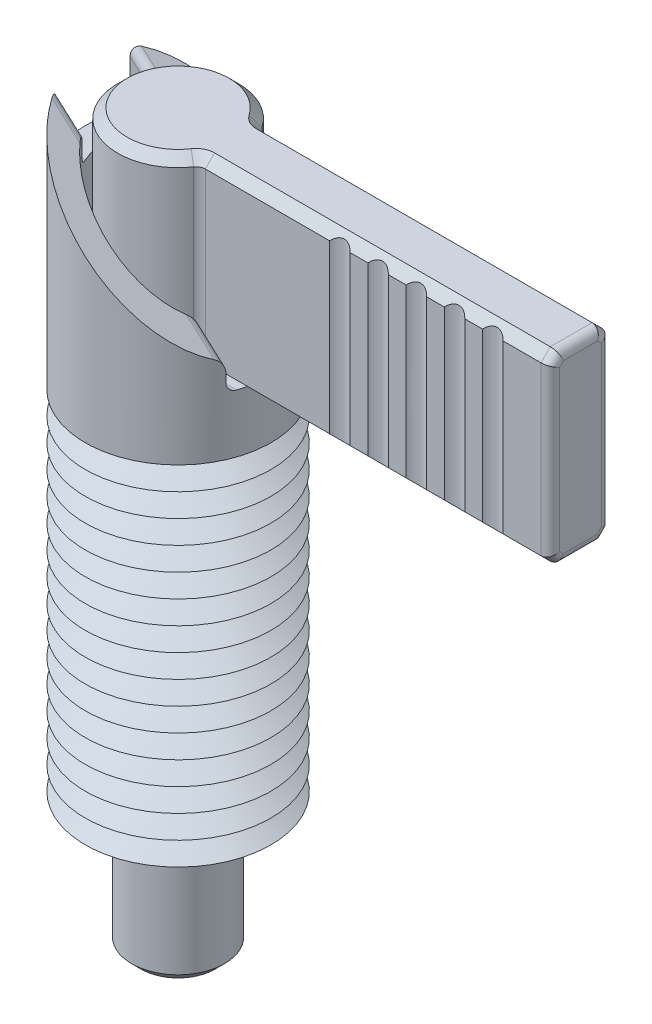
ISO-10303-21;
HEADER;
FILE_DESCRIPTION(('STEP AP214'),'2;1');
FILE_NAME('part.step','',(''),(''),'','','');
FILE_SCHEMA(('AUTOMOTIVE_DESIGN { 1 0 10303 214 1 1 1 1 }'));
ENDSEC;
DATA;
#1=APPLICATION_CONTEXT('core data for automotive mechanical design processes');
#2=APPLICATION_PROTOCOL_DEFINITION('international standard','automotive_design',2000,#1);
#3=PRODUCT_CONTEXT('',#1,'mechanical');
#4=PRODUCT('Part','Part','',(#3));
#5=PRODUCT_RELATED_PRODUCT_CATEGORY('part','',(#4));
#6=PRODUCT_DEFINITION_FORMATION('','',#4);
#7=PRODUCT_DEFINITION_CONTEXT('part definition',#1,'design');
#8=PRODUCT_DEFINITION('design','',#6,#7);
#9=PRODUCT_DEFINITION_SHAPE('','',#8);
#10=(LENGTH_UNIT() NAMED_UNIT(*) SI_UNIT(.MILLI.,.METRE.));
#11=(NAMED_UNIT(*) PLANE_ANGLE_UNIT() SI_UNIT($,.RADIAN.));
#12=(NAMED_UNIT(*) SI_UNIT($,.STERADIAN.) SOLID_ANGLE_UNIT());
#13=UNCERTAINTY_MEASURE_WITH_UNIT(LENGTH_MEASURE(1.E-05),#10,'distance_accuracy_value','');
#14=(GEOMETRIC_REPRESENTATION_CONTEXT(3) GLOBAL_UNCERTAINTY_ASSIGNED_CONTEXT((#13)) GLOBAL_UNIT_ASSIGNED_CONTEXT((#10,
#11,#12)) REPRESENTATION_CONTEXT('',''));
#15=CARTESIAN_POINT('',(0.,0.,0.));
#16=DIRECTION('',(0.,0.,1.));
#17=DIRECTION('',(1.,0.,0.));
#18=AXIS2_PLACEMENT_3D('',#15,#16,#17);
#19=CARTESIAN_POINT('',(3.37749907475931,4.04379064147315,1.95));
#20=DIRECTION('',(0.,0.,1.));
#21=DIRECTION('',(1.,0.,0.));
#22=AXIS2_PLACEMENT_3D('',#19,#20,#21);
#23=PLANE('',#22);
#24=DIRECTION('',(0.,1.,0.));
#25=VECTOR('',#24,1.);
#26=CARTESIAN_POINT('',(13.0643624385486,-8.,1.95));
#27=LINE('',#26,#25);
#28=CARTESIAN_POINT('',(13.0643624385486,27.6006,1.95));
#29=VERTEX_POINT('',#28);
#30=CARTESIAN_POINT('',(13.0643624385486,38.3994,1.95));
#31=VERTEX_POINT('',#30);
#32=EDGE_CURVE('P0_E200',#29,#31,#27,.T.);
#33=ORIENTED_EDGE('',*,*,#32,.F.);
#34=DIRECTION('',(1.,0.,0.));
#35=VECTOR('',#34,1.);
#36=CARTESIAN_POINT('',(26.,27.6006,1.95));
#37=LINE('',#36,#35);
#38=CARTESIAN_POINT('',(14.2096375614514,27.6006,1.95));
#39=VERTEX_POINT('',#38);
#40=EDGE_CURVE('P0_E209',#29,#39,#37,.T.);
#41=ORIENTED_EDGE('',*,*,#40,.T.);
#42=DIRECTION('',(0.,1.,0.));
#43=VECTOR('',#42,1.);
#44=CARTESIAN_POINT('',(14.2096375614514,-8.,1.95));
#45=LINE('',#44,#43);
#46=CARTESIAN_POINT('',(14.2096375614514,38.3994,1.95));
#47=VERTEX_POINT('',#46);
#48=EDGE_CURVE('P0_E210',#39,#47,#45,.T.);
#49=ORIENTED_EDGE('',*,*,#48,.T.);
#50=DIRECTION('',(-1.,0.,0.));
#51=VECTOR('',#50,1.);
#52=CARTESIAN_POINT('',(3.70807766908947,38.3994,1.95));
#53=LINE('',#52,#51);
#54=EDGE_CURVE('P0_E236',#47,#31,#53,.T.);
#55=ORIENTED_EDGE('',*,*,#54,.T.);
#56=EDGE_LOOP('',(#33,#41,#49,#55));
#57=FACE_BOUND('',#56,.T.);
#58=ADVANCED_FACE('P0_F16',(#57),#23,.T.);
#59=DIRECTION('',(0.,1.,0.));
#60=VECTOR('',#59,1.);
#61=CARTESIAN_POINT('',(15.5343624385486,-8.,1.95));
#62=LINE('',#61,#60);
#63=CARTESIAN_POINT('',(15.5343624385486,27.6006,1.95));
#64=VERTEX_POINT('',#63);
#65=CARTESIAN_POINT('',(15.5343624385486,38.3994,1.95));
#66=VERTEX_POINT('',#65);
#67=EDGE_CURVE('P0_E299',#64,#66,#62,.T.);
#68=ORIENTED_EDGE('',*,*,#67,.F.);
#69=CARTESIAN_POINT('',(16.6796375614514,27.6006,1.95));
#70=VERTEX_POINT('',#69);
#71=EDGE_CURVE('P0_E221',#64,#70,#37,.T.);
#72=ORIENTED_EDGE('',*,*,#71,.T.);
#73=DIRECTION('',(0.,1.,0.));
#74=VECTOR('',#73,1.);
#75=CARTESIAN_POINT('',(16.6796375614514,-8.,1.95));
#76=LINE('',#75,#74);
#77=CARTESIAN_POINT('',(16.6796375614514,38.3994,1.95));
#78=VERTEX_POINT('',#77);
#79=EDGE_CURVE('P0_E293',#70,#78,#76,.T.);
#80=ORIENTED_EDGE('',*,*,#79,.T.);
#81=EDGE_CURVE('P0_E239',#78,#66,#53,.T.);
#82=ORIENTED_EDGE('',*,*,#81,.T.);
#83=EDGE_LOOP('',(#68,#72,#80,#82));
#84=FACE_BOUND('',#83,.T.);
#85=ADVANCED_FACE('P0_F496',(#84),#23,.T.);
#86=DIRECTION('',(0.,1.,0.));
#87=VECTOR('',#86,1.);
#88=CARTESIAN_POINT('',(18.0043624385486,-8.,1.95));
#89=LINE('',#88,#87);
#90=CARTESIAN_POINT('',(18.0043624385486,27.6006,1.95));
#91=VERTEX_POINT('',#90);
#92=CARTESIAN_POINT('',(18.0043624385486,38.3994,1.95));
#93=VERTEX_POINT('',#92);
#94=EDGE_CURVE('P0_E292',#91,#93,#89,.T.);
#95=ORIENTED_EDGE('',*,*,#94,.F.);
#96=CARTESIAN_POINT('',(19.1496375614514,27.6006,1.95));
#97=VERTEX_POINT('',#96);
#98=EDGE_CURVE('P0_E228',#91,#97,#37,.T.);
#99=ORIENTED_EDGE('',*,*,#98,.T.);
#100=DIRECTION('',(0.,1.,0.));
#101=VECTOR('',#100,1.);
#102=CARTESIAN_POINT('',(19.1496375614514,-8.,1.95));
#103=LINE('',#102,#101);
#104=CARTESIAN_POINT('',(19.1496375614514,38.3994,1.95));
#105=VERTEX_POINT('',#104);
#106=EDGE_CURVE('P0_E286',#97,#105,#103,.T.);
#107=ORIENTED_EDGE('',*,*,#106,.T.);
#108=EDGE_CURVE('P0_E234',#105,#93,#53,.T.);
#109=ORIENTED_EDGE('',*,*,#108,.T.);
#110=EDGE_LOOP('',(#95,#99,#107,#109));
#111=FACE_BOUND('',#110,.T.);
#112=ADVANCED_FACE('P0_F324',(#111),#23,.T.);
#113=DIRECTION('',(0.,1.,0.));
#114=VECTOR('',#113,1.);
#115=CARTESIAN_POINT('',(20.4743624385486,-8.,1.95));
#116=LINE('',#115,#114);
#117=CARTESIAN_POINT('',(20.4743624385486,27.6006,1.95));
#118=VERTEX_POINT('',#117);
#119=CARTESIAN_POINT('',(20.4743624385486,38.3994,1.95));
#120=VERTEX_POINT('',#119);
#121=EDGE_CURVE('P0_E285',#118,#120,#116,.T.);
#122=ORIENTED_EDGE('',*,*,#121,.F.);
#123=CARTESIAN_POINT('',(21.6196375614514,27.6006,1.95));
#124=VERTEX_POINT('',#123);
#125=EDGE_CURVE('P0_E223',#118,#124,#37,.T.);
#126=ORIENTED_EDGE('',*,*,#125,.T.);
#127=DIRECTION('',(0.,1.,0.));
#128=VECTOR('',#127,1.);
#129=CARTESIAN_POINT('',(21.6196375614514,-8.,1.95));
#130=LINE('',#129,#128);
#131=CARTESIAN_POINT('',(21.6196375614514,38.3994,1.95));
#132=VERTEX_POINT('',#131);
#133=EDGE_CURVE('P0_E279',#124,#132,#130,.T.);
#134=ORIENTED_EDGE('',*,*,#133,.T.);
#135=EDGE_CURVE('P0_E229',#132,#120,#53,.T.);
#136=ORIENTED_EDGE('',*,*,#135,.T.);
#137=EDGE_LOOP('',(#122,#126,#134,#136));
#138=FACE_BOUND('',#137,.T.);
#139=ADVANCED_FACE('P0_F337',(#138),#23,.T.);
#140=CARTESIAN_POINT('',(22.9443624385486,27.6006,1.95));
#141=VERTEX_POINT('',#140);
#142=CARTESIAN_POINT('',(25.3994,27.6006,1.95));
#143=VERTEX_POINT('',#142);
#144=EDGE_CURVE('P0_E218',#141,#143,#37,.T.);
#145=ORIENTED_EDGE('',*,*,#144,.T.);
#146=DIRECTION('',(0.,1.,0.));
#147=VECTOR('',#146,1.);
#148=CARTESIAN_POINT('',(25.3994,4.04379064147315,1.95));
#149=LINE('',#148,#147);
#150=CARTESIAN_POINT('',(25.3994,38.3994,1.95));
#151=VERTEX_POINT('',#150);
#152=EDGE_CURVE('P0_E11',#143,#151,#149,.T.);
#153=ORIENTED_EDGE('',*,*,#152,.T.);
#154=CARTESIAN_POINT('',(22.9443624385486,38.3994,1.95));
#155=VERTEX_POINT('',#154);
#156=EDGE_CURVE('P0_E224',#151,#155,#53,.T.);
#157=ORIENTED_EDGE('',*,*,#156,.T.);
#158=DIRECTION('',(0.,1.,0.));
#159=VECTOR('',#158,1.);
#160=CARTESIAN_POINT('',(22.9443624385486,-8.,1.95));
#161=LINE('',#160,#159);
#162=EDGE_CURVE('P0_E278',#141,#155,#161,.T.);
#163=ORIENTED_EDGE('',*,*,#162,.F.);
#164=EDGE_LOOP('',(#145,#153,#157,#163));
#165=FACE_BOUND('',#164,.T.);
#166=ADVANCED_FACE('P0_F506',(#165),#23,.T.);
#167=CARTESIAN_POINT('',(0.,-8.,0.));
#168=DIRECTION('',(0.,1.,0.));
#169=DIRECTION('',(0.,0.,1.));
#170=AXIS2_PLACEMENT_3D('',#167,#168,#169);
#171=PLANE('',#170);
#172=CARTESIAN_POINT('',(0.,-8.,0.));
#173=DIRECTION('',(0.,-1.,0.));
#174=DIRECTION('',(0.,0.,-1.));
#175=AXIS2_PLACEMENT_3D('',#172,#173,#174);
#176=CIRCLE('',#175,2.4);
#177=CARTESIAN_POINT('',(0.,-8.,-2.4));
#178=VERTEX_POINT('',#177);
#179=EDGE_CURVE('P0_E259',#178,#178,#176,.T.);
#180=ORIENTED_EDGE('',*,*,#179,.T.);
#181=EDGE_LOOP('',(#180));
#182=FACE_BOUND('',#181,.T.);
#183=ADVANCED_FACE('P0_F516',(#182),#171,.F.);
#184=CARTESIAN_POINT('',(0.,-7.4,0.));
#185=DIRECTION('',(0.,1.,0.));
#186=DIRECTION('',(0.,0.,1.));
#187=AXIS2_PLACEMENT_3D('',#184,#185,#186);
#188=CONICAL_SURFACE('',#187,3.,0.785398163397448);
#189=ORIENTED_EDGE('',*,*,#179,.F.);
#190=EDGE_LOOP('',(#189));
#191=FACE_BOUND('',#190,.T.);
#192=CARTESIAN_POINT('',(0.,-7.4,0.));
#193=DIRECTION('',(0.,-1.,0.));
#194=DIRECTION('',(0.,0.,-1.));
#195=AXIS2_PLACEMENT_3D('',#192,#193,#194);
#196=CIRCLE('',#195,3.);
#197=CARTESIAN_POINT('',(0.,-7.4,-3.));
#198=VERTEX_POINT('',#197);
#199=EDGE_CURVE('P0_E262',#198,#198,#196,.T.);
#200=ORIENTED_EDGE('',*,*,#199,.T.);
#201=EDGE_LOOP('',(#200));
#202=FACE_BOUND('',#201,.T.);
#203=ADVANCED_FACE('P0_F521',(#191,#202),#188,.T.);
#204=CARTESIAN_POINT('',(0.,-8.,0.));
#205=DIRECTION('',(0.,-1.,0.));
#206=DIRECTION('',(0.,0.,-1.));
#207=AXIS2_PLACEMENT_3D('',#204,#205,#206);
#208=CYLINDRICAL_SURFACE('',#207,3.);
#209=ORIENTED_EDGE('',*,*,#199,.F.);
#210=EDGE_LOOP('',(#209));
#211=FACE_BOUND('',#210,.T.);
#212=CARTESIAN_POINT('',(0.,6.5,0.));
#213=DIRECTION('',(0.,-1.,0.));
#214=DIRECTION('',(0.,0.,-1.));
#215=AXIS2_PLACEMENT_3D('',#212,#213,#214);
#216=CIRCLE('',#215,3.);
#217=CARTESIAN_POINT('',(0.,6.5,-3.));
#218=VERTEX_POINT('',#217);
#219=EDGE_CURVE('P0_E265',#218,#218,#216,.T.);
#220=ORIENTED_EDGE('',*,*,#219,.T.);
#221=EDGE_LOOP('',(#220));
#222=FACE_BOUND('',#221,.T.);
#223=ADVANCED_FACE('P0_F555',(#211,#222),#208,.T.);
#224=CARTESIAN_POINT('',(-3.,6.5,0.));
#225=DIRECTION('',(0.,-1.,0.));
#226=DIRECTION('',(0.,0.,-1.));
#227=AXIS2_PLACEMENT_3D('',#224,#225,#226);
#228=PLANE('',#227);
#229=ORIENTED_EDGE('',*,*,#219,.F.);
#230=EDGE_LOOP('',(#229));
#231=FACE_BOUND('',#230,.T.);
#232=CARTESIAN_POINT('',(0.,6.5,0.));
#233=DIRECTION('',(0.,-1.,0.));
#234=DIRECTION('',(0.,0.,-1.));
#235=AXIS2_PLACEMENT_3D('',#232,#233,#234);
#236=CIRCLE('',#235,2.25);
#237=CARTESIAN_POINT('',(0.,6.5,-2.25));
#238=VERTEX_POINT('',#237);
#239=EDGE_CURVE('P0_E268',#238,#238,#236,.T.);
#240=ORIENTED_EDGE('',*,*,#239,.T.);
#241=EDGE_LOOP('',(#240));
#242=FACE_BOUND('',#241,.T.);
#243=ADVANCED_FACE('P0_F563',(#231,#242),#228,.F.);
#244=CARTESIAN_POINT('',(0.,-8.,0.));
#245=DIRECTION('',(0.,-1.,0.));
#246=DIRECTION('',(0.,0.,-1.));
#247=AXIS2_PLACEMENT_3D('',#244,#245,#246);
#248=CYLINDRICAL_SURFACE('',#247,2.25);
#249=ORIENTED_EDGE('',*,*,#239,.F.);
#250=EDGE_LOOP('',(#249));
#251=FACE_BOUND('',#250,.T.);
#252=CARTESIAN_POINT('',(0.,27.,0.));
#253=DIRECTION('',(0.,-1.,0.));
#254=DIRECTION('',(0.,0.,-1.));
#255=AXIS2_PLACEMENT_3D('',#252,#253,#254);
#256=CIRCLE('',#255,2.25);
#257=CARTESIAN_POINT('',(0.,27.,-2.25));
#258=VERTEX_POINT('',#257);
#259=EDGE_CURVE('P0_E271',#258,#258,#256,.T.);
#260=ORIENTED_EDGE('',*,*,#259,.T.);
#261=EDGE_LOOP('',(#260));
#262=FACE_BOUND('',#261,.T.);
#263=ADVANCED_FACE('P0_F571',(#251,#262),#248,.T.);
#264=CARTESIAN_POINT('',(-2.25,27.,0.));
#265=DIRECTION('',(0.,1.,0.));
#266=DIRECTION('',(0.,0.,1.));
#267=AXIS2_PLACEMENT_3D('',#264,#265,#266);
#268=PLANE('',#267);
#269=ORIENTED_EDGE('',*,*,#259,.F.);
#270=EDGE_LOOP('',(#269));
#271=FACE_BOUND('',#270,.T.);
#272=DIRECTION('',(1.,0.,0.));
#273=VECTOR('',#272,1.);
#274=CARTESIAN_POINT('',(26.,27.,-1.34940000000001));
#275=LINE('',#274,#273);
#276=CARTESIAN_POINT('',(3.70807766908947,27.,-1.34940000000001));
#277=VERTEX_POINT('',#276);
#278=CARTESIAN_POINT('',(25.3994,27.,-1.34940000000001));
#279=VERTEX_POINT('',#278);
#280=EDGE_CURVE('P0_E247',#277,#279,#275,.T.);
#281=ORIENTED_EDGE('',*,*,#280,.T.);
#282=DIRECTION('',(0.,0.,1.));
#283=VECTOR('',#282,1.);
#284=CARTESIAN_POINT('',(25.3994,27.,1.34940000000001));
#285=LINE('',#284,#283);
#286=CARTESIAN_POINT('',(25.3994,27.,1.34940000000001));
#287=VERTEX_POINT('',#286);
#288=EDGE_CURVE('P0_E40',#279,#287,#285,.T.);
#289=ORIENTED_EDGE('',*,*,#288,.T.);
#290=DIRECTION('',(-1.,0.,0.));
#291=VECTOR('',#290,1.);
#292=CARTESIAN_POINT('',(3.70807766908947,27.,1.34940000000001));
#293=LINE('',#292,#291);
#294=CARTESIAN_POINT('',(3.70807766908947,27.,1.34940000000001));
#295=VERTEX_POINT('',#294);
#296=EDGE_CURVE('P0_E237',#287,#295,#293,.T.);
#297=ORIENTED_EDGE('',*,*,#296,.T.);
#298=CARTESIAN_POINT('',(3.70807766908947,27.,2.5506));
#299=DIRECTION('',(0.,1.,0.));
#300=DIRECTION('',(0.,0.,1.));
#301=AXIS2_PLACEMENT_3D('',#298,#299,#300);
#302=CIRCLE('',#301,1.20119999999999);
#303=CARTESIAN_POINT('',(2.71840009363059,27.,1.8698506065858));
#304=VERTEX_POINT('',#303);
#305=EDGE_CURVE('P0_E240',#295,#304,#302,.T.);
#306=ORIENTED_EDGE('',*,*,#305,.T.);
#307=CARTESIAN_POINT('',(0.,27.,0.));
#308=DIRECTION('',(0.,1.,0.));
#309=DIRECTION('',(0.,0.,1.));
#310=AXIS2_PLACEMENT_3D('',#307,#308,#309);
#311=CIRCLE('',#310,3.29940000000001);
#312=CARTESIAN_POINT('',(2.71840009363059,27.,-1.8698506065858));
#313=VERTEX_POINT('',#312);
#314=EDGE_CURVE('P0_E241',#304,#313,#311,.F.);
#315=ORIENTED_EDGE('',*,*,#314,.T.);
#316=CARTESIAN_POINT('',(3.70807766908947,27.,-2.5506));
#317=DIRECTION('',(0.,1.,0.));
#318=DIRECTION('',(0.,0.,1.));
#319=AXIS2_PLACEMENT_3D('',#316,#317,#318);
#320=CIRCLE('',#319,1.20119999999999);
#321=EDGE_CURVE('P0_E245',#313,#277,#320,.T.);
#322=ORIENTED_EDGE('',*,*,#321,.T.);
#323=EDGE_LOOP('',(#281,#289,#297,#306,#315,#322));
#324=FACE_BOUND('',#323,.T.);
#325=ADVANCED_FACE('P0_F422',(#271,#324),#268,.F.);
#326=CARTESIAN_POINT('',(0.,-8.,0.));
#327=DIRECTION('',(0.,-1.,0.));
#328=DIRECTION('',(0.,0.,-1.));
#329=AXIS2_PLACEMENT_3D('',#326,#327,#328);
#330=CYLINDRICAL_SURFACE('',#329,3.9);
#331=DIRECTION('',(0.,-1.,0.));
#332=VECTOR('',#331,1.);
#333=CARTESIAN_POINT('',(3.21323888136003,-8.,-2.21022530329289));
#334=LINE('',#333,#332);
#335=CARTESIAN_POINT('',(3.21323888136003,38.3994,-2.21022530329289));
#336=VERTEX_POINT('',#335);
#337=CARTESIAN_POINT('',(3.21323888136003,27.6006,-2.21022530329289));
#338=VERTEX_POINT('',#337);
#339=EDGE_CURVE('P0_E250',#336,#338,#334,.T.);
#340=ORIENTED_EDGE('',*,*,#339,.T.);
#341=CARTESIAN_POINT('',(0.,27.6006,0.));
#342=DIRECTION('',(0.,1.,0.));
#343=DIRECTION('',(0.,0.,1.));
#344=AXIS2_PLACEMENT_3D('',#341,#342,#343);
#345=CIRCLE('',#344,3.9);
#346=CARTESIAN_POINT('',(3.21323888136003,27.6006,2.21022530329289));
#347=VERTEX_POINT('',#346);
#348=EDGE_CURVE('P0_E436',#338,#347,#345,.T.);
#349=ORIENTED_EDGE('',*,*,#348,.T.);
#350=DIRECTION('',(0.,-1.,0.));
#351=VECTOR('',#350,1.);
#352=CARTESIAN_POINT('',(3.21323888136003,-8.,2.21022530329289));
#353=LINE('',#352,#351);
#354=CARTESIAN_POINT('',(3.21323888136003,38.3994,2.21022530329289));
#355=VERTEX_POINT('',#354);
#356=EDGE_CURVE('P0_E253',#347,#355,#353,.F.);
#357=ORIENTED_EDGE('',*,*,#356,.T.);
#358=CARTESIAN_POINT('',(0.,38.3994,0.));
#359=DIRECTION('',(0.,-1.,0.));
#360=DIRECTION('',(0.,0.,-1.));
#361=AXIS2_PLACEMENT_3D('',#358,#359,#360);
#362=CIRCLE('',#361,3.9);
#363=EDGE_CURVE('P0_E476',#355,#336,#362,.T.);
#364=ORIENTED_EDGE('',*,*,#363,.T.);
#365=EDGE_LOOP('',(#340,#349,#357,#364));
#366=FACE_BOUND('',#365,.T.);
#367=ADVANCED_FACE('P0_F586',(#366),#330,.T.);
#368=CARTESIAN_POINT('',(-3.9,39.,0.));
#369=DIRECTION('',(0.,-1.,0.));
#370=DIRECTION('',(0.,0.,-1.));
#371=AXIS2_PLACEMENT_3D('',#368,#369,#370);
#372=PLANE('',#371);
#373=DIRECTION('',(1.,0.,0.));
#374=VECTOR('',#373,1.);
#375=CARTESIAN_POINT('',(26.,39.,1.34940000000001));
#376=LINE('',#375,#374);
#377=CARTESIAN_POINT('',(3.70807766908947,39.,1.34940000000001));
#378=VERTEX_POINT('',#377);
#379=CARTESIAN_POINT('',(25.3994,39.,1.34940000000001));
#380=VERTEX_POINT('',#379);
#381=EDGE_CURVE('P0_E343',#378,#380,#376,.T.);
#382=ORIENTED_EDGE('',*,*,#381,.T.);
#383=DIRECTION('',(0.,0.,-1.));
#384=VECTOR('',#383,1.);
#385=CARTESIAN_POINT('',(25.3994,39.,-1.3494));
#386=LINE('',#385,#384);
#387=CARTESIAN_POINT('',(25.3994,39.,-1.34940000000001));
#388=VERTEX_POINT('',#387);
#389=EDGE_CURVE('P0_E375',#380,#388,#386,.T.);
#390=ORIENTED_EDGE('',*,*,#389,.T.);
#391=DIRECTION('',(-1.,0.,0.));
#392=VECTOR('',#391,1.);
#393=CARTESIAN_POINT('',(3.70807766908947,39.,-1.34940000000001));
#394=LINE('',#393,#392);
#395=CARTESIAN_POINT('',(3.70807766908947,39.,-1.34940000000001));
#396=VERTEX_POINT('',#395);
#397=EDGE_CURVE('P0_E465',#388,#396,#394,.T.);
#398=ORIENTED_EDGE('',*,*,#397,.T.);
#399=CARTESIAN_POINT('',(3.70807766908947,39.,-2.5506));
#400=DIRECTION('',(0.,-1.,0.));
#401=DIRECTION('',(0.,0.,-1.));
#402=AXIS2_PLACEMENT_3D('',#399,#400,#401);
#403=CIRCLE('',#402,1.20119999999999);
#404=CARTESIAN_POINT('',(2.71840009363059,39.,-1.86985060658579));
#405=VERTEX_POINT('',#404);
#406=EDGE_CURVE('P0_E463',#396,#405,#403,.T.);
#407=ORIENTED_EDGE('',*,*,#406,.T.);
#408=CARTESIAN_POINT('',(0.,39.,0.));
#409=DIRECTION('',(0.,-1.,0.));
#410=DIRECTION('',(0.,0.,-1.));
#411=AXIS2_PLACEMENT_3D('',#408,#409,#410);
#412=CIRCLE('',#411,3.29940000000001);
#413=CARTESIAN_POINT('',(2.71840009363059,39.,1.86985060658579));
#414=VERTEX_POINT('',#413);
#415=EDGE_CURVE('P0_E461',#405,#414,#412,.F.);
#416=ORIENTED_EDGE('',*,*,#415,.T.);
#417=CARTESIAN_POINT('',(3.70807766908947,39.,2.5506));
#418=DIRECTION('',(0.,-1.,0.));
#419=DIRECTION('',(0.,0.,-1.));
#420=AXIS2_PLACEMENT_3D('',#417,#418,#419);
#421=CIRCLE('',#420,1.20119999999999);
#422=EDGE_CURVE('P0_E348',#414,#378,#421,.T.);
#423=ORIENTED_EDGE('',*,*,#422,.T.);
#424=EDGE_LOOP('',(#382,#390,#398,#407,#416,#423));
#425=FACE_BOUND('',#424,.T.);
#426=ADVANCED_FACE('P0_F594',(#425),#372,.F.);
#427=CARTESIAN_POINT('',(3.37749907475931,4.04379064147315,-1.95));
#428=DIRECTION('',(0.,0.,-1.));
#429=DIRECTION('',(-1.,0.,0.));
#430=AXIS2_PLACEMENT_3D('',#427,#428,#429);
#431=PLANE('',#430);
#432=DIRECTION('',(1.,0.,0.));
#433=VECTOR('',#432,1.);
#434=CARTESIAN_POINT('',(26.,38.3994,-1.95));
#435=LINE('',#434,#433);
#436=CARTESIAN_POINT('',(3.70807766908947,38.3994,-1.95));
#437=VERTEX_POINT('',#436);
#438=CARTESIAN_POINT('',(25.3994,38.3994,-1.95));
#439=VERTEX_POINT('',#438);
#440=EDGE_CURVE('P0_E468',#437,#439,#435,.T.);
#441=ORIENTED_EDGE('',*,*,#440,.T.);
#442=DIRECTION('',(0.,1.,0.));
#443=VECTOR('',#442,1.);
#444=CARTESIAN_POINT('',(25.3994,4.04379064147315,-1.95));
#445=LINE('',#444,#443);
#446=CARTESIAN_POINT('',(25.3994,27.6006,-1.95));
#447=VERTEX_POINT('',#446);
#448=EDGE_CURVE('P0_E379',#439,#447,#445,.F.);
#449=ORIENTED_EDGE('',*,*,#448,.T.);
#450=DIRECTION('',(-1.,0.,0.));
#451=VECTOR('',#450,1.);
#452=CARTESIAN_POINT('',(3.70807766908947,27.6006,-1.95));
#453=LINE('',#452,#451);
#454=CARTESIAN_POINT('',(3.70807766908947,27.6006,-1.95));
#455=VERTEX_POINT('',#454);
#456=EDGE_CURVE('P0_E421',#447,#455,#453,.T.);
#457=ORIENTED_EDGE('',*,*,#456,.T.);
#458=DIRECTION('',(0.,-1.,0.));
#459=VECTOR('',#458,1.);
#460=CARTESIAN_POINT('',(3.70807766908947,4.04379064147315,-1.95));
#461=LINE('',#460,#459);
#462=EDGE_CURVE('P0_E256',#455,#437,#461,.F.);
#463=ORIENTED_EDGE('',*,*,#462,.T.);
#464=EDGE_LOOP('',(#441,#449,#457,#463));
#465=FACE_BOUND('',#464,.T.);
#466=ADVANCED_FACE('P0_F513',(#465),#431,.T.);
#467=CARTESIAN_POINT('',(26.,4.04379064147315,1.95));
#468=DIRECTION('',(1.,0.,0.));
#469=DIRECTION('',(0.,0.,-1.));
#470=AXIS2_PLACEMENT_3D('',#467,#468,#469);
#471=PLANE('',#470);
#472=DIRECTION('',(0.,0.,-1.));
#473=VECTOR('',#472,1.);
#474=CARTESIAN_POINT('',(26.,38.3994,1.3494));
#475=LINE('',#474,#473);
#476=CARTESIAN_POINT('',(26.,38.3994,-1.10062333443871));
#477=VERTEX_POINT('',#476);
#478=CARTESIAN_POINT('',(26.,38.3994,1.10062333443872));
#479=VERTEX_POINT('',#478);
#480=EDGE_CURVE('P0_E367',#477,#479,#475,.F.);
#481=ORIENTED_EDGE('',*,*,#480,.T.);
#482=DIRECTION('',(0.,-0.707106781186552,0.707106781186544));
#483=VECTOR('',#482,1.);
#484=CARTESIAN_POINT('',(26.,20.7969069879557,18.7031163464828));
#485=LINE('',#484,#483);
#486=CARTESIAN_POINT('',(26.,38.1506233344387,1.3494));
#487=VERTEX_POINT('',#486);
#488=EDGE_CURVE('P0_E369',#479,#487,#485,.T.);
#489=ORIENTED_EDGE('',*,*,#488,.T.);
#490=DIRECTION('',(0.,1.,0.));
#491=VECTOR('',#490,1.);
#492=CARTESIAN_POINT('',(26.,4.04379064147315,1.3494));
#493=LINE('',#492,#491);
#494=CARTESIAN_POINT('',(26.,27.8493766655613,1.3494));
#495=VERTEX_POINT('',#494);
#496=EDGE_CURVE('P0_E309',#487,#495,#493,.F.);
#497=ORIENTED_EDGE('',*,*,#496,.T.);
#498=DIRECTION('',(0.,-0.707106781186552,-0.707106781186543));
#499=VECTOR('',#498,1.);
#500=CARTESIAN_POINT('',(26.,16.2468836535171,-10.2530930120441));
#501=LINE('',#500,#499);
#502=CARTESIAN_POINT('',(26.,27.6006,1.10062333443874));
#503=VERTEX_POINT('',#502);
#504=EDGE_CURVE('P0_E357',#495,#503,#501,.T.);
#505=ORIENTED_EDGE('',*,*,#504,.T.);
#506=DIRECTION('',(0.,0.,1.));
#507=VECTOR('',#506,1.);
#508=CARTESIAN_POINT('',(26.,27.6006,-1.34940000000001));
#509=LINE('',#508,#507);
#510=CARTESIAN_POINT('',(26.,27.6006,-1.10062333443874));
#511=VERTEX_POINT('',#510);
#512=EDGE_CURVE('P0_E359',#503,#511,#509,.F.);
#513=ORIENTED_EDGE('',*,*,#512,.T.);
#514=DIRECTION('',(0.,0.707106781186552,-0.707106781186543));
#515=VECTOR('',#514,1.);
#516=CARTESIAN_POINT('',(26.,14.2968836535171,12.203093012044));
#517=LINE('',#516,#515);
#518=CARTESIAN_POINT('',(26.,27.8493766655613,-1.3494));
#519=VERTEX_POINT('',#518);
#520=EDGE_CURVE('P0_E361',#511,#519,#517,.T.);
#521=ORIENTED_EDGE('',*,*,#520,.T.);
#522=DIRECTION('',(0.,1.,0.));
#523=VECTOR('',#522,1.);
#524=CARTESIAN_POINT('',(26.,4.04379064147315,-1.3494));
#525=LINE('',#524,#523);
#526=CARTESIAN_POINT('',(26.,38.1506233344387,-1.3494));
#527=VERTEX_POINT('',#526);
#528=EDGE_CURVE('P0_E363',#519,#527,#525,.T.);
#529=ORIENTED_EDGE('',*,*,#528,.T.);
#530=DIRECTION('',(0.,0.707106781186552,0.707106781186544));
#531=VECTOR('',#530,1.);
#532=CARTESIAN_POINT('',(26.,22.7469069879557,-16.7531163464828));
#533=LINE('',#532,#531);
#534=EDGE_CURVE('P0_E365',#527,#477,#533,.T.);
#535=ORIENTED_EDGE('',*,*,#534,.T.);
#536=EDGE_LOOP('',(#481,#489,#497,#505,#513,#521,#529,#535));
#537=FACE_BOUND('',#536,.T.);
#538=ADVANCED_FACE('P0_F505',(#537),#471,.T.);
#539=DIRECTION('',(0.,1.,0.));
#540=VECTOR('',#539,1.);
#541=CARTESIAN_POINT('',(11.7396375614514,-8.,1.95));
#542=LINE('',#541,#540);
#543=CARTESIAN_POINT('',(11.7396375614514,27.6006,1.95));
#544=VERTEX_POINT('',#543);
#545=CARTESIAN_POINT('',(11.7396375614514,38.3994,1.95));
#546=VERTEX_POINT('',#545);
#547=EDGE_CURVE('P0_E190',#544,#546,#542,.T.);
#548=ORIENTED_EDGE('',*,*,#547,.T.);
#549=CARTESIAN_POINT('',(3.70807766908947,38.3994,1.95));
#550=VERTEX_POINT('',#549);
#551=EDGE_CURVE('P0_E230',#546,#550,#53,.T.);
#552=ORIENTED_EDGE('',*,*,#551,.T.);
#553=DIRECTION('',(0.,-1.,0.));
#554=VECTOR('',#553,1.);
#555=CARTESIAN_POINT('',(3.70807766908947,4.04379064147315,1.95));
#556=LINE('',#555,#554);
#557=CARTESIAN_POINT('',(3.70807766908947,27.6006,1.95));
#558=VERTEX_POINT('',#557);
#559=EDGE_CURVE('P0_E215',#550,#558,#556,.T.);
#560=ORIENTED_EDGE('',*,*,#559,.T.);
#561=EDGE_CURVE('P0_E206',#558,#544,#37,.T.);
#562=ORIENTED_EDGE('',*,*,#561,.T.);
#563=EDGE_LOOP('',(#548,#552,#560,#562));
#564=FACE_BOUND('',#563,.T.);
#565=ADVANCED_FACE('P0_F213',(#564),#23,.T.);
#566=CARTESIAN_POINT('',(3.70807766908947,-8.,-2.5506));
#567=DIRECTION('',(0.,-1.,0.));
#568=DIRECTION('',(0.,0.,-1.));
#569=AXIS2_PLACEMENT_3D('',#566,#567,#568);
#570=CYLINDRICAL_SURFACE('',#569,0.6006);
#571=ORIENTED_EDGE('',*,*,#462,.F.);
#572=CARTESIAN_POINT('',(3.70807766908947,27.6006,-2.5506));
#573=DIRECTION('',(0.,1.,0.));
#574=DIRECTION('',(0.,0.,1.));
#575=AXIS2_PLACEMENT_3D('',#572,#573,#574);
#576=CIRCLE('',#575,0.6006);
#577=EDGE_CURVE('P0_E471',#455,#338,#576,.F.);
#578=ORIENTED_EDGE('',*,*,#577,.T.);
#579=ORIENTED_EDGE('',*,*,#339,.F.);
#580=CARTESIAN_POINT('',(3.70807766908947,38.3994,-2.5506));
#581=DIRECTION('',(0.,-1.,0.));
#582=DIRECTION('',(0.,0.,-1.));
#583=AXIS2_PLACEMENT_3D('',#580,#581,#582);
#584=CIRCLE('',#583,0.6006);
#585=EDGE_CURVE('P0_E473',#336,#437,#584,.F.);
#586=ORIENTED_EDGE('',*,*,#585,.T.);
#587=EDGE_LOOP('',(#571,#578,#579,#586));
#588=FACE_BOUND('',#587,.T.);
#589=ADVANCED_FACE('P0_F504',(#588),#570,.F.);
#590=CARTESIAN_POINT('',(3.70807766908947,-8.,2.5506));
#591=DIRECTION('',(0.,-1.,0.));
#592=DIRECTION('',(0.,0.,-1.));
#593=AXIS2_PLACEMENT_3D('',#590,#591,#592);
#594=CYLINDRICAL_SURFACE('',#593,0.6006);
#595=ORIENTED_EDGE('',*,*,#356,.F.);
#596=CARTESIAN_POINT('',(3.70807766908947,27.6006,2.5506));
#597=DIRECTION('',(0.,1.,0.));
#598=DIRECTION('',(0.,0.,1.));
#599=AXIS2_PLACEMENT_3D('',#596,#597,#598);
#600=CIRCLE('',#599,0.6006);
#601=EDGE_CURVE('P0_E219',#347,#558,#600,.F.);
#602=ORIENTED_EDGE('',*,*,#601,.T.);
#603=ORIENTED_EDGE('',*,*,#559,.F.);
#604=CARTESIAN_POINT('',(3.70807766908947,38.3994,2.5506));
#605=DIRECTION('',(0.,-1.,0.));
#606=DIRECTION('',(0.,0.,-1.));
#607=AXIS2_PLACEMENT_3D('',#604,#605,#606);
#608=CIRCLE('',#607,0.6006);
#609=EDGE_CURVE('P0_E216',#550,#355,#608,.F.);
#610=ORIENTED_EDGE('',*,*,#609,.T.);
#611=EDGE_LOOP('',(#595,#602,#603,#610));
#612=FACE_BOUND('',#611,.T.);
#613=ADVANCED_FACE('P0_F481',(#612),#594,.F.);
#614=CARTESIAN_POINT('',(-2.25,27.,-1.34940000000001));
#615=DIRECTION('',(0.,-0.707106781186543,-0.707106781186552));
#616=DIRECTION('',(0.,0.707106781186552,-0.707106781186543));
#617=AXIS2_PLACEMENT_3D('',#614,#615,#616);
#618=PLANE('',#617);
#619=ORIENTED_EDGE('',*,*,#456,.F.);
#620=DIRECTION('',(0.,0.707106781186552,-0.707106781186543));
#621=VECTOR('',#620,1.);
#622=CARTESIAN_POINT('',(25.3994,27.,-1.34940000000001));
#623=LINE('',#622,#621);
#624=EDGE_CURVE('P0_E381',#447,#279,#623,.F.);
#625=ORIENTED_EDGE('',*,*,#624,.T.);
#626=ORIENTED_EDGE('',*,*,#280,.F.);
#627=DIRECTION('',(0.,-0.707106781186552,0.707106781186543));
#628=VECTOR('',#627,1.);
#629=CARTESIAN_POINT('',(3.70807766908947,27.6006,-1.95));
#630=LINE('',#629,#628);
#631=EDGE_CURVE('P0_E274',#455,#277,#630,.T.);
#632=ORIENTED_EDGE('',*,*,#631,.F.);
#633=EDGE_LOOP('',(#619,#625,#626,#632));
#634=FACE_BOUND('',#633,.T.);
#635=ADVANCED_FACE('P0_F418',(#634),#618,.T.);
#636=CARTESIAN_POINT('',(3.70807766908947,27.,-2.5506));
#637=DIRECTION('',(0.,-1.,0.));
#638=DIRECTION('',(0.,0.,-1.));
#639=AXIS2_PLACEMENT_3D('',#636,#637,#638);
#640=CONICAL_SURFACE('',#639,1.20119999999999,0.785398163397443);
#641=ORIENTED_EDGE('',*,*,#631,.T.);
#642=ORIENTED_EDGE('',*,*,#321,.F.);
#643=DIRECTION('',(-0.582590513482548,-0.707106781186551,0.400734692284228));
#644=VECTOR('',#643,1.);
#645=CARTESIAN_POINT('',(3.21323888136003,27.6006,-2.21022530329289));
#646=LINE('',#645,#644);
#647=EDGE_CURVE('P0_E430',#338,#313,#646,.T.);
#648=ORIENTED_EDGE('',*,*,#647,.F.);
#649=ORIENTED_EDGE('',*,*,#577,.F.);
#650=EDGE_LOOP('',(#641,#642,#648,#649));
#651=FACE_BOUND('',#650,.T.);
#652=ADVANCED_FACE('P0_F428',(#651),#640,.F.);
#653=CARTESIAN_POINT('',(0.,27.,0.));
#654=DIRECTION('',(0.,1.,0.));
#655=DIRECTION('',(0.,0.,1.));
#656=AXIS2_PLACEMENT_3D('',#653,#654,#655);
#657=CONICAL_SURFACE('',#656,3.29940000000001,0.785398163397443);
#658=ORIENTED_EDGE('',*,*,#647,.T.);
#659=ORIENTED_EDGE('',*,*,#314,.F.);
#660=DIRECTION('',(-0.582590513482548,-0.707106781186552,-0.400734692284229));
#661=VECTOR('',#660,1.);
#662=CARTESIAN_POINT('',(3.21323888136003,27.6006,2.21022530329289));
#663=LINE('',#662,#661);
#664=EDGE_CURVE('P0_E437',#347,#304,#663,.T.);
#665=ORIENTED_EDGE('',*,*,#664,.F.);
#666=ORIENTED_EDGE('',*,*,#348,.F.);
#667=EDGE_LOOP('',(#658,#659,#665,#666));
#668=FACE_BOUND('',#667,.T.);
#669=ADVANCED_FACE('P0_F433',(#668),#657,.T.);
#670=CARTESIAN_POINT('',(3.70807766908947,27.,2.5506));
#671=DIRECTION('',(0.,-1.,0.));
#672=DIRECTION('',(0.,0.,-1.));
#673=AXIS2_PLACEMENT_3D('',#670,#671,#672);
#674=CONICAL_SURFACE('',#673,1.20119999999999,0.785398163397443);
#675=ORIENTED_EDGE('',*,*,#664,.T.);
#676=ORIENTED_EDGE('',*,*,#305,.F.);
#677=DIRECTION('',(0.,-0.707106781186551,-0.707106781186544));
#678=VECTOR('',#677,1.);
#679=CARTESIAN_POINT('',(3.70807766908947,27.6006,1.95));
#680=LINE('',#679,#678);
#681=EDGE_CURVE('P0_E440',#558,#295,#680,.T.);
#682=ORIENTED_EDGE('',*,*,#681,.F.);
#683=ORIENTED_EDGE('',*,*,#601,.F.);
#684=EDGE_LOOP('',(#675,#676,#682,#683));
#685=FACE_BOUND('',#684,.T.);
#686=ADVANCED_FACE('P0_F484',(#685),#674,.F.);
#687=CARTESIAN_POINT('',(-2.25,27.,1.34940000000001));
#688=DIRECTION('',(0.,-0.707106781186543,0.707106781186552));
#689=DIRECTION('',(0.,-0.707106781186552,-0.707106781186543));
#690=AXIS2_PLACEMENT_3D('',#687,#688,#689);
#691=PLANE('',#690);
#692=ORIENTED_EDGE('',*,*,#296,.F.);
#693=DIRECTION('',(0.,-0.707106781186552,-0.707106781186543));
#694=VECTOR('',#693,1.);
#695=CARTESIAN_POINT('',(25.3994,27.,1.34940000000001));
#696=LINE('',#695,#694);
#697=EDGE_CURVE('P0_E25',#287,#143,#696,.F.);
#698=ORIENTED_EDGE('',*,*,#697,.T.);
#699=ORIENTED_EDGE('',*,*,#144,.F.);
#700=CARTESIAN_POINT('',(22.282,28.2246,2.574));
#701=DIRECTION('',(0.,-0.707106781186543,0.707106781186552));
#702=DIRECTION('',(0.,0.707106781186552,0.707106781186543));
#703=AXIS2_PLACEMENT_3D('',#700,#701,#702);
#704=ELLIPSE('',#703,1.28693434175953,0.910000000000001);
#705=EDGE_CURVE('P0_E275',#124,#141,#704,.T.);
#706=ORIENTED_EDGE('',*,*,#705,.F.);
#707=ORIENTED_EDGE('',*,*,#125,.F.);
#708=CARTESIAN_POINT('',(19.812,28.2246,2.574));
#709=DIRECTION('',(0.,-0.707106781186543,0.707106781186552));
#710=DIRECTION('',(0.,0.707106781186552,0.707106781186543));
#711=AXIS2_PLACEMENT_3D('',#708,#709,#710);
#712=ELLIPSE('',#711,1.28693434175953,0.910000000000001);
#713=EDGE_CURVE('P0_E282',#97,#118,#712,.T.);
#714=ORIENTED_EDGE('',*,*,#713,.F.);
#715=ORIENTED_EDGE('',*,*,#98,.F.);
#716=CARTESIAN_POINT('',(17.342,28.2246,2.574));
#717=DIRECTION('',(0.,-0.707106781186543,0.707106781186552));
#718=DIRECTION('',(0.,0.707106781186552,0.707106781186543));
#719=AXIS2_PLACEMENT_3D('',#716,#717,#718);
#720=ELLIPSE('',#719,1.28693434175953,0.910000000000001);
#721=EDGE_CURVE('P0_E289',#70,#91,#720,.T.);
#722=ORIENTED_EDGE('',*,*,#721,.F.);
#723=ORIENTED_EDGE('',*,*,#71,.F.);
#724=CARTESIAN_POINT('',(14.872,28.2246,2.574));
#725=DIRECTION('',(0.,-0.707106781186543,0.707106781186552));
#726=DIRECTION('',(0.,0.707106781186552,0.707106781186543));
#727=AXIS2_PLACEMENT_3D('',#724,#725,#726);
#728=ELLIPSE('',#727,1.28693434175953,0.910000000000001);
#729=EDGE_CURVE('P0_E296',#39,#64,#728,.T.);
#730=ORIENTED_EDGE('',*,*,#729,.F.);
#731=ORIENTED_EDGE('',*,*,#40,.F.);
#732=CARTESIAN_POINT('',(12.402,28.2246,2.574));
#733=DIRECTION('',(0.,-0.707106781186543,0.707106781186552));
#734=DIRECTION('',(0.,0.707106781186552,0.707106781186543));
#735=AXIS2_PLACEMENT_3D('',#732,#733,#734);
#736=ELLIPSE('',#735,1.28693434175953,0.910000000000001);
#737=EDGE_CURVE('P0_E193',#544,#29,#736,.T.);
#738=ORIENTED_EDGE('',*,*,#737,.F.);
#739=ORIENTED_EDGE('',*,*,#561,.F.);
#740=ORIENTED_EDGE('',*,*,#681,.T.);
#741=EDGE_LOOP('',(#692,#698,#699,#706,#707,#714,#715,#722,#723,#730,#731,#738,#739,#740));
#742=FACE_BOUND('',#741,.T.);
#743=ADVANCED_FACE('P0_F204',(#742),#691,.T.);
#744=CARTESIAN_POINT('',(-3.9,39.,-1.34940000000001));
#745=DIRECTION('',(0.,0.707106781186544,-0.707106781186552));
#746=DIRECTION('',(0.,0.707106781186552,0.707106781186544));
#747=AXIS2_PLACEMENT_3D('',#744,#745,#746);
#748=PLANE('',#747);
#749=ORIENTED_EDGE('',*,*,#397,.F.);
#750=DIRECTION('',(0.,0.707106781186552,0.707106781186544));
#751=VECTOR('',#750,1.);
#752=CARTESIAN_POINT('',(25.3994,39.,-1.34940000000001));
#753=LINE('',#752,#751);
#754=EDGE_CURVE('P0_E377',#388,#439,#753,.F.);
#755=ORIENTED_EDGE('',*,*,#754,.T.);
#756=ORIENTED_EDGE('',*,*,#440,.F.);
#757=DIRECTION('',(0.,-0.707106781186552,-0.707106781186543));
#758=VECTOR('',#757,1.);
#759=CARTESIAN_POINT('',(3.70807766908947,39.,-1.34940000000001));
#760=LINE('',#759,#758);
#761=EDGE_CURVE('P0_E351',#396,#437,#760,.T.);
#762=ORIENTED_EDGE('',*,*,#761,.F.);
#763=EDGE_LOOP('',(#749,#755,#756,#762));
#764=FACE_BOUND('',#763,.T.);
#765=ADVANCED_FACE('P0_F492',(#764),#748,.T.);
#766=CARTESIAN_POINT('',(3.70807766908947,39.,-2.5506));
#767=DIRECTION('',(0.,1.,0.));
#768=DIRECTION('',(0.,0.,1.));
#769=AXIS2_PLACEMENT_3D('',#766,#767,#768);
#770=CONICAL_SURFACE('',#769,1.20119999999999,0.785398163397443);
#771=ORIENTED_EDGE('',*,*,#761,.T.);
#772=ORIENTED_EDGE('',*,*,#585,.F.);
#773=DIRECTION('',(0.582590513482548,-0.707106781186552,-0.400734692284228));
#774=VECTOR('',#773,1.);
#775=CARTESIAN_POINT('',(2.71840009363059,39.,-1.86985060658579));
#776=LINE('',#775,#774);
#777=EDGE_CURVE('P0_E447',#405,#336,#776,.T.);
#778=ORIENTED_EDGE('',*,*,#777,.F.);
#779=ORIENTED_EDGE('',*,*,#406,.F.);
#780=EDGE_LOOP('',(#771,#772,#778,#779));
#781=FACE_BOUND('',#780,.T.);
#782=ADVANCED_FACE('P0_F653',(#781),#770,.F.);
#783=CARTESIAN_POINT('',(0.,38.3994,0.));
#784=DIRECTION('',(0.,-1.,0.));
#785=DIRECTION('',(0.,0.,-1.));
#786=AXIS2_PLACEMENT_3D('',#783,#784,#785);
#787=CONICAL_SURFACE('',#786,3.9,0.785398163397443);
#788=ORIENTED_EDGE('',*,*,#777,.T.);
#789=ORIENTED_EDGE('',*,*,#363,.F.);
#790=DIRECTION('',(0.582590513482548,-0.707106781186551,0.400734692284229));
#791=VECTOR('',#790,1.);
#792=CARTESIAN_POINT('',(2.71840009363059,39.,1.86985060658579));
#793=LINE('',#792,#791);
#794=EDGE_CURVE('P0_E445',#414,#355,#793,.T.);
#795=ORIENTED_EDGE('',*,*,#794,.F.);
#796=ORIENTED_EDGE('',*,*,#415,.F.);
#797=EDGE_LOOP('',(#788,#789,#795,#796));
#798=FACE_BOUND('',#797,.T.);
#799=ADVANCED_FACE('P0_F661',(#798),#787,.T.);
#800=CARTESIAN_POINT('',(3.70807766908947,39.,2.5506));
#801=DIRECTION('',(0.,1.,0.));
#802=DIRECTION('',(0.,0.,1.));
#803=AXIS2_PLACEMENT_3D('',#800,#801,#802);
#804=CONICAL_SURFACE('',#803,1.20119999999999,0.785398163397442);
#805=ORIENTED_EDGE('',*,*,#794,.T.);
#806=ORIENTED_EDGE('',*,*,#609,.F.);
#807=DIRECTION('',(0.,-0.707106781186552,0.707106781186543));
#808=VECTOR('',#807,1.);
#809=CARTESIAN_POINT('',(3.70807766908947,39.,1.34940000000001));
#810=LINE('',#809,#808);
#811=EDGE_CURVE('P0_E277',#378,#550,#810,.T.);
#812=ORIENTED_EDGE('',*,*,#811,.F.);
#813=ORIENTED_EDGE('',*,*,#422,.F.);
#814=EDGE_LOOP('',(#805,#806,#812,#813));
#815=FACE_BOUND('',#814,.T.);
#816=ADVANCED_FACE('P0_F668',(#815),#804,.F.);
#817=CARTESIAN_POINT('',(-3.9,39.,1.34940000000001));
#818=DIRECTION('',(0.,0.707106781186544,0.707106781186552));
#819=DIRECTION('',(0.,-0.707106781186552,0.707106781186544));
#820=AXIS2_PLACEMENT_3D('',#817,#818,#819);
#821=PLANE('',#820);
#822=ORIENTED_EDGE('',*,*,#156,.F.);
#823=DIRECTION('',(0.,-0.707106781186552,0.707106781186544));
#824=VECTOR('',#823,1.);
#825=CARTESIAN_POINT('',(25.3994,39.,1.34940000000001));
#826=LINE('',#825,#824);
#827=EDGE_CURVE('P0_E372',#151,#380,#826,.F.);
#828=ORIENTED_EDGE('',*,*,#827,.T.);
#829=ORIENTED_EDGE('',*,*,#381,.F.);
#830=ORIENTED_EDGE('',*,*,#811,.T.);
#831=ORIENTED_EDGE('',*,*,#551,.F.);
#832=CARTESIAN_POINT('',(12.402,37.7754,2.574));
#833=DIRECTION('',(0.,0.707106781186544,0.707106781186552));
#834=DIRECTION('',(0.,0.707106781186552,-0.707106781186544));
#835=AXIS2_PLACEMENT_3D('',#832,#833,#834);
#836=ELLIPSE('',#835,1.28693434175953,0.910000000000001);
#837=EDGE_CURVE('P0_E196',#31,#546,#836,.T.);
#838=ORIENTED_EDGE('',*,*,#837,.F.);
#839=ORIENTED_EDGE('',*,*,#54,.F.);
#840=CARTESIAN_POINT('',(14.872,37.7754,2.574));
#841=DIRECTION('',(0.,0.707106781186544,0.707106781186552));
#842=DIRECTION('',(0.,0.707106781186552,-0.707106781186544));
#843=AXIS2_PLACEMENT_3D('',#840,#841,#842);
#844=ELLIPSE('',#843,1.28693434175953,0.910000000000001);
#845=EDGE_CURVE('P0_E310',#66,#47,#844,.T.);
#846=ORIENTED_EDGE('',*,*,#845,.F.);
#847=ORIENTED_EDGE('',*,*,#81,.F.);
#848=CARTESIAN_POINT('',(17.342,37.7754,2.574));
#849=DIRECTION('',(0.,0.707106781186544,0.707106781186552));
#850=DIRECTION('',(0.,0.707106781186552,-0.707106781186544));
#851=AXIS2_PLACEMENT_3D('',#848,#849,#850);
#852=ELLIPSE('',#851,1.28693434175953,0.910000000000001);
#853=EDGE_CURVE('P0_E345',#93,#78,#852,.T.);
#854=ORIENTED_EDGE('',*,*,#853,.F.);
#855=ORIENTED_EDGE('',*,*,#108,.F.);
#856=CARTESIAN_POINT('',(19.812,37.7754,2.574));
#857=DIRECTION('',(0.,0.707106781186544,0.707106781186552));
#858=DIRECTION('',(0.,0.707106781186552,-0.707106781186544));
#859=AXIS2_PLACEMENT_3D('',#856,#857,#858);
#860=ELLIPSE('',#859,1.28693434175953,0.910000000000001);
#861=EDGE_CURVE('P0_E332',#120,#105,#860,.T.);
#862=ORIENTED_EDGE('',*,*,#861,.F.);
#863=ORIENTED_EDGE('',*,*,#135,.F.);
#864=CARTESIAN_POINT('',(22.282,37.7754,2.574));
#865=DIRECTION('',(0.,0.707106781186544,0.707106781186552));
#866=DIRECTION('',(0.,0.707106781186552,-0.707106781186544));
#867=AXIS2_PLACEMENT_3D('',#864,#865,#866);
#868=ELLIPSE('',#867,1.28693434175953,0.910000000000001);
#869=EDGE_CURVE('P0_E342',#155,#132,#868,.T.);
#870=ORIENTED_EDGE('',*,*,#869,.F.);
#871=EDGE_LOOP('',(#822,#828,#829,#830,#831,#838,#839,#846,#847,#854,#855,#862,#863,#870));
#872=FACE_BOUND('',#871,.T.);
#873=ADVANCED_FACE('P0_F306',(#872),#821,.T.);
#874=CARTESIAN_POINT('',(22.282,-8.,2.574));
#875=DIRECTION('',(0.,1.,0.));
#876=DIRECTION('',(0.,0.,1.));
#877=AXIS2_PLACEMENT_3D('',#874,#875,#876);
#878=CYLINDRICAL_SURFACE('',#877,0.910000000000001);
#879=ORIENTED_EDGE('',*,*,#705,.T.);
#880=ORIENTED_EDGE('',*,*,#162,.T.);
#881=ORIENTED_EDGE('',*,*,#869,.T.);
#882=ORIENTED_EDGE('',*,*,#133,.F.);
#883=EDGE_LOOP('',(#879,#880,#881,#882));
#884=FACE_BOUND('',#883,.T.);
#885=ADVANCED_FACE('P0_F340',(#884),#878,.F.);
#886=CARTESIAN_POINT('',(19.812,-8.,2.574));
#887=DIRECTION('',(0.,1.,0.));
#888=DIRECTION('',(0.,0.,1.));
#889=AXIS2_PLACEMENT_3D('',#886,#887,#888);
#890=CYLINDRICAL_SURFACE('',#889,0.910000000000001);
#891=ORIENTED_EDGE('',*,*,#713,.T.);
#892=ORIENTED_EDGE('',*,*,#121,.T.);
#893=ORIENTED_EDGE('',*,*,#861,.T.);
#894=ORIENTED_EDGE('',*,*,#106,.F.);
#895=EDGE_LOOP('',(#891,#892,#893,#894));
#896=FACE_BOUND('',#895,.T.);
#897=ADVANCED_FACE('P0_F329',(#896),#890,.F.);
#898=CARTESIAN_POINT('',(17.342,-8.,2.574));
#899=DIRECTION('',(0.,1.,0.));
#900=DIRECTION('',(0.,0.,1.));
#901=AXIS2_PLACEMENT_3D('',#898,#899,#900);
#902=CYLINDRICAL_SURFACE('',#901,0.910000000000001);
#903=ORIENTED_EDGE('',*,*,#721,.T.);
#904=ORIENTED_EDGE('',*,*,#94,.T.);
#905=ORIENTED_EDGE('',*,*,#853,.T.);
#906=ORIENTED_EDGE('',*,*,#79,.F.);
#907=EDGE_LOOP('',(#903,#904,#905,#906));
#908=FACE_BOUND('',#907,.T.);
#909=ADVANCED_FACE('P0_F694',(#908),#902,.F.);
#910=CARTESIAN_POINT('',(14.872,-8.,2.574));
#911=DIRECTION('',(0.,1.,0.));
#912=DIRECTION('',(0.,0.,1.));
#913=AXIS2_PLACEMENT_3D('',#910,#911,#912);
#914=CYLINDRICAL_SURFACE('',#913,0.910000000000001);
#915=ORIENTED_EDGE('',*,*,#729,.T.);
#916=ORIENTED_EDGE('',*,*,#67,.T.);
#917=ORIENTED_EDGE('',*,*,#845,.T.);
#918=ORIENTED_EDGE('',*,*,#48,.F.);
#919=EDGE_LOOP('',(#915,#916,#917,#918));
#920=FACE_BOUND('',#919,.T.);
#921=ADVANCED_FACE('P0_F314',(#920),#914,.F.);
#922=CARTESIAN_POINT('',(12.402,-8.,2.574));
#923=DIRECTION('',(0.,1.,0.));
#924=DIRECTION('',(0.,0.,1.));
#925=AXIS2_PLACEMENT_3D('',#922,#923,#924);
#926=CYLINDRICAL_SURFACE('',#925,0.910000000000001);
#927=ORIENTED_EDGE('',*,*,#737,.T.);
#928=ORIENTED_EDGE('',*,*,#32,.T.);
#929=ORIENTED_EDGE('',*,*,#837,.T.);
#930=ORIENTED_EDGE('',*,*,#547,.F.);
#931=EDGE_LOOP('',(#927,#928,#929,#930));
#932=FACE_BOUND('',#931,.T.);
#933=ADVANCED_FACE('P0_F192',(#932),#926,.F.);
#934=CARTESIAN_POINT('',(25.3994,14.2968836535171,12.203093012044));
#935=DIRECTION('',(0.,0.707106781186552,-0.707106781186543));
#936=DIRECTION('',(0.,0.707106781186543,0.707106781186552));
#937=AXIS2_PLACEMENT_3D('',#934,#935,#936);
#938=CYLINDRICAL_SURFACE('',#937,0.6006);
#939=CARTESIAN_POINT('',(25.3994,27.6006,-1.10062333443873));
#940=DIRECTION('',(0.,0.382683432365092,-0.923879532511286));
#941=DIRECTION('',(0.,-0.923879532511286,-0.382683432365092));
#942=AXIS2_PLACEMENT_3D('',#939,#940,#941);
#943=ELLIPSE('',#942,0.650084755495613,0.6006);
#944=EDGE_CURVE('P0_E400',#279,#511,#943,.F.);
#945=ORIENTED_EDGE('',*,*,#944,.F.);
#946=ORIENTED_EDGE('',*,*,#624,.F.);
#947=CARTESIAN_POINT('',(25.3994,27.8493766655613,-1.3494));
#948=DIRECTION('',(0.,0.923879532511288,-0.382683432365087));
#949=DIRECTION('',(0.,-0.382683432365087,-0.923879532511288));
#950=AXIS2_PLACEMENT_3D('',#947,#948,#949);
#951=ELLIPSE('',#950,0.650084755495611,0.6006);
#952=EDGE_CURVE('P0_E20',#519,#447,#951,.T.);
#953=ORIENTED_EDGE('',*,*,#952,.F.);
#954=ORIENTED_EDGE('',*,*,#520,.F.);
#955=EDGE_LOOP('',(#945,#946,#953,#954));
#956=FACE_BOUND('',#955,.T.);
#957=ADVANCED_FACE('P0_F18',(#956),#938,.T.);
#958=CARTESIAN_POINT('',(25.3994,4.04379064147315,-1.3494));
#959=DIRECTION('',(0.,1.,0.));
#960=DIRECTION('',(0.,0.,1.));
#961=AXIS2_PLACEMENT_3D('',#958,#959,#960);
#962=CYLINDRICAL_SURFACE('',#961,0.6006);
#963=ORIENTED_EDGE('',*,*,#952,.T.);
#964=ORIENTED_EDGE('',*,*,#448,.F.);
#965=CARTESIAN_POINT('',(25.3994,38.1506233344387,-1.3494));
#966=DIRECTION('',(0.,0.923879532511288,0.382683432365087));
#967=DIRECTION('',(0.,0.382683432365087,-0.923879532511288));
#968=AXIS2_PLACEMENT_3D('',#965,#966,#967);
#969=ELLIPSE('',#968,0.650084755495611,0.6006);
#970=EDGE_CURVE('P0_E398',#527,#439,#969,.T.);
#971=ORIENTED_EDGE('',*,*,#970,.F.);
#972=ORIENTED_EDGE('',*,*,#528,.F.);
#973=EDGE_LOOP('',(#963,#964,#971,#972));
#974=FACE_BOUND('',#973,.T.);
#975=ADVANCED_FACE('P0_F410',(#974),#962,.T.);
#976=CARTESIAN_POINT('',(25.3994,27.6006,0.));
#977=DIRECTION('',(0.,0.,-1.));
#978=DIRECTION('',(-1.,0.,0.));
#979=AXIS2_PLACEMENT_3D('',#976,#977,#978);
#980=CYLINDRICAL_SURFACE('',#979,0.6006);
#981=ORIENTED_EDGE('',*,*,#944,.T.);
#982=ORIENTED_EDGE('',*,*,#512,.F.);
#983=CARTESIAN_POINT('',(25.3994,27.6006,1.10062333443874));
#984=DIRECTION('',(0.,-0.382683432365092,-0.923879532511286));
#985=DIRECTION('',(0.,-0.923879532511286,0.382683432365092));
#986=AXIS2_PLACEMENT_3D('',#983,#984,#985);
#987=ELLIPSE('',#986,0.650084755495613,0.6006);
#988=EDGE_CURVE('P0_E395',#287,#503,#987,.F.);
#989=ORIENTED_EDGE('',*,*,#988,.F.);
#990=ORIENTED_EDGE('',*,*,#288,.F.);
#991=EDGE_LOOP('',(#981,#982,#989,#990));
#992=FACE_BOUND('',#991,.T.);
#993=ADVANCED_FACE('P0_F725',(#992),#980,.T.);
#994=CARTESIAN_POINT('',(25.3994,22.7469069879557,-16.7531163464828));
#995=DIRECTION('',(0.,0.707106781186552,0.707106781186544));
#996=DIRECTION('',(0.,-0.707106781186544,0.707106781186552));
#997=AXIS2_PLACEMENT_3D('',#994,#995,#996);
#998=CYLINDRICAL_SURFACE('',#997,0.6006);
#999=ORIENTED_EDGE('',*,*,#970,.T.);
#1000=ORIENTED_EDGE('',*,*,#754,.F.);
#1001=CARTESIAN_POINT('',(25.3994,38.3994,-1.10062333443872));
#1002=DIRECTION('',(0.,0.382683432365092,0.923879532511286));
#1003=DIRECTION('',(0.,0.923879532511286,-0.382683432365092));
#1004=AXIS2_PLACEMENT_3D('',#1001,#1002,#1003);
#1005=ELLIPSE('',#1004,0.650084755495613,0.6006);
#1006=EDGE_CURVE('P0_E392',#477,#388,#1005,.T.);
#1007=ORIENTED_EDGE('',*,*,#1006,.F.);
#1008=ORIENTED_EDGE('',*,*,#534,.F.);
#1009=EDGE_LOOP('',(#999,#1000,#1007,#1008));
#1010=FACE_BOUND('',#1009,.T.);
#1011=ADVANCED_FACE('P0_F731',(#1010),#998,.T.);
#1012=CARTESIAN_POINT('',(25.3994,16.2468836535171,-10.2530930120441));
#1013=DIRECTION('',(0.,-0.707106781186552,-0.707106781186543));
#1014=DIRECTION('',(0.,0.707106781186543,-0.707106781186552));
#1015=AXIS2_PLACEMENT_3D('',#1012,#1013,#1014);
#1016=CYLINDRICAL_SURFACE('',#1015,0.6006);
#1017=ORIENTED_EDGE('',*,*,#988,.T.);
#1018=ORIENTED_EDGE('',*,*,#504,.F.);
#1019=CARTESIAN_POINT('',(25.3994,27.8493766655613,1.3494));
#1020=DIRECTION('',(0.,0.923879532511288,0.382683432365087));
#1021=DIRECTION('',(0.,0.382683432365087,-0.923879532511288));
#1022=AXIS2_PLACEMENT_3D('',#1019,#1020,#1021);
#1023=ELLIPSE('',#1022,0.650084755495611,0.6006);
#1024=EDGE_CURVE('P0_E389',#143,#495,#1023,.T.);
#1025=ORIENTED_EDGE('',*,*,#1024,.F.);
#1026=ORIENTED_EDGE('',*,*,#697,.F.);
#1027=EDGE_LOOP('',(#1017,#1018,#1025,#1026));
#1028=FACE_BOUND('',#1027,.T.);
#1029=ADVANCED_FACE('P0_F738',(#1028),#1016,.T.);
#1030=CARTESIAN_POINT('',(25.3994,38.3994,0.));
#1031=DIRECTION('',(0.,0.,1.));
#1032=DIRECTION('',(1.,0.,0.));
#1033=AXIS2_PLACEMENT_3D('',#1030,#1031,#1032);
#1034=CYLINDRICAL_SURFACE('',#1033,0.6006);
#1035=ORIENTED_EDGE('',*,*,#1006,.T.);
#1036=ORIENTED_EDGE('',*,*,#389,.F.);
#1037=CARTESIAN_POINT('',(25.3994,38.3994,1.10062333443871));
#1038=DIRECTION('',(0.,-0.382683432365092,0.923879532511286));
#1039=DIRECTION('',(0.,0.923879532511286,0.382683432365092));
#1040=AXIS2_PLACEMENT_3D('',#1037,#1038,#1039);
#1041=ELLIPSE('',#1040,0.650084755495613,0.6006);
#1042=EDGE_CURVE('P0_E387',#479,#380,#1041,.T.);
#1043=ORIENTED_EDGE('',*,*,#1042,.F.);
#1044=ORIENTED_EDGE('',*,*,#480,.F.);
#1045=EDGE_LOOP('',(#1035,#1036,#1043,#1044));
#1046=FACE_BOUND('',#1045,.T.);
#1047=ADVANCED_FACE('P0_F746',(#1046),#1034,.T.);
#1048=CARTESIAN_POINT('',(25.3994,4.04379064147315,1.3494));
#1049=DIRECTION('',(0.,1.,0.));
#1050=DIRECTION('',(0.,0.,1.));
#1051=AXIS2_PLACEMENT_3D('',#1048,#1049,#1050);
#1052=CYLINDRICAL_SURFACE('',#1051,0.6006);
#1053=ORIENTED_EDGE('',*,*,#1024,.T.);
#1054=ORIENTED_EDGE('',*,*,#496,.F.);
#1055=CARTESIAN_POINT('',(25.3994,38.1506233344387,1.3494));
#1056=DIRECTION('',(0.,0.923879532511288,-0.382683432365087));
#1057=DIRECTION('',(0.,0.382683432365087,0.923879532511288));
#1058=AXIS2_PLACEMENT_3D('',#1055,#1056,#1057);
#1059=ELLIPSE('',#1058,0.650084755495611,0.6006);
#1060=EDGE_CURVE('P0_E385',#151,#487,#1059,.T.);
#1061=ORIENTED_EDGE('',*,*,#1060,.F.);
#1062=ORIENTED_EDGE('',*,*,#152,.F.);
#1063=EDGE_LOOP('',(#1053,#1054,#1061,#1062));
#1064=FACE_BOUND('',#1063,.T.);
#1065=ADVANCED_FACE('P0_F754',(#1064),#1052,.T.);
#1066=CARTESIAN_POINT('',(25.3994,20.7969069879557,18.7031163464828));
#1067=DIRECTION('',(0.,-0.707106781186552,0.707106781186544));
#1068=DIRECTION('',(0.,-0.707106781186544,-0.707106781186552));
#1069=AXIS2_PLACEMENT_3D('',#1066,#1067,#1068);
#1070=CYLINDRICAL_SURFACE('',#1069,0.6006);
#1071=ORIENTED_EDGE('',*,*,#1042,.T.);
#1072=ORIENTED_EDGE('',*,*,#827,.F.);
#1073=ORIENTED_EDGE('',*,*,#1060,.T.);
#1074=ORIENTED_EDGE('',*,*,#488,.F.);
#1075=EDGE_LOOP('',(#1071,#1072,#1073,#1074));
#1076=FACE_BOUND('',#1075,.T.);
#1077=ADVANCED_FACE('P0_F762',(#1076),#1070,.T.);
#1078=CLOSED_SHELL('',(#58,#85,#112,#139,#166,#183,#203,#223,#243,#263,#325,#367,#426,#466,#538,
#565,#589,#613,#635,#652,#669,#686,#743,#765,#782,#799,#816,#873,#885,#897,#909,#921,#933,#957,
#975,#993,#1011,#1029,#1047,#1065,#1077));
#1079=MANIFOLD_SOLID_BREP('P0_B1',#1078);
#1080=CARTESIAN_POINT('',(6.,28.3,-27.));
#1081=DIRECTION('',(-0.666666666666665,-0.745355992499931,0.));
#1082=DIRECTION('',(0.745355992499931,-0.666666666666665,0.));
#1083=AXIS2_PLACEMENT_3D('',#1080,#1081,#1082);
#1084=PLANE('',#1083);
#1085=CARTESIAN_POINT('',(0.,33.6665631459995,0.));
#1086=DIRECTION('',(-0.666666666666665,-0.745355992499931,0.));
#1087=DIRECTION('',(0.745355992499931,-0.666666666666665,0.));
#1088=AXIS2_PLACEMENT_3D('',#1085,#1086,#1087);
#1089=ELLIPSE('',#1088,6.03738353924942,4.5);
#1090=CARTESIAN_POINT('',(-3.44093010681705,36.7442245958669,2.9));
#1091=VERTEX_POINT('',#1090);
#1092=CARTESIAN_POINT('',(3.44093010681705,30.5889016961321,2.9));
#1093=VERTEX_POINT('',#1092);
#1094=EDGE_CURVE('P1_E332',#1091,#1093,#1089,.F.);
#1095=ORIENTED_EDGE('',*,*,#1094,.F.);
#1096=DIRECTION('',(-0.745355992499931,0.666666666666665,0.));
#1097=VECTOR('',#1096,1.);
#1098=CARTESIAN_POINT('',(6.,28.3,2.9));
#1099=LINE('',#1098,#1097);
#1100=CARTESIAN_POINT('',(-5.25261839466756,38.3646478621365,2.9));
#1101=VERTEX_POINT('',#1100);
#1102=EDGE_CURVE('P1_E310',#1091,#1101,#1099,.T.);
#1103=ORIENTED_EDGE('',*,*,#1102,.T.);
#1104=CARTESIAN_POINT('',(0.,33.6665631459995,0.));
#1105=DIRECTION('',(-0.666666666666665,-0.745355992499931,0.));
#1106=DIRECTION('',(0.745355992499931,-0.666666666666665,0.));
#1107=AXIS2_PLACEMENT_3D('',#1104,#1105,#1106);
#1108=ELLIPSE('',#1107,8.04984471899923,6.);
#1109=CARTESIAN_POINT('',(5.25261839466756,28.9684784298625,2.9));
#1110=VERTEX_POINT('',#1109);
#1111=EDGE_CURVE('P1_E156',#1110,#1101,#1108,.T.);
#1112=ORIENTED_EDGE('',*,*,#1111,.F.);
#1113=DIRECTION('',(0.745355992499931,-0.666666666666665,0.));
#1114=VECTOR('',#1113,1.);
#1115=CARTESIAN_POINT('',(3.80657326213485,30.2618605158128,2.9));
#1116=LINE('',#1115,#1114);
#1117=EDGE_CURVE('P1_E313',#1110,#1093,#1116,.F.);
#1118=ORIENTED_EDGE('',*,*,#1117,.T.);
#1119=EDGE_LOOP('',(#1095,#1103,#1112,#1118));
#1120=FACE_BOUND('',#1119,.T.);
#1121=ADVANCED_FACE('P1_F15',(#1120),#1084,.F.);
#1122=CARTESIAN_POINT('',(0.,0.,0.));
#1123=DIRECTION('',(0.,-1.,0.));
#1124=DIRECTION('',(0.,0.,-1.));
#1125=AXIS2_PLACEMENT_3D('',#1122,#1123,#1124);
#1126=CYLINDRICAL_SURFACE('',#1125,6.);
#1127=CARTESIAN_POINT('',(0.,23.25,0.));
#1128=DIRECTION('',(0.,-1.,0.));
#1129=DIRECTION('',(0.,0.,-1.));
#1130=AXIS2_PLACEMENT_3D('',#1127,#1128,#1129);
#1131=CIRCLE('',#1130,6.);
#1132=CARTESIAN_POINT('',(0.,23.25,-6.));
#1133=VERTEX_POINT('',#1132);
#1134=EDGE_CURVE('P1_E464',#1133,#1133,#1131,.T.);
#1135=ORIENTED_EDGE('',*,*,#1134,.F.);
#1136=EDGE_LOOP('',(#1135));
#1137=FACE_BOUND('',#1136,.T.);
#1138=DIRECTION('',(0.,-1.,0.));
#1139=VECTOR('',#1138,1.);
#1140=CARTESIAN_POINT('',(-5.49909083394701,0.,-2.4));
#1141=LINE('',#1140,#1139);
#1142=CARTESIAN_POINT('',(-5.49909083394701,35.5,-2.4));
#1143=VERTEX_POINT('',#1142);
#1144=CARTESIAN_POINT('',(-5.49909083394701,37.9142791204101,-2.4));
#1145=VERTEX_POINT('',#1144);
#1146=EDGE_CURVE('P1_E141',#1143,#1145,#1141,.F.);
#1147=ORIENTED_EDGE('',*,*,#1146,.T.);
#1148=CARTESIAN_POINT('',(-5.49909083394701,37.9142791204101,-2.4));
#1149=CARTESIAN_POINT('',(-5.49908694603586,37.9353697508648,-2.4000079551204));
#1150=CARTESIAN_POINT('',(-5.49876696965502,37.956445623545,-2.40074256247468));
#1151=CARTESIAN_POINT('',(-5.4974160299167,37.9985406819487,-2.40383436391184));
#1152=CARTESIAN_POINT('',(-5.4963821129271,38.0195592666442,-2.40619829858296));
#1153=CARTESIAN_POINT('',(-5.49205792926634,38.0827470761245,-2.41606374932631));
#1154=CARTESIAN_POINT('',(-5.48754115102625,38.1245111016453,-2.42634770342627));
#1155=CARTESIAN_POINT('',(-5.47751143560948,38.1854175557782,-2.448864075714));
#1156=CARTESIAN_POINT('',(-5.47345636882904,38.2059920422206,-2.45792689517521));
#1157=CARTESIAN_POINT('',(-5.46406459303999,38.2453374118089,-2.4787354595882));
#1158=CARTESIAN_POINT('',(-5.45873413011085,38.2641164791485,-2.4904681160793));
#1159=CARTESIAN_POINT('',(-5.44756884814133,38.2965710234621,-2.51478514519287));
#1160=CARTESIAN_POINT('',(-5.44192223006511,38.3105911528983,-2.52699312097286));
#1161=CARTESIAN_POINT('',(-5.42961560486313,38.3362044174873,-2.55332823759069));
#1162=CARTESIAN_POINT('',(-5.42295546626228,38.3477972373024,-2.56745562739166));
#1163=CARTESIAN_POINT('',(-5.40869141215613,38.368049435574,-2.59737020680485));
#1164=CARTESIAN_POINT('',(-5.40108342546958,38.3766955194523,-2.61316450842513));
#1165=CARTESIAN_POINT('',(-5.38516154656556,38.3906377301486,-2.64582012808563));
#1166=CARTESIAN_POINT('',(-5.37684815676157,38.3959362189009,-2.66268068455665));
#1167=CARTESIAN_POINT('',(-5.36039084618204,38.4029191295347,-2.69564931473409));
#1168=CARTESIAN_POINT('',(-5.35227723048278,38.4048346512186,-2.71172512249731));
#1169=CARTESIAN_POINT('',(-5.33584790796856,38.4059823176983,-2.74391242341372));
#1170=CARTESIAN_POINT('',(-5.3275316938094,38.4052068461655,-2.76002388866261));
#1171=CARTESIAN_POINT('',(-5.30793484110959,38.4005803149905,-2.79757367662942));
#1172=CARTESIAN_POINT('',(-5.29664664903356,38.3957379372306,-2.81887931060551));
#1173=CARTESIAN_POINT('',(-5.27437042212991,38.3825725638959,-2.86034580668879));
#1174=CARTESIAN_POINT('',(-5.26338075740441,38.374276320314,-2.88051414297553));
#1175=CARTESIAN_POINT('',(-5.25261839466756,38.3646478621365,-2.9));
#1176=B_SPLINE_CURVE_WITH_KNOTS('',3,(#1148,#1149,#1150,#1151,#1152,#1153,#1154,#1155,#1156,
#1157,#1158,#1159,#1160,#1161,#1162,#1163,#1164,#1165,#1166,#1167,#1168,#1169,#1170,#1171,#1172,
#1173,#1174,#1175),.UNSPECIFIED.,.F.,.F.,(4,2,2,2,2,2,2,2,2,2,2,2,2,4),(0.,0.0632195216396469,
0.126702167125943,0.255260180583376,0.323594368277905,0.391600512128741,0.449646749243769,
0.507700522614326,0.566012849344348,0.624283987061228,0.678393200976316,0.732655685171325,
0.806121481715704,0.879028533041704),.UNSPECIFIED.);
#1177=CARTESIAN_POINT('',(-5.25261839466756,38.3646478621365,-2.9));
#1178=VERTEX_POINT('',#1177);
#1179=EDGE_CURVE('P1_E135',#1145,#1178,#1176,.T.);
#1180=ORIENTED_EDGE('',*,*,#1179,.T.);
#1181=CARTESIAN_POINT('',(5.25261839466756,28.9684784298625,-2.9));
#1182=VERTEX_POINT('',#1181);
#1183=EDGE_CURVE('P1_E138',#1178,#1182,#1108,.T.);
#1184=ORIENTED_EDGE('',*,*,#1183,.T.);
#1185=CARTESIAN_POINT('',(5.25261839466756,28.9684784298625,-2.9));
#1186=CARTESIAN_POINT('',(5.26207548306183,28.9600136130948,-2.88287100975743));
#1187=CARTESIAN_POINT('',(5.27124660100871,28.9506366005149,-2.86606167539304));
#1188=CARTESIAN_POINT('',(5.28900530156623,28.9302822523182,-2.8331557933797));
#1189=CARTESIAN_POINT('',(5.29759372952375,28.9193073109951,-2.81705822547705));
#1190=CARTESIAN_POINT('',(5.32240724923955,28.8844207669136,-2.77005981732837));
#1191=CARTESIAN_POINT('',(5.3377954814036,28.8584393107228,-2.7402438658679));
#1192=CARTESIAN_POINT('',(5.37116492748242,28.7927554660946,-2.67439193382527));
#1193=CARTESIAN_POINT('',(5.38829109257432,28.7513707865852,-2.63961255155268));
#1194=CARTESIAN_POINT('',(5.41891170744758,28.6627287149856,-2.57616808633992));
#1195=CARTESIAN_POINT('',(5.43239028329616,28.6154469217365,-2.54752983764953));
#1196=CARTESIAN_POINT('',(5.45590059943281,28.5159444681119,-2.49678595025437));
#1197=CARTESIAN_POINT('',(5.46588760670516,28.4636699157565,-2.47476556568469));
#1198=CARTESIAN_POINT('',(5.48212116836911,28.3560737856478,-2.43859416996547));
#1199=CARTESIAN_POINT('',(5.48838140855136,28.3007641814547,-2.42441437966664));
#1200=CARTESIAN_POINT('',(5.49473181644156,28.2169924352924,-2.40996836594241));
#1201=CARTESIAN_POINT('',(5.49634055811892,28.1892066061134,-2.40629406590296));
#1202=CARTESIAN_POINT('',(5.49851751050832,28.1333609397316,-2.40131407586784));
#1203=CARTESIAN_POINT('',(5.49908478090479,28.1053008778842,-2.4000105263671));
#1204=CARTESIAN_POINT('',(5.49909083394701,28.0772063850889,-2.4));
#1205=B_SPLINE_CURVE_WITH_KNOTS('',3,(#1185,#1186,#1187,#1188,#1189,#1190,#1191,#1192,#1193,
#1194,#1195,#1196,#1197,#1198,#1199,#1200,#1201,#1202,#1203,#1204),.UNSPECIFIED.,.F.,.F.,(4,2,2,
2,2,2,2,2,2,4),(0.,0.0638985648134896,0.127702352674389,0.254532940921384,0.42379837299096,
0.593788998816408,0.765883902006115,0.937342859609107,1.02145939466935,1.10565183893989),.UNSPECIFIED.);
#1206=CARTESIAN_POINT('',(5.49909083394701,28.0772063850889,-2.4));
#1207=VERTEX_POINT('',#1206);
#1208=EDGE_CURVE('P1_E253',#1182,#1207,#1205,.T.);
#1209=ORIENTED_EDGE('',*,*,#1208,.T.);
#1210=DIRECTION('',(0.,-1.,0.));
#1211=VECTOR('',#1210,1.);
#1212=CARTESIAN_POINT('',(5.49909083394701,0.,-2.4));
#1213=LINE('',#1212,#1211);
#1214=CARTESIAN_POINT('',(5.49909083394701,27.5,-2.4));
#1215=VERTEX_POINT('',#1214);
#1216=EDGE_CURVE('P1_E364',#1215,#1207,#1213,.F.);
#1217=ORIENTED_EDGE('',*,*,#1216,.F.);
#1218=CARTESIAN_POINT('',(5.49909083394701,27.5,-2.4));
#1219=CARTESIAN_POINT('',(5.49907217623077,27.4734484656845,-2.40003010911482));
#1220=CARTESIAN_POINT('',(5.50001291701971,27.4469205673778,-2.39788720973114));
#1221=CARTESIAN_POINT('',(5.50366627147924,27.3947343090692,-2.38949664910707));
#1222=CARTESIAN_POINT('',(5.50637300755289,27.3690733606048,-2.38326260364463));
#1223=CARTESIAN_POINT('',(5.51341143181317,27.3192701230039,-2.36693222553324));
#1224=CARTESIAN_POINT('',(5.51774230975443,27.2951270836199,-2.35683781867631));
#1225=CARTESIAN_POINT('',(5.52779333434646,27.2489212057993,-2.33316669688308));
#1226=CARTESIAN_POINT('',(5.53351427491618,27.2268595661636,-2.31958799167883));
#1227=CARTESIAN_POINT('',(5.54632143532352,27.1844897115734,-2.28880011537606));
#1228=CARTESIAN_POINT('',(5.55345193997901,27.1642824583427,-2.27147073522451));
#1229=CARTESIAN_POINT('',(5.56861449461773,27.1270195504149,-2.23404124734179));
#1230=CARTESIAN_POINT('',(5.57664684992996,27.1099649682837,-2.21394020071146));
#1231=CARTESIAN_POINT('',(5.59395628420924,27.0781289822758,-2.16985136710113));
#1232=CARTESIAN_POINT('',(5.6032815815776,27.0636229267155,-2.14568361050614));
#1233=CARTESIAN_POINT('',(5.6222880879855,27.0388992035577,-2.09537587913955));
#1234=CARTESIAN_POINT('',(5.63196931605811,27.028681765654,-2.06923579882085));
#1235=CARTESIAN_POINT('',(5.65001829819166,27.0138650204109,-2.01937913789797));
#1236=CARTESIAN_POINT('',(5.65838106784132,27.0086811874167,-1.99583252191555));
#1237=CARTESIAN_POINT('',(5.67495548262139,27.0017475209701,-1.94821141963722));
#1238=CARTESIAN_POINT('',(5.68316725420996,26.9999946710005,-1.92413741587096));
#1239=CARTESIAN_POINT('',(5.69122131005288,27.,-1.9));
#1240=B_SPLINE_CURVE_WITH_KNOTS('',3,(#1218,#1219,#1220,#1221,#1222,#1223,#1224,#1225,#1226,
#1227,#1228,#1229,#1230,#1231,#1232,#1233,#1234,#1235,#1236,#1237,#1238,#1239),.UNSPECIFIED.,
.F.,.F.,(4,2,2,2,2,2,2,2,2,2,4),(0.,0.0795147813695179,0.158766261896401,0.23797825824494,
0.31723560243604,0.399561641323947,0.481915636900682,0.570597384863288,0.659283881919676,
0.735610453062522,0.811869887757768),.UNSPECIFIED.);
#1241=CARTESIAN_POINT('',(5.69122131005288,27.,-1.9));
#1242=VERTEX_POINT('',#1241);
#1243=EDGE_CURVE('P1_E10',#1215,#1242,#1240,.T.);
#1244=ORIENTED_EDGE('',*,*,#1243,.T.);
#1245=CARTESIAN_POINT('',(0.,27.,0.));
#1246=DIRECTION('',(0.,1.,0.));
#1247=DIRECTION('',(0.,0.,1.));
#1248=AXIS2_PLACEMENT_3D('',#1245,#1246,#1247);
#1249=CIRCLE('',#1248,6.);
#1250=CARTESIAN_POINT('',(5.69122131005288,27.,1.9));
#1251=VERTEX_POINT('',#1250);
#1252=EDGE_CURVE('P1_E335',#1251,#1242,#1249,.T.);
#1253=ORIENTED_EDGE('',*,*,#1252,.F.);
#1254=CARTESIAN_POINT('',(5.69122131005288,27.,1.9));
#1255=CARTESIAN_POINT('',(5.68129281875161,26.9999854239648,1.92976907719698));
#1256=CARTESIAN_POINT('',(5.67111708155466,27.0026572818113,1.95944316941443));
#1257=CARTESIAN_POINT('',(5.65060780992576,27.0131774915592,2.01781033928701));
#1258=CARTESIAN_POINT('',(5.6402742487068,27.021026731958,2.04650324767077));
#1259=CARTESIAN_POINT('',(5.61978628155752,27.041708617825,2.10211542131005));
#1260=CARTESIAN_POINT('',(5.60963193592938,27.0545429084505,2.12903409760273));
#1261=CARTESIAN_POINT('',(5.58989851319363,27.0848990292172,2.18031825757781));
#1262=CARTESIAN_POINT('',(5.58031930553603,27.1024197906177,2.20468432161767));
#1263=CARTESIAN_POINT('',(5.56227369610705,27.1415230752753,2.249821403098));
#1264=CARTESIAN_POINT('',(5.55379506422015,27.1630530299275,2.27063292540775));
#1265=CARTESIAN_POINT('',(5.53825597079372,27.2098094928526,2.30827566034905));
#1266=CARTESIAN_POINT('',(5.53119533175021,27.2350355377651,2.32510737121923));
#1267=CARTESIAN_POINT('',(5.5193180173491,27.2867849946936,2.3531567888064));
#1268=CARTESIAN_POINT('',(5.51438820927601,27.3131272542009,2.3646608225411));
#1269=CARTESIAN_POINT('',(5.50648145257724,27.3676403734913,2.38301565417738));
#1270=CARTESIAN_POINT('',(5.50350087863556,27.395807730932,2.38987509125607));
#1271=CARTESIAN_POINT('',(5.50076405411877,27.436888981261,2.39616323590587));
#1272=CARTESIAN_POINT('',(5.50013721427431,27.4494680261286,2.39760131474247));
#1273=CARTESIAN_POINT('',(5.49930081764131,27.4746956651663,2.39951896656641));
#1274=CARTESIAN_POINT('',(5.49909070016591,27.4873441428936,2.39999982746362));
#1275=CARTESIAN_POINT('',(5.49909083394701,27.5,2.4));
#1276=B_SPLINE_CURVE_WITH_KNOTS('',3,(#1254,#1255,#1256,#1257,#1258,#1259,#1260,#1261,#1262,
#1263,#1264,#1265,#1266,#1267,#1268,#1269,#1270,#1271,#1272,#1273,#1274,#1275),.UNSPECIFIED.,
.F.,.F.,(4,2,2,2,2,2,2,2,2,2,4),(0.,0.0940135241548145,0.188043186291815,0.282103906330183,
0.376143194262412,0.469026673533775,0.561898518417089,0.648934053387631,0.735807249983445,
0.773800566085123,0.811742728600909),.UNSPECIFIED.);
#1277=CARTESIAN_POINT('',(5.49909083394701,27.5,2.4));
#1278=VERTEX_POINT('',#1277);
#1279=EDGE_CURVE('P1_E35',#1251,#1278,#1276,.T.);
#1280=ORIENTED_EDGE('',*,*,#1279,.T.);
#1281=DIRECTION('',(0.,-1.,0.));
#1282=VECTOR('',#1281,1.);
#1283=CARTESIAN_POINT('',(5.49909083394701,0.,2.4));
#1284=LINE('',#1283,#1282);
#1285=CARTESIAN_POINT('',(5.49909083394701,28.0772063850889,2.4));
#1286=VERTEX_POINT('',#1285);
#1287=EDGE_CURVE('P1_E359',#1286,#1278,#1284,.T.);
#1288=ORIENTED_EDGE('',*,*,#1287,.F.);
#1289=CARTESIAN_POINT('',(5.49909083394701,28.0772063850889,2.4));
#1290=CARTESIAN_POINT('',(5.49908603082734,28.1036146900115,2.40000830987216));
#1291=CARTESIAN_POINT('',(5.49858414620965,28.1299954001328,2.40116127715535));
#1292=CARTESIAN_POINT('',(5.49665482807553,28.1825204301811,2.40557565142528));
#1293=CARTESIAN_POINT('',(5.49522836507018,28.208664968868,2.40883484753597));
#1294=CARTESIAN_POINT('',(5.48968338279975,28.2862727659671,2.42145883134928));
#1295=CARTESIAN_POINT('',(5.48429768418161,28.337201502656,2.43367413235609));
#1296=CARTESIAN_POINT('',(5.47028727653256,28.4373435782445,2.46500613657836));
#1297=CARTESIAN_POINT('',(5.46160892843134,28.4865128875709,2.48423691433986));
#1298=CARTESIAN_POINT('',(5.44103891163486,28.5814357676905,2.52897264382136));
#1299=CARTESIAN_POINT('',(5.42913505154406,28.6271755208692,2.55450136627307));
#1300=CARTESIAN_POINT('',(5.40016283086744,28.7199558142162,2.61524988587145));
#1301=CARTESIAN_POINT('',(5.38260600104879,28.7662897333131,2.65132433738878));
#1302=CARTESIAN_POINT('',(5.34304692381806,28.850371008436,2.73015961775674));
#1303=CARTESIAN_POINT('',(5.32107176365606,28.8881678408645,2.77287936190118));
#1304=CARTESIAN_POINT('',(5.2898325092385,28.9291228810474,2.83158851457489));
#1305=CARTESIAN_POINT('',(5.2826613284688,28.9377797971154,2.84494786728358));
#1306=CARTESIAN_POINT('',(5.26793081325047,28.9539896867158,2.87213228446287));
#1307=CARTESIAN_POINT('',(5.2603711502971,28.9615417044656,2.88595773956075));
#1308=CARTESIAN_POINT('',(5.25261839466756,28.9684784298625,2.9));
#1309=B_SPLINE_CURVE_WITH_KNOTS('',3,(#1289,#1290,#1291,#1292,#1293,#1294,#1295,#1296,#1297,
#1298,#1299,#1300,#1301,#1302,#1303,#1304,#1305,#1306,#1307,#1308),.UNSPECIFIED.,.F.,.F.,(4,2,2,
2,2,2,2,2,2,4),(0.,0.0791507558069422,0.158218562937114,0.315491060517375,0.475444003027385,
0.636010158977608,0.818946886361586,1.00079453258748,1.05313713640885,1.10552475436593),.UNSPECIFIED.);
#1310=EDGE_CURVE('P1_E43',#1286,#1110,#1309,.T.);
#1311=ORIENTED_EDGE('',*,*,#1310,.T.);
#1312=ORIENTED_EDGE('',*,*,#1111,.T.);
#1313=CARTESIAN_POINT('',(-5.25261839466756,38.3646478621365,2.9));
#1314=CARTESIAN_POINT('',(-5.26312899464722,38.3740486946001,2.88096901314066));
#1315=CARTESIAN_POINT('',(-5.27385143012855,38.382178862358,2.86129755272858));
#1316=CARTESIAN_POINT('',(-5.29560829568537,38.3952059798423,2.82082537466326));
#1317=CARTESIAN_POINT('',(-5.3066447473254,38.400070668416,2.80001552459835));
#1318=CARTESIAN_POINT('',(-5.32692993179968,38.405212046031,2.76119870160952));
#1319=CARTESIAN_POINT('',(-5.33618057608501,38.406101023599,2.74327951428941));
#1320=CARTESIAN_POINT('',(-5.35441524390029,38.4045234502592,2.70751501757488));
#1321=CARTESIAN_POINT('',(-5.3634001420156,38.4020695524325,2.68966968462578));
#1322=CARTESIAN_POINT('',(-5.3809230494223,38.3935400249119,2.65444101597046));
#1323=CARTESIAN_POINT('',(-5.38945713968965,38.3874369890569,2.63706222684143));
#1324=CARTESIAN_POINT('',(-5.40571497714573,38.3716591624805,2.60357313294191));
#1325=CARTESIAN_POINT('',(-5.41343813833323,38.3619818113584,2.58746374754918));
#1326=CARTESIAN_POINT('',(-5.42709365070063,38.3406932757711,2.558687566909));
#1327=CARTESIAN_POINT('',(-5.43312892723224,38.329392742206,2.54583689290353));
#1328=CARTESIAN_POINT('',(-5.4443104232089,38.3047652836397,2.52183645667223));
#1329=CARTESIAN_POINT('',(-5.44945710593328,38.2914394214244,2.51068580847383));
#1330=CARTESIAN_POINT('',(-5.46065231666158,38.257894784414,2.48626644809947));
#1331=CARTESIAN_POINT('',(-5.46630852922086,38.2369722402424,2.47378578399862));
#1332=CARTESIAN_POINT('',(-5.47612122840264,38.1931078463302,2.45198633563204));
#1333=CARTESIAN_POINT('',(-5.48026856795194,38.1701546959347,2.44268685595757));
#1334=CARTESIAN_POINT('',(-5.48926948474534,38.1092781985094,2.42242084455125));
#1335=CARTESIAN_POINT('',(-5.49310721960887,38.0704802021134,2.41368308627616));
#1336=CARTESIAN_POINT('',(-5.4979793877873,37.9924292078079,2.40254126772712));
#1337=CARTESIAN_POINT('',(-5.49905906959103,37.9531943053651,2.40003499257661));
#1338=CARTESIAN_POINT('',(-5.49909083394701,37.9142791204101,2.4));
#1339=B_SPLINE_CURVE_WITH_KNOTS('',3,(#1313,#1314,#1315,#1316,#1317,#1318,#1319,#1320,#1321,
#1322,#1323,#1324,#1325,#1326,#1327,#1328,#1329,#1330,#1331,#1332,#1333,#1334,#1335,#1336,#1337,
#1338),.UNSPECIFIED.,.F.,.F.,(4,2,2,2,2,2,2,2,2,2,2,2,4),(0.,0.071179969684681,
0.143053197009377,0.20336153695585,0.263442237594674,0.323979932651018,0.384561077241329,
0.438767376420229,0.492945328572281,0.567563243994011,0.642626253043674,0.761775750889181,
0.878957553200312),.UNSPECIFIED.);
#1340=CARTESIAN_POINT('',(-5.49909083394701,37.9142791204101,2.4));
#1341=VERTEX_POINT('',#1340);
#1342=EDGE_CURVE('P1_E146',#1101,#1341,#1339,.T.);
#1343=ORIENTED_EDGE('',*,*,#1342,.T.);
#1344=DIRECTION('',(0.,-1.,0.));
#1345=VECTOR('',#1344,1.);
#1346=CARTESIAN_POINT('',(-5.49909083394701,0.,2.4));
#1347=LINE('',#1346,#1345);
#1348=CARTESIAN_POINT('',(-5.49909083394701,35.5,2.4));
#1349=VERTEX_POINT('',#1348);
#1350=EDGE_CURVE('P1_E369',#1341,#1349,#1347,.T.);
#1351=ORIENTED_EDGE('',*,*,#1350,.T.);
#1352=CARTESIAN_POINT('',(-5.49909083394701,35.5,2.4));
#1353=CARTESIAN_POINT('',(-5.49907217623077,35.4734484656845,2.40003010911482));
#1354=CARTESIAN_POINT('',(-5.50001291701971,35.4469205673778,2.39788720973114));
#1355=CARTESIAN_POINT('',(-5.50366627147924,35.3947343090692,2.38949664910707));
#1356=CARTESIAN_POINT('',(-5.50637300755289,35.3690733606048,2.38326260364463));
#1357=CARTESIAN_POINT('',(-5.51341143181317,35.3192701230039,2.36693222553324));
#1358=CARTESIAN_POINT('',(-5.51774230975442,35.2951270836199,2.35683781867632));
#1359=CARTESIAN_POINT('',(-5.52779333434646,35.2489212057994,2.33316669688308));
#1360=CARTESIAN_POINT('',(-5.53351427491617,35.2268595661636,2.31958799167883));
#1361=CARTESIAN_POINT('',(-5.54632143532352,35.1844897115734,2.28880011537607));
#1362=CARTESIAN_POINT('',(-5.553451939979,35.1642824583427,2.27147073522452));
#1363=CARTESIAN_POINT('',(-5.56861449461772,35.1270195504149,2.2340412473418));
#1364=CARTESIAN_POINT('',(-5.57664684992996,35.1099649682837,2.21394020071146));
#1365=CARTESIAN_POINT('',(-5.59395628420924,35.0781289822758,2.16985136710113));
#1366=CARTESIAN_POINT('',(-5.6032815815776,35.0636229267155,2.14568361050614));
#1367=CARTESIAN_POINT('',(-5.62228808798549,35.0388992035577,2.09537587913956));
#1368=CARTESIAN_POINT('',(-5.63196931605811,35.028681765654,2.06923579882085));
#1369=CARTESIAN_POINT('',(-5.65001829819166,35.0138650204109,2.01937913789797));
#1370=CARTESIAN_POINT('',(-5.65838106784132,35.0086811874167,1.99583252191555));
#1371=CARTESIAN_POINT('',(-5.67495548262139,35.0017475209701,1.94821141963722));
#1372=CARTESIAN_POINT('',(-5.68316725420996,34.9999946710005,1.92413741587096));
#1373=CARTESIAN_POINT('',(-5.69122131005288,35.,1.9));
#1374=B_SPLINE_CURVE_WITH_KNOTS('',3,(#1352,#1353,#1354,#1355,#1356,#1357,#1358,#1359,#1360,
#1361,#1362,#1363,#1364,#1365,#1366,#1367,#1368,#1369,#1370,#1371,#1372,#1373),.UNSPECIFIED.,
.F.,.F.,(4,2,2,2,2,2,2,2,2,2,4),(0.,0.0795147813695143,0.158766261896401,0.237978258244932,
0.317235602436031,0.399561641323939,0.481915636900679,0.570597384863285,0.659283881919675,
0.735610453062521,0.811869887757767),.UNSPECIFIED.);
#1375=CARTESIAN_POINT('',(-5.69122131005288,35.,1.9));
#1376=VERTEX_POINT('',#1375);
#1377=EDGE_CURVE('P1_E229',#1349,#1376,#1374,.T.);
#1378=ORIENTED_EDGE('',*,*,#1377,.T.);
#1379=CARTESIAN_POINT('',(0.,35.,0.));
#1380=DIRECTION('',(0.,-1.,0.));
#1381=DIRECTION('',(0.,0.,-1.));
#1382=AXIS2_PLACEMENT_3D('',#1379,#1380,#1381);
#1383=CIRCLE('',#1382,6.);
#1384=CARTESIAN_POINT('',(-5.69122131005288,35.,-1.9));
#1385=VERTEX_POINT('',#1384);
#1386=EDGE_CURVE('P1_E322',#1376,#1385,#1383,.T.);
#1387=ORIENTED_EDGE('',*,*,#1386,.T.);
#1388=CARTESIAN_POINT('',(-5.69122131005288,35.,-1.9));
#1389=CARTESIAN_POINT('',(-5.68129281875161,34.9999854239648,-1.92976907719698));
#1390=CARTESIAN_POINT('',(-5.67111708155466,35.0026572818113,-1.95944316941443));
#1391=CARTESIAN_POINT('',(-5.65060780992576,35.0131774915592,-2.01781033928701));
#1392=CARTESIAN_POINT('',(-5.6402742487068,35.021026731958,-2.04650324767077));
#1393=CARTESIAN_POINT('',(-5.61978628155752,35.041708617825,-2.10211542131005));
#1394=CARTESIAN_POINT('',(-5.60963193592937,35.0545429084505,-2.12903409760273));
#1395=CARTESIAN_POINT('',(-5.58989851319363,35.0848990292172,-2.18031825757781));
#1396=CARTESIAN_POINT('',(-5.58031930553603,35.1024197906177,-2.20468432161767));
#1397=CARTESIAN_POINT('',(-5.56227369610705,35.1415230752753,-2.249821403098));
#1398=CARTESIAN_POINT('',(-5.55379506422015,35.1630530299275,-2.27063292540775));
#1399=CARTESIAN_POINT('',(-5.53825597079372,35.2098094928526,-2.30827566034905));
#1400=CARTESIAN_POINT('',(-5.53119533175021,35.2350355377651,-2.32510737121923));
#1401=CARTESIAN_POINT('',(-5.5193180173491,35.2867849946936,-2.3531567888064));
#1402=CARTESIAN_POINT('',(-5.51438820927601,35.3131272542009,-2.3646608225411));
#1403=CARTESIAN_POINT('',(-5.50648145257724,35.3676403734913,-2.38301565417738));
#1404=CARTESIAN_POINT('',(-5.50350087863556,35.395807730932,-2.38987509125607));
#1405=CARTESIAN_POINT('',(-5.50076405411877,35.436888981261,-2.39616323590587));
#1406=CARTESIAN_POINT('',(-5.50013721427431,35.4494680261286,-2.39760131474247));
#1407=CARTESIAN_POINT('',(-5.49930081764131,35.4746956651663,-2.39951896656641));
#1408=CARTESIAN_POINT('',(-5.49909070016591,35.4873441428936,-2.39999982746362));
#1409=CARTESIAN_POINT('',(-5.49909083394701,35.5,-2.4));
#1410=B_SPLINE_CURVE_WITH_KNOTS('',3,(#1388,#1389,#1390,#1391,#1392,#1393,#1394,#1395,#1396,
#1397,#1398,#1399,#1400,#1401,#1402,#1403,#1404,#1405,#1406,#1407,#1408,#1409),.UNSPECIFIED.,
.F.,.F.,(4,2,2,2,2,2,2,2,2,2,4),(0.,0.0940135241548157,0.188043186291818,0.282103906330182,
0.376143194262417,0.469026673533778,0.561898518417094,0.648934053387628,0.735807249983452,
0.77380056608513,0.811742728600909),.UNSPECIFIED.);
#1411=EDGE_CURVE('P1_E276',#1385,#1143,#1410,.T.);
#1412=ORIENTED_EDGE('',*,*,#1411,.T.);
#1413=EDGE_LOOP('',(#1147,#1180,#1184,#1209,#1217,#1244,#1253,#1280,#1288,#1311,#1312,#1343,
#1351,#1378,#1387,#1412));
#1414=FACE_BOUND('',#1413,.T.);
#1415=ADVANCED_FACE('P1_F137',(#1137,#1414),#1126,.T.);
#1416=CARTESIAN_POINT('',(0.,0.,0.));
#1417=DIRECTION('',(0.,-1.,0.));
#1418=DIRECTION('',(0.,0.,-1.));
#1419=AXIS2_PLACEMENT_3D('',#1416,#1417,#1418);
#1420=CYLINDRICAL_SURFACE('',#1419,4.5);
#1421=CARTESIAN_POINT('',(0.,26.,0.));
#1422=DIRECTION('',(0.,-1.,0.));
#1423=DIRECTION('',(0.,0.,-1.));
#1424=AXIS2_PLACEMENT_3D('',#1421,#1422,#1423);
#1425=CIRCLE('',#1424,4.5);
#1426=CARTESIAN_POINT('',(0.,26.,-4.5));
#1427=VERTEX_POINT('',#1426);
#1428=EDGE_CURVE('P1_E329',#1427,#1427,#1425,.T.);
#1429=ORIENTED_EDGE('',*,*,#1428,.T.);
#1430=EDGE_LOOP('',(#1429));
#1431=FACE_BOUND('',#1430,.T.);
#1432=CARTESIAN_POINT('',(3.44093010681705,30.5889016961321,-2.9));
#1433=VERTEX_POINT('',#1432);
#1434=CARTESIAN_POINT('',(-3.44093010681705,36.7442245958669,-2.9));
#1435=VERTEX_POINT('',#1434);
#1436=EDGE_CURVE('P1_E157',#1433,#1435,#1089,.F.);
#1437=ORIENTED_EDGE('',*,*,#1436,.T.);
#1438=CARTESIAN_POINT('',(-3.44093010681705,36.7442245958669,-2.9));
#1439=CARTESIAN_POINT('',(-3.4504146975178,36.7527021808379,-2.88874540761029));
#1440=CARTESIAN_POINT('',(-3.45999343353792,36.7607655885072,-2.87726856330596));
#1441=CARTESIAN_POINT('',(-3.47937561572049,36.7759299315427,-2.85380090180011));
#1442=CARTESIAN_POINT('',(-3.48917969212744,36.7830276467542,-2.84180853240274));
#1443=CARTESIAN_POINT('',(-3.5191850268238,36.8027835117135,-2.80470204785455));
#1444=CARTESIAN_POINT('',(-3.53969733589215,36.8136418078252,-2.77879157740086));
#1445=CARTESIAN_POINT('',(-3.57264839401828,36.8253923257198,-2.73616303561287));
#1446=CARTESIAN_POINT('',(-3.58498206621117,36.8285411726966,-2.7199862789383));
#1447=CARTESIAN_POINT('',(-3.60953217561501,36.8317795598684,-2.68732033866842));
#1448=CARTESIAN_POINT('',(-3.6217488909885,36.8318841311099,-2.6708330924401));
#1449=CARTESIAN_POINT('',(-3.64393422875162,36.8287460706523,-2.64046227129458));
#1450=CARTESIAN_POINT('',(-3.65395905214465,36.8260170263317,-2.62656918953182));
#1451=CARTESIAN_POINT('',(-3.6734580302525,36.8177286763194,-2.59922825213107));
#1452=CARTESIAN_POINT('',(-3.68293223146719,36.8121696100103,-2.58578035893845));
#1453=CARTESIAN_POINT('',(-3.70105867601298,36.798179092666,-2.55976900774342));
#1454=CARTESIAN_POINT('',(-3.70970796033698,36.7897377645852,-2.54720877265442));
#1455=CARTESIAN_POINT('',(-3.72590111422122,36.7702617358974,-2.52346353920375));
#1456=CARTESIAN_POINT('',(-3.73344470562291,36.7592263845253,-2.51227888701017));
#1457=CARTESIAN_POINT('',(-3.74692767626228,36.7357061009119,-2.49212211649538));
#1458=CARTESIAN_POINT('',(-3.75293153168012,36.7233311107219,-2.48306333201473));
#1459=CARTESIAN_POINT('',(-3.76384039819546,36.6971583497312,-2.46649621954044));
#1460=CARTESIAN_POINT('',(-3.76874526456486,36.683360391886,-2.45898809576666));
#1461=CARTESIAN_POINT('',(-3.77987569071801,36.6470776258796,-2.44186305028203));
#1462=CARTESIAN_POINT('',(-3.78540276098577,36.623896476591,-2.43326869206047));
#1463=CARTESIAN_POINT('',(-3.79438816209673,36.576163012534,-2.41923267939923));
#1464=CARTESIAN_POINT('',(-3.79783741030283,36.5516051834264,-2.41380486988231));
#1465=CARTESIAN_POINT('',(-3.80257208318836,36.5058539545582,-2.40633787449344));
#1466=CARTESIAN_POINT('',(-3.80411469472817,36.4847478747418,-2.40389658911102));
#1467=CARTESIAN_POINT('',(-3.80610686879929,36.4425667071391,-2.400739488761));
#1468=CARTESIAN_POINT('',(-3.806567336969,36.4214934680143,-2.40000645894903));
#1469=CARTESIAN_POINT('',(-3.80657326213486,36.4004453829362,-2.4));
#1470=B_SPLINE_CURVE_WITH_KNOTS('',3,(#1438,#1439,#1440,#1441,#1442,#1443,#1444,#1445,#1446,
#1447,#1448,#1449,#1450,#1451,#1452,#1453,#1454,#1455,#1456,#1457,#1458,#1459,#1460,#1461,#1462,
#1463,#1464,#1465,#1466,#1467,#1468,#1469),.UNSPECIFIED.,.F.,.F.,(4,2,2,2,2,2,2,2,2,2,2,2,2,2,2,
4),(0.,0.0509291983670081,0.102024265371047,0.205731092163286,0.267311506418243,
0.328587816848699,0.380416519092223,0.432240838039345,0.484244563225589,0.536261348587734,
0.585479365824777,0.634703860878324,0.710278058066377,0.786180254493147,0.849989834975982,
0.913153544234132),.UNSPECIFIED.);
#1471=CARTESIAN_POINT('',(-3.80657326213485,36.4004453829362,-2.4));
#1472=VERTEX_POINT('',#1471);
#1473=EDGE_CURVE('P1_E160',#1435,#1472,#1470,.T.);
#1474=ORIENTED_EDGE('',*,*,#1473,.T.);
#1475=DIRECTION('',(0.,-1.,0.));
#1476=VECTOR('',#1475,1.);
#1477=CARTESIAN_POINT('',(-3.80657326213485,0.,-2.4));
#1478=LINE('',#1477,#1476);
#1479=CARTESIAN_POINT('',(-3.80657326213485,35.5,-2.4));
#1480=VERTEX_POINT('',#1479);
#1481=EDGE_CURVE('P1_E375',#1472,#1480,#1478,.T.);
#1482=ORIENTED_EDGE('',*,*,#1481,.T.);
#1483=CARTESIAN_POINT('',(-3.80657326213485,35.5,-2.4));
#1484=CARTESIAN_POINT('',(-3.8065446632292,35.474746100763,-2.40003377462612));
#1485=CARTESIAN_POINT('',(-3.8077780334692,35.449530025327,-2.39808927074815));
#1486=CARTESIAN_POINT('',(-3.81253408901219,35.4000088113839,-2.39052670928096));
#1487=CARTESIAN_POINT('',(-3.81604459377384,35.3756995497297,-2.3849281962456));
#1488=CARTESIAN_POINT('',(-3.82511848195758,35.3285769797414,-2.37034538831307));
#1489=CARTESIAN_POINT('',(-3.83067902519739,35.3057616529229,-2.36136577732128));
#1490=CARTESIAN_POINT('',(-3.84351345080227,35.2620506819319,-2.34041791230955));
#1491=CARTESIAN_POINT('',(-3.85078931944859,35.2411573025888,-2.32844619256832));
#1492=CARTESIAN_POINT('',(-3.86722992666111,35.2003191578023,-2.30104404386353));
#1493=CARTESIAN_POINT('',(-3.87648878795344,35.1805326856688,-2.28543515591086));
#1494=CARTESIAN_POINT('',(-3.89613510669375,35.1438088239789,-2.25177960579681));
#1495=CARTESIAN_POINT('',(-3.90652294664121,35.1268724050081,-2.2337321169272));
#1496=CARTESIAN_POINT('',(-3.92962979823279,35.0937723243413,-2.19286022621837));
#1497=CARTESIAN_POINT('',(-3.9424682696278,35.0780780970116,-2.16972272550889));
#1498=CARTESIAN_POINT('',(-3.96868111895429,35.0508302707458,-2.12139779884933));
#1499=CARTESIAN_POINT('',(-3.98205580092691,35.0392790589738,-2.09620920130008));
#1500=CARTESIAN_POINT('',(-4.00957569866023,35.0200428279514,-2.04309353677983));
#1501=CARTESIAN_POINT('',(-4.023727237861,35.0125685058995,-2.01509315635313));
#1502=CARTESIAN_POINT('',(-4.0517666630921,35.0025465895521,-1.95811690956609));
#1503=CARTESIAN_POINT('',(-4.06565468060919,34.9999964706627,-1.92914155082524));
#1504=CARTESIAN_POINT('',(-4.07921561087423,35.,-1.9));
#1505=B_SPLINE_CURVE_WITH_KNOTS('',3,(#1483,#1484,#1485,#1486,#1487,#1488,#1489,#1490,#1491,
#1492,#1493,#1494,#1495,#1496,#1497,#1498,#1499,#1500,#1501,#1502,#1503,#1504),.UNSPECIFIED.,
.F.,.F.,(4,2,2,2,2,2,2,2,2,2,4),(0.,0.0755972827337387,0.150793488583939,0.225885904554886,
0.301065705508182,0.381301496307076,0.461564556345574,0.553484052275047,0.645456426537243,
0.741815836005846,0.838125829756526),.UNSPECIFIED.);
#1506=CARTESIAN_POINT('',(-4.07921561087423,35.,-1.9));
#1507=VERTEX_POINT('',#1506);
#1508=EDGE_CURVE('P1_E209',#1480,#1507,#1505,.T.);
#1509=ORIENTED_EDGE('',*,*,#1508,.T.);
#1510=CARTESIAN_POINT('',(0.,35.,0.));
#1511=DIRECTION('',(0.,-1.,0.));
#1512=DIRECTION('',(0.,0.,-1.));
#1513=AXIS2_PLACEMENT_3D('',#1510,#1511,#1512);
#1514=CIRCLE('',#1513,4.5);
#1515=CARTESIAN_POINT('',(-4.07921561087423,35.,1.9));
#1516=VERTEX_POINT('',#1515);
#1517=EDGE_CURVE('P1_E165',#1507,#1516,#1514,.F.);
#1518=ORIENTED_EDGE('',*,*,#1517,.T.);
#1519=CARTESIAN_POINT('',(-4.07921561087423,35.,1.9));
#1520=CARTESIAN_POINT('',(-4.06463714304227,34.9999967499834,1.93133445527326));
#1521=CARTESIAN_POINT('',(-4.04967922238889,35.0029442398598,1.96247137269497));
#1522=CARTESIAN_POINT('',(-4.01948751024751,35.0145143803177,2.02357280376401));
#1523=CARTESIAN_POINT('',(-4.00425347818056,35.0231422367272,2.053536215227));
#1524=CARTESIAN_POINT('',(-3.97401985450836,35.0458469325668,2.11145533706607));
#1525=CARTESIAN_POINT('',(-3.95902028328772,35.0599242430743,2.13941087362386));
#1526=CARTESIAN_POINT('',(-3.92985415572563,35.0932905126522,2.1925240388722));
#1527=CARTESIAN_POINT('',(-3.91568753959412,35.1125790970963,2.21768186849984));
#1528=CARTESIAN_POINT('',(-3.88920855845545,35.1555769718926,2.26379079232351));
#1529=CARTESIAN_POINT('',(-3.87686103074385,35.1791743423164,2.28482535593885));
#1530=CARTESIAN_POINT('',(-3.8544421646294,35.230645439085,2.32244616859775));
#1531=CARTESIAN_POINT('',(-3.84436913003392,35.2585159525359,2.33903573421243));
#1532=CARTESIAN_POINT('',(-3.82843635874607,35.3140322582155,2.36501141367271));
#1533=CARTESIAN_POINT('',(-3.82220763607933,35.3412717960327,2.37503823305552));
#1534=CARTESIAN_POINT('',(-3.81271672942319,35.3975248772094,2.39024559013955));
#1535=CARTESIAN_POINT('',(-3.80944483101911,35.4265322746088,2.39544199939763));
#1536=CARTESIAN_POINT('',(-3.80739553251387,35.4631466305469,2.39869529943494));
#1537=CARTESIAN_POINT('',(-3.80708728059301,35.4705099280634,2.3991845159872));
#1538=CARTESIAN_POINT('',(-3.80667651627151,35.4852475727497,2.39983630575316));
#1539=CARTESIAN_POINT('',(-3.80657374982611,35.4926218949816,2.39999928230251));
#1540=CARTESIAN_POINT('',(-3.80657326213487,35.5,2.4));
#1541=B_SPLINE_CURVE_WITH_KNOTS('',3,(#1519,#1520,#1521,#1522,#1523,#1524,#1525,#1526,#1527,
#1528,#1529,#1530,#1531,#1532,#1533,#1534,#1535,#1536,#1537,#1538,#1539,#1540),.UNSPECIFIED.,
.F.,.F.,(4,2,2,2,2,2,2,2,2,2,4),(0.,0.103528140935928,0.207151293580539,0.310783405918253,
0.414408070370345,0.515648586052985,0.616813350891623,0.705349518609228,0.793593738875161,
0.815745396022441,0.837869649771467),.UNSPECIFIED.);
#1542=CARTESIAN_POINT('',(-3.80657326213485,35.5,2.4));
#1543=VERTEX_POINT('',#1542);
#1544=EDGE_CURVE('P1_E217',#1516,#1543,#1541,.T.);
#1545=ORIENTED_EDGE('',*,*,#1544,.T.);
#1546=DIRECTION('',(0.,-1.,0.));
#1547=VECTOR('',#1546,1.);
#1548=CARTESIAN_POINT('',(-3.80657326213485,0.,2.4));
#1549=LINE('',#1548,#1547);
#1550=CARTESIAN_POINT('',(-3.80657326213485,36.4004453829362,2.4));
#1551=VERTEX_POINT('',#1550);
#1552=EDGE_CURVE('P1_E372',#1543,#1551,#1549,.F.);
#1553=ORIENTED_EDGE('',*,*,#1552,.T.);
#1554=CARTESIAN_POINT('',(-3.80657326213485,36.4004453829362,2.4));
#1555=CARTESIAN_POINT('',(-3.80654578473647,36.4316154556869,2.4000243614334));
#1556=CARTESIAN_POINT('',(-3.80554473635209,36.4629894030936,2.40162847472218));
#1557=CARTESIAN_POINT('',(-3.80099831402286,36.5255193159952,2.408829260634));
#1558=CARTESIAN_POINT('',(-3.79741666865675,36.5566657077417,2.41448284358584));
#1559=CARTESIAN_POINT('',(-3.78877323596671,36.6072465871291,2.4280101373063));
#1560=CARTESIAN_POINT('',(-3.78458116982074,36.6271742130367,2.43454910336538));
#1561=CARTESIAN_POINT('',(-3.7745507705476,36.6655405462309,2.45007210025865));
#1562=CARTESIAN_POINT('',(-3.7687201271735,36.6839857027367,2.45904470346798));
#1563=CARTESIAN_POINT('',(-3.75645230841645,36.7155313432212,2.47773412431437));
#1564=CARTESIAN_POINT('',(-3.75031296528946,36.7289963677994,2.48702664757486));
#1565=CARTESIAN_POINT('',(-3.73678843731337,36.753893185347,2.50730139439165));
#1566=CARTESIAN_POINT('',(-3.7294035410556,36.7653254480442,2.51828322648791));
#1567=CARTESIAN_POINT('',(-3.71345727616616,36.7856864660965,2.54173879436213));
#1568=CARTESIAN_POINT('',(-3.70489118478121,36.7946047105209,2.55421849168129));
#1569=CARTESIAN_POINT('',(-3.68684267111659,36.8095508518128,2.58020169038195));
#1570=CARTESIAN_POINT('',(-3.67736013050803,36.8155783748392,2.59370532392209));
#1571=CARTESIAN_POINT('',(-3.65841673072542,36.824426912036,2.62035057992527));
#1572=CARTESIAN_POINT('',(-3.64899311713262,36.8274280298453,2.63346029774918));
#1573=CARTESIAN_POINT('',(-3.62985545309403,36.8310669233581,2.65977722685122));
#1574=CARTESIAN_POINT('',(-3.62014138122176,36.8317045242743,2.67298444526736));
#1575=CARTESIAN_POINT('',(-3.59511486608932,36.8306782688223,2.70662148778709));
#1576=CARTESIAN_POINT('',(-3.57972122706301,36.8275213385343,2.72694335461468));
#1577=CARTESIAN_POINT('',(-3.5490502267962,36.8172812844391,2.76674553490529));
#1578=CARTESIAN_POINT('',(-3.53377383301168,36.8101785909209,2.78622112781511));
#1579=CARTESIAN_POINT('',(-3.50532787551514,36.7939861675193,2.82190287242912));
#1580=CARTESIAN_POINT('',(-3.49211777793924,36.7852181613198,2.83822768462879));
#1581=CARTESIAN_POINT('',(-3.4661888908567,36.7659246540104,2.86983401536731));
#1582=CARTESIAN_POINT('',(-3.45346615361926,36.7554209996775,2.88512553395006));
#1583=CARTESIAN_POINT('',(-3.44093010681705,36.7442245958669,2.9));
#1584=B_SPLINE_CURVE_WITH_KNOTS('',3,(#1554,#1555,#1556,#1557,#1558,#1559,#1560,#1561,#1562,
#1563,#1564,#1565,#1566,#1567,#1568,#1569,#1570,#1571,#1572,#1573,#1574,#1575,#1576,#1577,#1578,
#1579,#1580,#1581,#1582,#1583),.UNSPECIFIED.,.F.,.F.,(4,2,2,2,2,2,2,2,2,2,2,2,2,2,4),(0.,
0.093788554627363,0.188921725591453,0.252878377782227,0.316539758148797,0.368748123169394,
0.420944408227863,0.473355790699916,0.52577394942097,0.574846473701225,0.623922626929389,
0.700551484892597,0.777563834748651,0.845735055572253,0.913105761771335),.UNSPECIFIED.);
#1585=EDGE_CURVE('P1_E195',#1551,#1091,#1584,.T.);
#1586=ORIENTED_EDGE('',*,*,#1585,.T.);
#1587=ORIENTED_EDGE('',*,*,#1094,.T.);
#1588=CARTESIAN_POINT('',(3.44093010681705,30.5889016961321,2.9));
#1589=CARTESIAN_POINT('',(3.45952004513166,30.5722571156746,2.87794200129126));
#1590=CARTESIAN_POINT('',(3.47739677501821,30.5543278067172,2.85630077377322));
#1591=CARTESIAN_POINT('',(3.5117398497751,30.5161870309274,2.81396987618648));
#1592=CARTESIAN_POINT('',(3.52820736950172,30.4959774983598,2.79327942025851));
#1593=CARTESIAN_POINT('',(3.57550119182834,30.4323992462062,2.73283799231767));
#1594=CARTESIAN_POINT('',(3.60429381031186,30.3860112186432,2.69462679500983));
#1595=CARTESIAN_POINT('',(3.65736907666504,30.2850594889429,2.62216307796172));
#1596=CARTESIAN_POINT('',(3.68146492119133,30.2302712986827,2.588089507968));
#1597=CARTESIAN_POINT('',(3.72388855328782,30.1148012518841,2.52666756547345));
#1598=CARTESIAN_POINT('',(3.74220692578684,30.0541099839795,2.49933018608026));
#1599=CARTESIAN_POINT('',(3.76985744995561,29.9395212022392,2.45737377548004));
#1600=CARTESIAN_POINT('',(3.7802160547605,29.8863828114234,2.4413482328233));
#1601=CARTESIAN_POINT('',(3.79620847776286,29.7778938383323,2.41640755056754));
#1602=CARTESIAN_POINT('',(3.801864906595,29.7225551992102,2.40745839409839));
#1603=CARTESIAN_POINT('',(3.80527488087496,29.6541854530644,2.40205812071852));
#1604=CARTESIAN_POINT('',(3.80575627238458,29.6415783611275,2.40129530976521));
#1605=CARTESIAN_POINT('',(3.80640552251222,29.6163293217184,2.40026618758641));
#1606=CARTESIAN_POINT('',(3.80657321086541,29.6036873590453,2.40000014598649));
#1607=CARTESIAN_POINT('',(3.80657326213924,29.5910401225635,2.39999999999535));
#1608=B_SPLINE_CURVE_WITH_KNOTS('',3,(#1588,#1589,#1590,#1591,#1592,#1593,#1594,#1595,#1596,
#1597,#1598,#1599,#1600,#1601,#1602,#1603,#1604,#1605,#1606,#1607),.UNSPECIFIED.,.F.,.F.,(4,2,2,
2,2,2,2,2,2,4),(0.,0.0998247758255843,0.199565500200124,0.398642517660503,0.604493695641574,
0.810678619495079,0.979537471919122,1.1475795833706,1.18548739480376,1.22341577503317),.UNSPECIFIED.);
#1609=CARTESIAN_POINT('',(3.80657326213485,29.5910401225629,2.4));
#1610=VERTEX_POINT('',#1609);
#1611=EDGE_CURVE('P1_E163',#1093,#1610,#1608,.T.);
#1612=ORIENTED_EDGE('',*,*,#1611,.T.);
#1613=DIRECTION('',(0.,-1.,0.));
#1614=VECTOR('',#1613,1.);
#1615=CARTESIAN_POINT('',(3.80657326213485,0.,2.4));
#1616=LINE('',#1615,#1614);
#1617=CARTESIAN_POINT('',(3.80657326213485,27.5,2.4));
#1618=VERTEX_POINT('',#1617);
#1619=EDGE_CURVE('P1_E361',#1618,#1610,#1616,.F.);
#1620=ORIENTED_EDGE('',*,*,#1619,.F.);
#1621=CARTESIAN_POINT('',(3.80657326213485,27.5,2.4));
#1622=CARTESIAN_POINT('',(3.8065446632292,27.474746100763,2.40003377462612));
#1623=CARTESIAN_POINT('',(3.8077780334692,27.449530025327,2.39808927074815));
#1624=CARTESIAN_POINT('',(3.81253408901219,27.4000088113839,2.39052670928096));
#1625=CARTESIAN_POINT('',(3.81604459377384,27.3756995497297,2.3849281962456));
#1626=CARTESIAN_POINT('',(3.82511848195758,27.3285769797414,2.37034538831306));
#1627=CARTESIAN_POINT('',(3.83067902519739,27.3057616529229,2.36136577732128));
#1628=CARTESIAN_POINT('',(3.84351345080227,27.2620506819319,2.34041791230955));
#1629=CARTESIAN_POINT('',(3.8507893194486,27.2411573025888,2.32844619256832));
#1630=CARTESIAN_POINT('',(3.86722992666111,27.2003191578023,2.30104404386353));
#1631=CARTESIAN_POINT('',(3.87648878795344,27.1805326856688,2.28543515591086));
#1632=CARTESIAN_POINT('',(3.89613510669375,27.1438088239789,2.25177960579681));
#1633=CARTESIAN_POINT('',(3.90652294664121,27.126872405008,2.2337321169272));
#1634=CARTESIAN_POINT('',(3.92962979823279,27.0937723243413,2.19286022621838));
#1635=CARTESIAN_POINT('',(3.9424682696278,27.0780780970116,2.1697227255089));
#1636=CARTESIAN_POINT('',(3.96868111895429,27.0508302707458,2.12139779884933));
#1637=CARTESIAN_POINT('',(3.98205580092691,27.0392790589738,2.09620920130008));
#1638=CARTESIAN_POINT('',(4.00957569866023,27.0200428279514,2.04309353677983));
#1639=CARTESIAN_POINT('',(4.023727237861,27.0125685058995,2.01509315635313));
#1640=CARTESIAN_POINT('',(4.0517666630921,27.0025465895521,1.95811690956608));
#1641=CARTESIAN_POINT('',(4.06565468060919,26.9999964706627,1.92914155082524));
#1642=CARTESIAN_POINT('',(4.07921561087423,27.,1.9));
#1643=B_SPLINE_CURVE_WITH_KNOTS('',3,(#1621,#1622,#1623,#1624,#1625,#1626,#1627,#1628,#1629,
#1630,#1631,#1632,#1633,#1634,#1635,#1636,#1637,#1638,#1639,#1640,#1641,#1642),.UNSPECIFIED.,
.F.,.F.,(4,2,2,2,2,2,2,2,2,2,4),(0.,0.0755972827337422,0.150793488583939,0.22588590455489,
0.301065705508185,0.381301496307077,0.461564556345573,0.553484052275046,0.645456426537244,
0.741815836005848,0.838125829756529),.UNSPECIFIED.);
#1644=CARTESIAN_POINT('',(4.07921561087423,27.,1.9));
#1645=VERTEX_POINT('',#1644);
#1646=EDGE_CURVE('P1_E224',#1618,#1645,#1643,.T.);
#1647=ORIENTED_EDGE('',*,*,#1646,.T.);
#1648=CARTESIAN_POINT('',(0.,27.,0.));
#1649=DIRECTION('',(0.,1.,0.));
#1650=DIRECTION('',(0.,0.,1.));
#1651=AXIS2_PLACEMENT_3D('',#1648,#1649,#1650);
#1652=CIRCLE('',#1651,4.5);
#1653=CARTESIAN_POINT('',(4.07921561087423,27.,-1.9));
#1654=VERTEX_POINT('',#1653);
#1655=EDGE_CURVE('P1_E327',#1654,#1645,#1652,.F.);
#1656=ORIENTED_EDGE('',*,*,#1655,.F.);
#1657=CARTESIAN_POINT('',(4.07921561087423,27.,-1.9));
#1658=CARTESIAN_POINT('',(4.06463714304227,26.9999967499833,-1.93133445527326));
#1659=CARTESIAN_POINT('',(4.04967922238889,27.0029442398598,-1.96247137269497));
#1660=CARTESIAN_POINT('',(4.01948751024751,27.0145143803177,-2.02357280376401));
#1661=CARTESIAN_POINT('',(4.00425347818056,27.0231422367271,-2.053536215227));
#1662=CARTESIAN_POINT('',(3.97401985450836,27.0458469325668,-2.11145533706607));
#1663=CARTESIAN_POINT('',(3.95902028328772,27.0599242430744,-2.13941087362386));
#1664=CARTESIAN_POINT('',(3.92985415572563,27.0932905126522,-2.19252403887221));
#1665=CARTESIAN_POINT('',(3.91568753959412,27.1125790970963,-2.21768186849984));
#1666=CARTESIAN_POINT('',(3.88920855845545,27.1555769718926,-2.26379079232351));
#1667=CARTESIAN_POINT('',(3.87686103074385,27.1791743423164,-2.28482535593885));
#1668=CARTESIAN_POINT('',(3.8544421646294,27.230645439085,-2.32244616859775));
#1669=CARTESIAN_POINT('',(3.84436913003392,27.2585159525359,-2.33903573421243));
#1670=CARTESIAN_POINT('',(3.82843635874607,27.3140322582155,-2.36501141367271));
#1671=CARTESIAN_POINT('',(3.82220763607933,27.3412717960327,-2.37503823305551));
#1672=CARTESIAN_POINT('',(3.81271672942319,27.3975248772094,-2.39024559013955));
#1673=CARTESIAN_POINT('',(3.80944483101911,27.4265322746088,-2.39544199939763));
#1674=CARTESIAN_POINT('',(3.80739553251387,27.4631466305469,-2.39869529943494));
#1675=CARTESIAN_POINT('',(3.80708728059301,27.4705099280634,-2.3991845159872));
#1676=CARTESIAN_POINT('',(3.80667651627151,27.4852475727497,-2.39983630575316));
#1677=CARTESIAN_POINT('',(3.80657374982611,27.4926218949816,-2.39999928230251));
#1678=CARTESIAN_POINT('',(3.80657326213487,27.5,-2.4));
#1679=B_SPLINE_CURVE_WITH_KNOTS('',3,(#1657,#1658,#1659,#1660,#1661,#1662,#1663,#1664,#1665,
#1666,#1667,#1668,#1669,#1670,#1671,#1672,#1673,#1674,#1675,#1676,#1677,#1678),.UNSPECIFIED.,
.F.,.F.,(4,2,2,2,2,2,2,2,2,2,4),(0.,0.103528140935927,0.20715129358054,0.310783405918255,
0.414408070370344,0.515648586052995,0.61681335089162,0.705349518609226,0.793593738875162,
0.815745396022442,0.837869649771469),.UNSPECIFIED.);
#1680=CARTESIAN_POINT('',(3.80657326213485,27.5,-2.4));
#1681=VERTEX_POINT('',#1680);
#1682=EDGE_CURVE('P1_E28',#1654,#1681,#1679,.T.);
#1683=ORIENTED_EDGE('',*,*,#1682,.T.);
#1684=DIRECTION('',(0.,-1.,0.));
#1685=VECTOR('',#1684,1.);
#1686=CARTESIAN_POINT('',(3.80657326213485,0.,-2.4));
#1687=LINE('',#1686,#1685);
#1688=CARTESIAN_POINT('',(3.80657326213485,29.5910401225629,-2.4));
#1689=VERTEX_POINT('',#1688);
#1690=EDGE_CURVE('P1_E366',#1689,#1681,#1687,.T.);
#1691=ORIENTED_EDGE('',*,*,#1690,.F.);
#1692=CARTESIAN_POINT('',(3.80657326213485,29.5910401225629,-2.4));
#1693=CARTESIAN_POINT('',(3.80656467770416,29.6170456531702,-2.40001085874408));
#1694=CARTESIAN_POINT('',(3.8058638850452,29.6430170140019,-2.40112542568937));
#1695=CARTESIAN_POINT('',(3.80321958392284,29.6946944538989,-2.40531283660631));
#1696=CARTESIAN_POINT('',(3.80127831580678,29.720400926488,-2.40838215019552));
#1697=CARTESIAN_POINT('',(3.7938338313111,29.7966373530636,-2.42010549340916));
#1698=CARTESIAN_POINT('',(3.78670609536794,29.8466256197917,-2.43128160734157));
#1699=CARTESIAN_POINT('',(3.76550249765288,29.961855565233,-2.46404073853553));
#1700=CARTESIAN_POINT('',(3.74985195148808,30.0261426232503,-2.48791806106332));
#1701=CARTESIAN_POINT('',(3.71228572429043,30.1495341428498,-2.54363252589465));
#1702=CARTESIAN_POINT('',(3.69033979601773,30.2086117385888,-2.57550800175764));
#1703=CARTESIAN_POINT('',(3.64003502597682,30.3208808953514,-2.64613977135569));
#1704=CARTESIAN_POINT('',(3.61158503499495,30.3739710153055,-2.68499199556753));
#1705=CARTESIAN_POINT('',(3.54850939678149,30.4715110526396,-2.76780984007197));
#1706=CARTESIAN_POINT('',(3.51391315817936,30.5160000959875,-2.81175077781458));
#1707=CARTESIAN_POINT('',(3.46471083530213,30.5668057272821,-2.87160334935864));
#1708=CARTESIAN_POINT('',(3.45296583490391,30.5781262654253,-2.88571973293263));
#1709=CARTESIAN_POINT('',(3.44093010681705,30.5889016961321,-2.9));
#1710=B_SPLINE_CURVE_WITH_KNOTS('',3,(#1692,#1693,#1694,#1695,#1696,#1697,#1698,#1699,#1700,
#1701,#1702,#1703,#1704,#1705,#1706,#1707,#1708,#1709),.UNSPECIFIED.,.F.,.F.,(4,2,2,2,2,2,2,2,
4),(0.,0.0779320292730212,0.155723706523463,0.310295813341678,0.520269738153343,
0.731269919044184,0.945431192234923,1.15859406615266,1.22328017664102),.UNSPECIFIED.);
#1711=EDGE_CURVE('P1_E161',#1689,#1433,#1710,.T.);
#1712=ORIENTED_EDGE('',*,*,#1711,.T.);
#1713=EDGE_LOOP('',(#1437,#1474,#1482,#1509,#1518,#1545,#1553,#1586,#1587,#1612,#1620,#1647,
#1656,#1683,#1691,#1712));
#1714=FACE_BOUND('',#1713,.T.);
#1715=ADVANCED_FACE('P1_F181',(#1431,#1714),#1420,.F.);
#1716=ORIENTED_EDGE('',*,*,#1183,.F.);
#1717=DIRECTION('',(0.745355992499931,-0.666666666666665,0.));
#1718=VECTOR('',#1717,1.);
#1719=CARTESIAN_POINT('',(6.,28.3,-2.9));
#1720=LINE('',#1719,#1718);
#1721=EDGE_CURVE('P1_E152',#1178,#1435,#1720,.T.);
#1722=ORIENTED_EDGE('',*,*,#1721,.T.);
#1723=ORIENTED_EDGE('',*,*,#1436,.F.);
#1724=DIRECTION('',(-0.745355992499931,0.666666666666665,0.));
#1725=VECTOR('',#1724,1.);
#1726=CARTESIAN_POINT('',(5.49909083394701,28.7480267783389,-2.9));
#1727=LINE('',#1726,#1725);
#1728=EDGE_CURVE('P1_E155',#1433,#1182,#1727,.F.);
#1729=ORIENTED_EDGE('',*,*,#1728,.T.);
#1730=EDGE_LOOP('',(#1716,#1722,#1723,#1729));
#1731=FACE_BOUND('',#1730,.T.);
#1732=ADVANCED_FACE('P1_F150',(#1731),#1084,.F.);
#1733=CARTESIAN_POINT('',(-3.,0.,0.));
#1734=DIRECTION('',(0.,1.,0.));
#1735=DIRECTION('',(0.,0.,1.));
#1736=AXIS2_PLACEMENT_3D('',#1733,#1734,#1735);
#1737=PLANE('',#1736);
#1738=CARTESIAN_POINT('',(0.,0.,0.));
#1739=DIRECTION('',(0.,-1.,0.));
#1740=DIRECTION('',(0.,0.,-1.));
#1741=AXIS2_PLACEMENT_3D('',#1738,#1739,#1740);
#1742=CIRCLE('',#1741,4.70096189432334);
#1743=CARTESIAN_POINT('',(0.,0.,-4.70096189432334));
#1744=VERTEX_POINT('',#1743);
#1745=EDGE_CURVE('P1_E377',#1744,#1744,#1742,.T.);
#1746=ORIENTED_EDGE('',*,*,#1745,.T.);
#1747=EDGE_LOOP('',(#1746));
#1748=FACE_BOUND('',#1747,.T.);
#1749=CARTESIAN_POINT('',(0.,0.,0.));
#1750=DIRECTION('',(0.,-1.,0.));
#1751=DIRECTION('',(0.,0.,-1.));
#1752=AXIS2_PLACEMENT_3D('',#1749,#1750,#1751);
#1753=CIRCLE('',#1752,3.);
#1754=CARTESIAN_POINT('',(0.,0.,-3.));
#1755=VERTEX_POINT('',#1754);
#1756=EDGE_CURVE('P1_E353',#1755,#1755,#1753,.T.);
#1757=ORIENTED_EDGE('',*,*,#1756,.F.);
#1758=EDGE_LOOP('',(#1757));
#1759=FACE_BOUND('',#1758,.T.);
#1760=ADVANCED_FACE('P1_F498',(#1748,#1759),#1737,.F.);
#1761=CARTESIAN_POINT('',(-4.5,26.,0.));
#1762=DIRECTION('',(0.,-1.,0.));
#1763=DIRECTION('',(0.,0.,-1.));
#1764=AXIS2_PLACEMENT_3D('',#1761,#1762,#1763);
#1765=PLANE('',#1764);
#1766=ORIENTED_EDGE('',*,*,#1428,.F.);
#1767=EDGE_LOOP('',(#1766));
#1768=FACE_BOUND('',#1767,.T.);
#1769=CARTESIAN_POINT('',(0.,26.,0.));
#1770=DIRECTION('',(0.,-1.,0.));
#1771=DIRECTION('',(0.,0.,-1.));
#1772=AXIS2_PLACEMENT_3D('',#1769,#1770,#1771);
#1773=CIRCLE('',#1772,2.25);
#1774=CARTESIAN_POINT('',(0.,26.,-2.25));
#1775=VERTEX_POINT('',#1774);
#1776=EDGE_CURVE('P1_E338',#1775,#1775,#1773,.T.);
#1777=ORIENTED_EDGE('',*,*,#1776,.T.);
#1778=EDGE_LOOP('',(#1777));
#1779=FACE_BOUND('',#1778,.T.);
#1780=ADVANCED_FACE('P1_F186',(#1768,#1779),#1765,.F.);
#1781=CARTESIAN_POINT('',(0.,0.,0.));
#1782=DIRECTION('',(0.,-1.,0.));
#1783=DIRECTION('',(0.,0.,-1.));
#1784=AXIS2_PLACEMENT_3D('',#1781,#1782,#1783);
#1785=CYLINDRICAL_SURFACE('',#1784,2.25);
#1786=ORIENTED_EDGE('',*,*,#1776,.F.);
#1787=EDGE_LOOP('',(#1786));
#1788=FACE_BOUND('',#1787,.T.);
#1789=CARTESIAN_POINT('',(0.,24.2,0.));
#1790=DIRECTION('',(0.,-1.,0.));
#1791=DIRECTION('',(0.,0.,-1.));
#1792=AXIS2_PLACEMENT_3D('',#1789,#1790,#1791);
#1793=CIRCLE('',#1792,2.25);
#1794=CARTESIAN_POINT('',(0.,24.2,-2.25));
#1795=VERTEX_POINT('',#1794);
#1796=EDGE_CURVE('P1_E341',#1795,#1795,#1793,.T.);
#1797=ORIENTED_EDGE('',*,*,#1796,.T.);
#1798=EDGE_LOOP('',(#1797));
#1799=FACE_BOUND('',#1798,.T.);
#1800=ADVANCED_FACE('P1_F508',(#1788,#1799),#1785,.F.);
#1801=CARTESIAN_POINT('',(-2.25,24.2,0.));
#1802=DIRECTION('',(0.,1.,0.));
#1803=DIRECTION('',(0.,0.,1.));
#1804=AXIS2_PLACEMENT_3D('',#1801,#1802,#1803);
#1805=PLANE('',#1804);
#1806=ORIENTED_EDGE('',*,*,#1796,.F.);
#1807=EDGE_LOOP('',(#1806));
#1808=FACE_BOUND('',#1807,.T.);
#1809=CARTESIAN_POINT('',(0.,24.2,0.));
#1810=DIRECTION('',(0.,-1.,0.));
#1811=DIRECTION('',(0.,0.,-1.));
#1812=AXIS2_PLACEMENT_3D('',#1809,#1810,#1811);
#1813=CIRCLE('',#1812,4.5);
#1814=CARTESIAN_POINT('',(0.,24.2,-4.5));
#1815=VERTEX_POINT('',#1814);
#1816=EDGE_CURVE('P1_E344',#1815,#1815,#1813,.T.);
#1817=ORIENTED_EDGE('',*,*,#1816,.T.);
#1818=EDGE_LOOP('',(#1817));
#1819=FACE_BOUND('',#1818,.T.);
#1820=ADVANCED_FACE('P1_F534',(#1808,#1819),#1805,.F.);
#1821=CARTESIAN_POINT('',(0.,0.,0.));
#1822=DIRECTION('',(0.,-1.,0.));
#1823=DIRECTION('',(0.,0.,-1.));
#1824=AXIS2_PLACEMENT_3D('',#1821,#1822,#1823);
#1825=CYLINDRICAL_SURFACE('',#1824,4.5);
#1826=ORIENTED_EDGE('',*,*,#1816,.F.);
#1827=EDGE_LOOP('',(#1826));
#1828=FACE_BOUND('',#1827,.T.);
#1829=CARTESIAN_POINT('',(0.,7.99999999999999,0.));
#1830=DIRECTION('',(0.,-1.,0.));
#1831=DIRECTION('',(0.,0.,-1.));
#1832=AXIS2_PLACEMENT_3D('',#1829,#1830,#1831);
#1833=CIRCLE('',#1832,4.5);
#1834=CARTESIAN_POINT('',(0.,7.99999999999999,-4.5));
#1835=VERTEX_POINT('',#1834);
#1836=EDGE_CURVE('P1_E347',#1835,#1835,#1833,.T.);
#1837=ORIENTED_EDGE('',*,*,#1836,.T.);
#1838=EDGE_LOOP('',(#1837));
#1839=FACE_BOUND('',#1838,.T.);
#1840=ADVANCED_FACE('P1_F527',(#1828,#1839),#1825,.F.);
#1841=CARTESIAN_POINT('',(0.,6.5,0.));
#1842=DIRECTION('',(0.,1.,0.));
#1843=DIRECTION('',(0.,0.,1.));
#1844=AXIS2_PLACEMENT_3D('',#1841,#1842,#1843);
#1845=CONICAL_SURFACE('',#1844,3.,0.78539816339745);
#1846=ORIENTED_EDGE('',*,*,#1836,.F.);
#1847=EDGE_LOOP('',(#1846));
#1848=FACE_BOUND('',#1847,.T.);
#1849=CARTESIAN_POINT('',(0.,6.5,0.));
#1850=DIRECTION('',(0.,-1.,0.));
#1851=DIRECTION('',(0.,0.,-1.));
#1852=AXIS2_PLACEMENT_3D('',#1849,#1850,#1851);
#1853=CIRCLE('',#1852,3.);
#1854=CARTESIAN_POINT('',(0.,6.5,-3.));
#1855=VERTEX_POINT('',#1854);
#1856=EDGE_CURVE('P1_E350',#1855,#1855,#1853,.T.);
#1857=ORIENTED_EDGE('',*,*,#1856,.T.);
#1858=EDGE_LOOP('',(#1857));
#1859=FACE_BOUND('',#1858,.T.);
#1860=ADVANCED_FACE('P1_F517',(#1848,#1859),#1845,.F.);
#1861=CARTESIAN_POINT('',(0.,0.,0.));
#1862=DIRECTION('',(0.,-1.,0.));
#1863=DIRECTION('',(0.,0.,-1.));
#1864=AXIS2_PLACEMENT_3D('',#1861,#1862,#1863);
#1865=CYLINDRICAL_SURFACE('',#1864,3.);
#1866=ORIENTED_EDGE('',*,*,#1856,.F.);
#1867=EDGE_LOOP('',(#1866));
#1868=FACE_BOUND('',#1867,.T.);
#1869=ORIENTED_EDGE('',*,*,#1756,.T.);
#1870=EDGE_LOOP('',(#1869));
#1871=FACE_BOUND('',#1870,.T.);
#1872=ADVANCED_FACE('P1_F514',(#1868,#1871),#1865,.F.);
#1873=CARTESIAN_POINT('',(6.,27.,2.4));
#1874=DIRECTION('',(0.,1.,0.));
#1875=DIRECTION('',(0.,0.,1.));
#1876=AXIS2_PLACEMENT_3D('',#1873,#1874,#1875);
#1877=PLANE('',#1876);
#1878=ORIENTED_EDGE('',*,*,#1655,.T.);
#1879=DIRECTION('',(-1.,0.,0.));
#1880=VECTOR('',#1879,1.);
#1881=CARTESIAN_POINT('',(5.49909083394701,27.,1.9));
#1882=LINE('',#1881,#1880);
#1883=EDGE_CURVE('P1_E294',#1645,#1251,#1882,.F.);
#1884=ORIENTED_EDGE('',*,*,#1883,.T.);
#1885=ORIENTED_EDGE('',*,*,#1252,.T.);
#1886=DIRECTION('',(-1.,0.,0.));
#1887=VECTOR('',#1886,1.);
#1888=CARTESIAN_POINT('',(3.80657326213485,27.,-1.9));
#1889=LINE('',#1888,#1887);
#1890=EDGE_CURVE('P1_E298',#1242,#1654,#1889,.T.);
#1891=ORIENTED_EDGE('',*,*,#1890,.T.);
#1892=EDGE_LOOP('',(#1878,#1884,#1885,#1891));
#1893=FACE_BOUND('',#1892,.T.);
#1894=ADVANCED_FACE('P1_F516',(#1893),#1877,.T.);
#1895=CARTESIAN_POINT('',(6.,27.,2.4));
#1896=DIRECTION('',(0.,0.,-1.));
#1897=DIRECTION('',(-1.,0.,0.));
#1898=AXIS2_PLACEMENT_3D('',#1895,#1896,#1897);
#1899=PLANE('',#1898);
#1900=ORIENTED_EDGE('',*,*,#1619,.T.);
#1901=DIRECTION('',(0.745355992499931,-0.666666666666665,0.));
#1902=VECTOR('',#1901,1.);
#1903=CARTESIAN_POINT('',(5.16575750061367,28.3753487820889,2.4));
#1904=LINE('',#1903,#1902);
#1905=EDGE_CURVE('P1_E301',#1610,#1286,#1904,.T.);
#1906=ORIENTED_EDGE('',*,*,#1905,.T.);
#1907=ORIENTED_EDGE('',*,*,#1287,.T.);
#1908=DIRECTION('',(-1.,0.,0.));
#1909=VECTOR('',#1908,1.);
#1910=CARTESIAN_POINT('',(3.80657326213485,27.5,2.4));
#1911=LINE('',#1910,#1909);
#1912=EDGE_CURVE('P1_E303',#1278,#1618,#1911,.T.);
#1913=ORIENTED_EDGE('',*,*,#1912,.T.);
#1914=EDGE_LOOP('',(#1900,#1906,#1907,#1913));
#1915=FACE_BOUND('',#1914,.T.);
#1916=ADVANCED_FACE('P1_F524',(#1915),#1899,.T.);
#1917=CARTESIAN_POINT('',(6.,27.,-2.4));
#1918=DIRECTION('',(0.,0.,1.));
#1919=DIRECTION('',(1.,0.,0.));
#1920=AXIS2_PLACEMENT_3D('',#1917,#1918,#1919);
#1921=PLANE('',#1920);
#1922=ORIENTED_EDGE('',*,*,#1216,.T.);
#1923=DIRECTION('',(-0.745355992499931,0.666666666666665,0.));
#1924=VECTOR('',#1923,1.);
#1925=CARTESIAN_POINT('',(3.47323992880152,29.8891825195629,-2.4));
#1926=LINE('',#1925,#1924);
#1927=EDGE_CURVE('P1_E282',#1207,#1689,#1926,.T.);
#1928=ORIENTED_EDGE('',*,*,#1927,.T.);
#1929=ORIENTED_EDGE('',*,*,#1690,.T.);
#1930=DIRECTION('',(-1.,0.,0.));
#1931=VECTOR('',#1930,1.);
#1932=CARTESIAN_POINT('',(5.49909083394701,27.5,-2.4));
#1933=LINE('',#1932,#1931);
#1934=EDGE_CURVE('P1_E288',#1681,#1215,#1933,.F.);
#1935=ORIENTED_EDGE('',*,*,#1934,.T.);
#1936=EDGE_LOOP('',(#1922,#1928,#1929,#1935));
#1937=FACE_BOUND('',#1936,.T.);
#1938=ADVANCED_FACE('P1_F871',(#1937),#1921,.T.);
#1939=CARTESIAN_POINT('',(-6.,35.,2.4));
#1940=DIRECTION('',(0.,-1.,0.));
#1941=DIRECTION('',(0.,0.,-1.));
#1942=AXIS2_PLACEMENT_3D('',#1939,#1940,#1941);
#1943=PLANE('',#1942);
#1944=ORIENTED_EDGE('',*,*,#1517,.F.);
#1945=DIRECTION('',(1.,0.,0.));
#1946=VECTOR('',#1945,1.);
#1947=CARTESIAN_POINT('',(-5.49909083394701,35.,-1.9));
#1948=LINE('',#1947,#1946);
#1949=EDGE_CURVE('P1_E315',#1507,#1385,#1948,.F.);
#1950=ORIENTED_EDGE('',*,*,#1949,.T.);
#1951=ORIENTED_EDGE('',*,*,#1386,.F.);
#1952=DIRECTION('',(1.,0.,0.));
#1953=VECTOR('',#1952,1.);
#1954=CARTESIAN_POINT('',(-3.80657326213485,35.,1.9));
#1955=LINE('',#1954,#1953);
#1956=EDGE_CURVE('P1_E145',#1376,#1516,#1955,.T.);
#1957=ORIENTED_EDGE('',*,*,#1956,.T.);
#1958=EDGE_LOOP('',(#1944,#1950,#1951,#1957));
#1959=FACE_BOUND('',#1958,.T.);
#1960=ADVANCED_FACE('P1_F320',(#1959),#1943,.F.);
#1961=CARTESIAN_POINT('',(-6.,35.,2.4));
#1962=DIRECTION('',(0.,0.,1.));
#1963=DIRECTION('',(1.,0.,0.));
#1964=AXIS2_PLACEMENT_3D('',#1961,#1962,#1963);
#1965=PLANE('',#1964);
#1966=ORIENTED_EDGE('',*,*,#1350,.F.);
#1967=DIRECTION('',(-0.745355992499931,0.666666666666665,0.));
#1968=VECTOR('',#1967,1.);
#1969=CARTESIAN_POINT('',(-4.32925676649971,36.8679477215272,2.4));
#1970=LINE('',#1969,#1968);
#1971=EDGE_CURVE('P1_E306',#1341,#1551,#1970,.F.);
#1972=ORIENTED_EDGE('',*,*,#1971,.T.);
#1973=ORIENTED_EDGE('',*,*,#1552,.F.);
#1974=DIRECTION('',(1.,0.,0.));
#1975=VECTOR('',#1974,1.);
#1976=CARTESIAN_POINT('',(-5.49909083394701,35.5,2.4));
#1977=LINE('',#1976,#1975);
#1978=EDGE_CURVE('P1_E308',#1543,#1349,#1977,.F.);
#1979=ORIENTED_EDGE('',*,*,#1978,.T.);
#1980=EDGE_LOOP('',(#1966,#1972,#1973,#1979));
#1981=FACE_BOUND('',#1980,.T.);
#1982=ADVANCED_FACE('P1_F867',(#1981),#1965,.F.);
#1983=CARTESIAN_POINT('',(-6.,35.,-2.4));
#1984=DIRECTION('',(0.,0.,-1.));
#1985=DIRECTION('',(-1.,0.,0.));
#1986=AXIS2_PLACEMENT_3D('',#1983,#1984,#1985);
#1987=PLANE('',#1986);
#1988=ORIENTED_EDGE('',*,*,#1481,.F.);
#1989=DIRECTION('',(0.745355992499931,-0.666666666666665,0.));
#1990=VECTOR('',#1989,1.);
#1991=CARTESIAN_POINT('',(-4.32925676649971,36.8679477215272,-2.4));
#1992=LINE('',#1991,#1990);
#1993=EDGE_CURVE('P1_E886',#1472,#1145,#1992,.F.);
#1994=ORIENTED_EDGE('',*,*,#1993,.T.);
#1995=ORIENTED_EDGE('',*,*,#1146,.F.);
#1996=DIRECTION('',(1.,0.,0.));
#1997=VECTOR('',#1996,1.);
#1998=CARTESIAN_POINT('',(-3.80657326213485,35.5,-2.4));
#1999=LINE('',#1998,#1997);
#2000=EDGE_CURVE('P1_E883',#1143,#1480,#1999,.T.);
#2001=ORIENTED_EDGE('',*,*,#2000,.T.);
#2002=EDGE_LOOP('',(#1988,#1994,#1995,#2001));
#2003=FACE_BOUND('',#2002,.T.);
#2004=ADVANCED_FACE('P1_F864',(#2003),#1987,.F.);
#2005=CARTESIAN_POINT('',(5.66666666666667,27.92732200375,-2.9));
#2006=DIRECTION('',(0.745355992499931,-0.666666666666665,0.));
#2007=DIRECTION('',(0.666666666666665,0.745355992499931,0.));
#2008=AXIS2_PLACEMENT_3D('',#2005,#2006,#2007);
#2009=CYLINDRICAL_SURFACE('',#2008,0.5);
#2010=ORIENTED_EDGE('',*,*,#1179,.F.);
#2011=ORIENTED_EDGE('',*,*,#1993,.F.);
#2012=ORIENTED_EDGE('',*,*,#1473,.F.);
#2013=ORIENTED_EDGE('',*,*,#1721,.F.);
#2014=EDGE_LOOP('',(#2010,#2011,#2012,#2013));
#2015=FACE_BOUND('',#2014,.T.);
#2016=ADVANCED_FACE('P1_F159',(#2015),#2009,.T.);
#2017=CARTESIAN_POINT('',(-6.,35.5,-1.9));
#2018=DIRECTION('',(-1.,0.,0.));
#2019=DIRECTION('',(0.,0.,1.));
#2020=AXIS2_PLACEMENT_3D('',#2017,#2018,#2019);
#2021=CYLINDRICAL_SURFACE('',#2020,0.5);
#2022=ORIENTED_EDGE('',*,*,#1411,.F.);
#2023=ORIENTED_EDGE('',*,*,#1949,.F.);
#2024=ORIENTED_EDGE('',*,*,#1508,.F.);
#2025=ORIENTED_EDGE('',*,*,#2000,.F.);
#2026=EDGE_LOOP('',(#2022,#2023,#2024,#2025));
#2027=FACE_BOUND('',#2026,.T.);
#2028=ADVANCED_FACE('P1_F268',(#2027),#2021,.F.);
#2029=CARTESIAN_POINT('',(5.66666666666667,27.92732200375,2.9));
#2030=DIRECTION('',(-0.745355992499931,0.666666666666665,0.));
#2031=DIRECTION('',(-0.666666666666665,-0.745355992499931,0.));
#2032=AXIS2_PLACEMENT_3D('',#2029,#2030,#2031);
#2033=CYLINDRICAL_SURFACE('',#2032,0.5);
#2034=ORIENTED_EDGE('',*,*,#1585,.F.);
#2035=ORIENTED_EDGE('',*,*,#1971,.F.);
#2036=ORIENTED_EDGE('',*,*,#1342,.F.);
#2037=ORIENTED_EDGE('',*,*,#1102,.F.);
#2038=EDGE_LOOP('',(#2034,#2035,#2036,#2037));
#2039=FACE_BOUND('',#2038,.T.);
#2040=ADVANCED_FACE('P1_F265',(#2039),#2033,.T.);
#2041=CARTESIAN_POINT('',(-6.,35.5,1.9));
#2042=DIRECTION('',(-1.,0.,0.));
#2043=DIRECTION('',(0.,0.,1.));
#2044=AXIS2_PLACEMENT_3D('',#2041,#2042,#2043);
#2045=CYLINDRICAL_SURFACE('',#2044,0.5);
#2046=ORIENTED_EDGE('',*,*,#1377,.F.);
#2047=ORIENTED_EDGE('',*,*,#1978,.F.);
#2048=ORIENTED_EDGE('',*,*,#1544,.F.);
#2049=ORIENTED_EDGE('',*,*,#1956,.F.);
#2050=EDGE_LOOP('',(#2046,#2047,#2048,#2049));
#2051=FACE_BOUND('',#2050,.T.);
#2052=ADVANCED_FACE('P1_F244',(#2051),#2045,.F.);
#2053=CARTESIAN_POINT('',(6.31264186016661,27.3495442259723,2.9));
#2054=DIRECTION('',(-0.745355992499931,0.666666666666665,0.));
#2055=DIRECTION('',(-0.666666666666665,-0.745355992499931,0.));
#2056=AXIS2_PLACEMENT_3D('',#2053,#2054,#2055);
#2057=CYLINDRICAL_SURFACE('',#2056,0.5);
#2058=ORIENTED_EDGE('',*,*,#1611,.F.);
#2059=ORIENTED_EDGE('',*,*,#1117,.F.);
#2060=ORIENTED_EDGE('',*,*,#1310,.F.);
#2061=ORIENTED_EDGE('',*,*,#1905,.F.);
#2062=EDGE_LOOP('',(#2058,#2059,#2060,#2061));
#2063=FACE_BOUND('',#2062,.T.);
#2064=ADVANCED_FACE('P1_F239',(#2063),#2057,.T.);
#2065=CARTESIAN_POINT('',(6.,27.5,1.9));
#2066=DIRECTION('',(1.,0.,0.));
#2067=DIRECTION('',(0.,0.,-1.));
#2068=AXIS2_PLACEMENT_3D('',#2065,#2066,#2067);
#2069=CYLINDRICAL_SURFACE('',#2068,0.5);
#2070=ORIENTED_EDGE('',*,*,#1279,.F.);
#2071=ORIENTED_EDGE('',*,*,#1883,.F.);
#2072=ORIENTED_EDGE('',*,*,#1646,.F.);
#2073=ORIENTED_EDGE('',*,*,#1912,.F.);
#2074=EDGE_LOOP('',(#2070,#2071,#2072,#2073));
#2075=FACE_BOUND('',#2074,.T.);
#2076=ADVANCED_FACE('P1_F236',(#2075),#2069,.F.);
#2077=CARTESIAN_POINT('',(6.31264186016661,27.3495442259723,-2.9));
#2078=DIRECTION('',(0.745355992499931,-0.666666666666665,0.));
#2079=DIRECTION('',(0.666666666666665,0.745355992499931,0.));
#2080=AXIS2_PLACEMENT_3D('',#2077,#2078,#2079);
#2081=CYLINDRICAL_SURFACE('',#2080,0.5);
#2082=ORIENTED_EDGE('',*,*,#1208,.F.);
#2083=ORIENTED_EDGE('',*,*,#1728,.F.);
#2084=ORIENTED_EDGE('',*,*,#1711,.F.);
#2085=ORIENTED_EDGE('',*,*,#1927,.F.);
#2086=EDGE_LOOP('',(#2082,#2083,#2084,#2085));
#2087=FACE_BOUND('',#2086,.T.);
#2088=ADVANCED_FACE('P1_F178',(#2087),#2081,.T.);
#2089=CARTESIAN_POINT('',(6.,27.5,-1.9));
#2090=DIRECTION('',(1.,0.,0.));
#2091=DIRECTION('',(0.,0.,-1.));
#2092=AXIS2_PLACEMENT_3D('',#2089,#2090,#2091);
#2093=CYLINDRICAL_SURFACE('',#2092,0.5);
#2094=ORIENTED_EDGE('',*,*,#1243,.F.);
#2095=ORIENTED_EDGE('',*,*,#1934,.F.);
#2096=ORIENTED_EDGE('',*,*,#1682,.F.);
#2097=ORIENTED_EDGE('',*,*,#1890,.F.);
#2098=EDGE_LOOP('',(#2094,#2095,#2096,#2097));
#2099=FACE_BOUND('',#2098,.T.);
#2100=ADVANCED_FACE('P1_F17',(#2099),#2093,.F.);
#2101=CARTESIAN_POINT('',(0.,0.75,0.));
#2102=DIRECTION('',(0.,1.,0.));
#2103=DIRECTION('',(0.,0.,1.));
#2104=AXIS2_PLACEMENT_3D('',#2101,#2102,#2103);
#2105=CONICAL_SURFACE('',#2104,6.,1.0471975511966);
#2106=ORIENTED_EDGE('',*,*,#1745,.F.);
#2107=EDGE_LOOP('',(#2106));
#2108=FACE_BOUND('',#2107,.T.);
#2109=CARTESIAN_POINT('',(0.,0.75,0.));
#2110=DIRECTION('',(0.,-1.,0.));
#2111=DIRECTION('',(0.,0.,-1.));
#2112=AXIS2_PLACEMENT_3D('',#2109,#2110,#2111);
#2113=CIRCLE('',#2112,6.);
#2114=CARTESIAN_POINT('',(0.,0.75,-6.));
#2115=VERTEX_POINT('',#2114);
#2116=EDGE_CURVE('P1_E380',#2115,#2115,#2113,.T.);
#2117=ORIENTED_EDGE('',*,*,#2116,.T.);
#2118=EDGE_LOOP('',(#2117));
#2119=FACE_BOUND('',#2118,.T.);
#2120=ADVANCED_FACE('P1_F625',(#2108,#2119),#2105,.T.);
#2121=CARTESIAN_POINT('',(0.,2.25,0.));
#2122=DIRECTION('',(0.,1.,0.));
#2123=DIRECTION('',(0.,0.,1.));
#2124=AXIS2_PLACEMENT_3D('',#2121,#2122,#2123);
#2125=CONICAL_SURFACE('',#2124,6.,1.0471975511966);
#2126=CARTESIAN_POINT('',(0.,1.5,0.));
#2127=DIRECTION('',(0.,-1.,0.));
#2128=DIRECTION('',(0.,0.,-1.));
#2129=AXIS2_PLACEMENT_3D('',#2126,#2127,#2128);
#2130=CIRCLE('',#2129,4.70096189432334);
#2131=CARTESIAN_POINT('',(0.,1.5,-4.70096189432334));
#2132=VERTEX_POINT('',#2131);
#2133=EDGE_CURVE('P1_E383',#2132,#2132,#2130,.T.);
#2134=ORIENTED_EDGE('',*,*,#2133,.F.);
#2135=EDGE_LOOP('',(#2134));
#2136=FACE_BOUND('',#2135,.T.);
#2137=CARTESIAN_POINT('',(0.,2.25,0.));
#2138=DIRECTION('',(0.,-1.,0.));
#2139=DIRECTION('',(0.,0.,-1.));
#2140=AXIS2_PLACEMENT_3D('',#2137,#2138,#2139);
#2141=CIRCLE('',#2140,6.);
#2142=CARTESIAN_POINT('',(0.,2.25,-6.));
#2143=VERTEX_POINT('',#2142);
#2144=EDGE_CURVE('P1_E386',#2143,#2143,#2141,.T.);
#2145=ORIENTED_EDGE('',*,*,#2144,.T.);
#2146=EDGE_LOOP('',(#2145));
#2147=FACE_BOUND('',#2146,.T.);
#2148=ADVANCED_FACE('P1_F632',(#2136,#2147),#2125,.T.);
#2149=CARTESIAN_POINT('',(0.,1.5,0.));
#2150=DIRECTION('',(0.,-1.,0.));
#2151=DIRECTION('',(0.,0.,-1.));
#2152=AXIS2_PLACEMENT_3D('',#2149,#2150,#2151);
#2153=CONICAL_SURFACE('',#2152,4.70096189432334,1.0471975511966);
#2154=ORIENTED_EDGE('',*,*,#2116,.F.);
#2155=EDGE_LOOP('',(#2154));
#2156=FACE_BOUND('',#2155,.T.);
#2157=ORIENTED_EDGE('',*,*,#2133,.T.);
#2158=EDGE_LOOP('',(#2157));
#2159=FACE_BOUND('',#2158,.T.);
#2160=ADVANCED_FACE('P1_F640',(#2156,#2159),#2153,.T.);
#2161=CARTESIAN_POINT('',(0.,3.75,0.));
#2162=DIRECTION('',(0.,1.,0.));
#2163=DIRECTION('',(0.,0.,1.));
#2164=AXIS2_PLACEMENT_3D('',#2161,#2162,#2163);
#2165=CONICAL_SURFACE('',#2164,6.,1.0471975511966);
#2166=CARTESIAN_POINT('',(0.,3.,0.));
#2167=DIRECTION('',(0.,-1.,0.));
#2168=DIRECTION('',(0.,0.,-1.));
#2169=AXIS2_PLACEMENT_3D('',#2166,#2167,#2168);
#2170=CIRCLE('',#2169,4.70096189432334);
#2171=CARTESIAN_POINT('',(0.,3.,-4.70096189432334));
#2172=VERTEX_POINT('',#2171);
#2173=EDGE_CURVE('P1_E389',#2172,#2172,#2170,.T.);
#2174=ORIENTED_EDGE('',*,*,#2173,.F.);
#2175=EDGE_LOOP('',(#2174));
#2176=FACE_BOUND('',#2175,.T.);
#2177=CARTESIAN_POINT('',(0.,3.75,0.));
#2178=DIRECTION('',(0.,-1.,0.));
#2179=DIRECTION('',(0.,0.,-1.));
#2180=AXIS2_PLACEMENT_3D('',#2177,#2178,#2179);
#2181=CIRCLE('',#2180,6.);
#2182=CARTESIAN_POINT('',(0.,3.75,-6.));
#2183=VERTEX_POINT('',#2182);
#2184=EDGE_CURVE('P1_E392',#2183,#2183,#2181,.T.);
#2185=ORIENTED_EDGE('',*,*,#2184,.T.);
#2186=EDGE_LOOP('',(#2185));
#2187=FACE_BOUND('',#2186,.T.);
#2188=ADVANCED_FACE('P1_F648',(#2176,#2187),#2165,.T.);
#2189=CARTESIAN_POINT('',(0.,3.,0.));
#2190=DIRECTION('',(0.,-1.,0.));
#2191=DIRECTION('',(0.,0.,-1.));
#2192=AXIS2_PLACEMENT_3D('',#2189,#2190,#2191);
#2193=CONICAL_SURFACE('',#2192,4.70096189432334,1.0471975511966);
#2194=ORIENTED_EDGE('',*,*,#2144,.F.);
#2195=EDGE_LOOP('',(#2194));
#2196=FACE_BOUND('',#2195,.T.);
#2197=ORIENTED_EDGE('',*,*,#2173,.T.);
#2198=EDGE_LOOP('',(#2197));
#2199=FACE_BOUND('',#2198,.T.);
#2200=ADVANCED_FACE('P1_F656',(#2196,#2199),#2193,.T.);
#2201=CARTESIAN_POINT('',(0.,5.25,0.));
#2202=DIRECTION('',(0.,1.,0.));
#2203=DIRECTION('',(0.,0.,1.));
#2204=AXIS2_PLACEMENT_3D('',#2201,#2202,#2203);
#2205=CONICAL_SURFACE('',#2204,6.,1.0471975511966);
#2206=CARTESIAN_POINT('',(0.,4.5,0.));
#2207=DIRECTION('',(0.,-1.,0.));
#2208=DIRECTION('',(0.,0.,-1.));
#2209=AXIS2_PLACEMENT_3D('',#2206,#2207,#2208);
#2210=CIRCLE('',#2209,4.70096189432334);
#2211=CARTESIAN_POINT('',(0.,4.5,-4.70096189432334));
#2212=VERTEX_POINT('',#2211);
#2213=EDGE_CURVE('P1_E395',#2212,#2212,#2210,.T.);
#2214=ORIENTED_EDGE('',*,*,#2213,.F.);
#2215=EDGE_LOOP('',(#2214));
#2216=FACE_BOUND('',#2215,.T.);
#2217=CARTESIAN_POINT('',(0.,5.25,0.));
#2218=DIRECTION('',(0.,-1.,0.));
#2219=DIRECTION('',(0.,0.,-1.));
#2220=AXIS2_PLACEMENT_3D('',#2217,#2218,#2219);
#2221=CIRCLE('',#2220,6.);
#2222=CARTESIAN_POINT('',(0.,5.25,-6.));
#2223=VERTEX_POINT('',#2222);
#2224=EDGE_CURVE('P1_E398',#2223,#2223,#2221,.T.);
#2225=ORIENTED_EDGE('',*,*,#2224,.T.);
#2226=EDGE_LOOP('',(#2225));
#2227=FACE_BOUND('',#2226,.T.);
#2228=ADVANCED_FACE('P1_F664',(#2216,#2227),#2205,.T.);
#2229=CARTESIAN_POINT('',(0.,4.5,0.));
#2230=DIRECTION('',(0.,-1.,0.));
#2231=DIRECTION('',(0.,0.,-1.));
#2232=AXIS2_PLACEMENT_3D('',#2229,#2230,#2231);
#2233=CONICAL_SURFACE('',#2232,4.70096189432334,1.0471975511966);
#2234=ORIENTED_EDGE('',*,*,#2184,.F.);
#2235=EDGE_LOOP('',(#2234));
#2236=FACE_BOUND('',#2235,.T.);
#2237=ORIENTED_EDGE('',*,*,#2213,.T.);
#2238=EDGE_LOOP('',(#2237));
#2239=FACE_BOUND('',#2238,.T.);
#2240=ADVANCED_FACE('P1_F672',(#2236,#2239),#2233,.T.);
#2241=CARTESIAN_POINT('',(0.,6.75,0.));
#2242=DIRECTION('',(0.,1.,0.));
#2243=DIRECTION('',(0.,0.,1.));
#2244=AXIS2_PLACEMENT_3D('',#2241,#2242,#2243);
#2245=CONICAL_SURFACE('',#2244,6.,1.0471975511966);
#2246=CARTESIAN_POINT('',(0.,6.,0.));
#2247=DIRECTION('',(0.,-1.,0.));
#2248=DIRECTION('',(0.,0.,-1.));
#2249=AXIS2_PLACEMENT_3D('',#2246,#2247,#2248);
#2250=CIRCLE('',#2249,4.70096189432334);
#2251=CARTESIAN_POINT('',(0.,6.,-4.70096189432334));
#2252=VERTEX_POINT('',#2251);
#2253=EDGE_CURVE('P1_E401',#2252,#2252,#2250,.T.);
#2254=ORIENTED_EDGE('',*,*,#2253,.F.);
#2255=EDGE_LOOP('',(#2254));
#2256=FACE_BOUND('',#2255,.T.);
#2257=CARTESIAN_POINT('',(0.,6.75,0.));
#2258=DIRECTION('',(0.,-1.,0.));
#2259=DIRECTION('',(0.,0.,-1.));
#2260=AXIS2_PLACEMENT_3D('',#2257,#2258,#2259);
#2261=CIRCLE('',#2260,6.);
#2262=CARTESIAN_POINT('',(0.,6.75,-6.));
#2263=VERTEX_POINT('',#2262);
#2264=EDGE_CURVE('P1_E404',#2263,#2263,#2261,.T.);
#2265=ORIENTED_EDGE('',*,*,#2264,.T.);
#2266=EDGE_LOOP('',(#2265));
#2267=FACE_BOUND('',#2266,.T.);
#2268=ADVANCED_FACE('P1_F680',(#2256,#2267),#2245,.T.);
#2269=CARTESIAN_POINT('',(0.,6.,0.));
#2270=DIRECTION('',(0.,-1.,0.));
#2271=DIRECTION('',(0.,0.,-1.));
#2272=AXIS2_PLACEMENT_3D('',#2269,#2270,#2271);
#2273=CONICAL_SURFACE('',#2272,4.70096189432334,1.0471975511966);
#2274=ORIENTED_EDGE('',*,*,#2224,.F.);
#2275=EDGE_LOOP('',(#2274));
#2276=FACE_BOUND('',#2275,.T.);
#2277=ORIENTED_EDGE('',*,*,#2253,.T.);
#2278=EDGE_LOOP('',(#2277));
#2279=FACE_BOUND('',#2278,.T.);
#2280=ADVANCED_FACE('P1_F688',(#2276,#2279),#2273,.T.);
#2281=CARTESIAN_POINT('',(0.,8.25,0.));
#2282=DIRECTION('',(0.,1.,0.));
#2283=DIRECTION('',(0.,0.,1.));
#2284=AXIS2_PLACEMENT_3D('',#2281,#2282,#2283);
#2285=CONICAL_SURFACE('',#2284,6.,1.0471975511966);
#2286=CARTESIAN_POINT('',(0.,7.5,0.));
#2287=DIRECTION('',(0.,-1.,0.));
#2288=DIRECTION('',(0.,0.,-1.));
#2289=AXIS2_PLACEMENT_3D('',#2286,#2287,#2288);
#2290=CIRCLE('',#2289,4.70096189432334);
#2291=CARTESIAN_POINT('',(0.,7.5,-4.70096189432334));
#2292=VERTEX_POINT('',#2291);
#2293=EDGE_CURVE('P1_E407',#2292,#2292,#2290,.T.);
#2294=ORIENTED_EDGE('',*,*,#2293,.F.);
#2295=EDGE_LOOP('',(#2294));
#2296=FACE_BOUND('',#2295,.T.);
#2297=CARTESIAN_POINT('',(0.,8.25,0.));
#2298=DIRECTION('',(0.,-1.,0.));
#2299=DIRECTION('',(0.,0.,-1.));
#2300=AXIS2_PLACEMENT_3D('',#2297,#2298,#2299);
#2301=CIRCLE('',#2300,6.);
#2302=CARTESIAN_POINT('',(0.,8.25,-6.));
#2303=VERTEX_POINT('',#2302);
#2304=EDGE_CURVE('P1_E410',#2303,#2303,#2301,.T.);
#2305=ORIENTED_EDGE('',*,*,#2304,.T.);
#2306=EDGE_LOOP('',(#2305));
#2307=FACE_BOUND('',#2306,.T.);
#2308=ADVANCED_FACE('P1_F696',(#2296,#2307),#2285,.T.);
#2309=CARTESIAN_POINT('',(0.,7.5,0.));
#2310=DIRECTION('',(0.,-1.,0.));
#2311=DIRECTION('',(0.,0.,-1.));
#2312=AXIS2_PLACEMENT_3D('',#2309,#2310,#2311);
#2313=CONICAL_SURFACE('',#2312,4.70096189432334,1.0471975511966);
#2314=ORIENTED_EDGE('',*,*,#2264,.F.);
#2315=EDGE_LOOP('',(#2314));
#2316=FACE_BOUND('',#2315,.T.);
#2317=ORIENTED_EDGE('',*,*,#2293,.T.);
#2318=EDGE_LOOP('',(#2317));
#2319=FACE_BOUND('',#2318,.T.);
#2320=ADVANCED_FACE('P1_F704',(#2316,#2319),#2313,.T.);
#2321=CARTESIAN_POINT('',(0.,9.75,0.));
#2322=DIRECTION('',(0.,1.,0.));
#2323=DIRECTION('',(0.,0.,1.));
#2324=AXIS2_PLACEMENT_3D('',#2321,#2322,#2323);
#2325=CONICAL_SURFACE('',#2324,6.,1.0471975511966);
#2326=CARTESIAN_POINT('',(0.,9.,0.));
#2327=DIRECTION('',(0.,-1.,0.));
#2328=DIRECTION('',(0.,0.,-1.));
#2329=AXIS2_PLACEMENT_3D('',#2326,#2327,#2328);
#2330=CIRCLE('',#2329,4.70096189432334);
#2331=CARTESIAN_POINT('',(0.,9.,-4.70096189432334));
#2332=VERTEX_POINT('',#2331);
#2333=EDGE_CURVE('P1_E413',#2332,#2332,#2330,.T.);
#2334=ORIENTED_EDGE('',*,*,#2333,.F.);
#2335=EDGE_LOOP('',(#2334));
#2336=FACE_BOUND('',#2335,.T.);
#2337=CARTESIAN_POINT('',(0.,9.75,0.));
#2338=DIRECTION('',(0.,-1.,0.));
#2339=DIRECTION('',(0.,0.,-1.));
#2340=AXIS2_PLACEMENT_3D('',#2337,#2338,#2339);
#2341=CIRCLE('',#2340,6.);
#2342=CARTESIAN_POINT('',(0.,9.75,-6.));
#2343=VERTEX_POINT('',#2342);
#2344=EDGE_CURVE('P1_E416',#2343,#2343,#2341,.T.);
#2345=ORIENTED_EDGE('',*,*,#2344,.T.);
#2346=EDGE_LOOP('',(#2345));
#2347=FACE_BOUND('',#2346,.T.);
#2348=ADVANCED_FACE('P1_F712',(#2336,#2347),#2325,.T.);
#2349=CARTESIAN_POINT('',(0.,9.,0.));
#2350=DIRECTION('',(0.,-1.,0.));
#2351=DIRECTION('',(0.,0.,-1.));
#2352=AXIS2_PLACEMENT_3D('',#2349,#2350,#2351);
#2353=CONICAL_SURFACE('',#2352,4.70096189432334,1.0471975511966);
#2354=ORIENTED_EDGE('',*,*,#2304,.F.);
#2355=EDGE_LOOP('',(#2354));
#2356=FACE_BOUND('',#2355,.T.);
#2357=ORIENTED_EDGE('',*,*,#2333,.T.);
#2358=EDGE_LOOP('',(#2357));
#2359=FACE_BOUND('',#2358,.T.);
#2360=ADVANCED_FACE('P1_F720',(#2356,#2359),#2353,.T.);
#2361=CARTESIAN_POINT('',(0.,11.25,0.));
#2362=DIRECTION('',(0.,1.,0.));
#2363=DIRECTION('',(0.,0.,1.));
#2364=AXIS2_PLACEMENT_3D('',#2361,#2362,#2363);
#2365=CONICAL_SURFACE('',#2364,6.,1.0471975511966);
#2366=CARTESIAN_POINT('',(0.,10.5,0.));
#2367=DIRECTION('',(0.,-1.,0.));
#2368=DIRECTION('',(0.,0.,-1.));
#2369=AXIS2_PLACEMENT_3D('',#2366,#2367,#2368);
#2370=CIRCLE('',#2369,4.70096189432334);
#2371=CARTESIAN_POINT('',(0.,10.5,-4.70096189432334));
#2372=VERTEX_POINT('',#2371);
#2373=EDGE_CURVE('P1_E419',#2372,#2372,#2370,.T.);
#2374=ORIENTED_EDGE('',*,*,#2373,.F.);
#2375=EDGE_LOOP('',(#2374));
#2376=FACE_BOUND('',#2375,.T.);
#2377=CARTESIAN_POINT('',(0.,11.25,0.));
#2378=DIRECTION('',(0.,-1.,0.));
#2379=DIRECTION('',(0.,0.,-1.));
#2380=AXIS2_PLACEMENT_3D('',#2377,#2378,#2379);
#2381=CIRCLE('',#2380,6.);
#2382=CARTESIAN_POINT('',(0.,11.25,-6.));
#2383=VERTEX_POINT('',#2382);
#2384=EDGE_CURVE('P1_E422',#2383,#2383,#2381,.T.);
#2385=ORIENTED_EDGE('',*,*,#2384,.T.);
#2386=EDGE_LOOP('',(#2385));
#2387=FACE_BOUND('',#2386,.T.);
#2388=ADVANCED_FACE('P1_F728',(#2376,#2387),#2365,.T.);
#2389=CARTESIAN_POINT('',(0.,10.5,0.));
#2390=DIRECTION('',(0.,-1.,0.));
#2391=DIRECTION('',(0.,0.,-1.));
#2392=AXIS2_PLACEMENT_3D('',#2389,#2390,#2391);
#2393=CONICAL_SURFACE('',#2392,4.70096189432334,1.0471975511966);
#2394=ORIENTED_EDGE('',*,*,#2344,.F.);
#2395=EDGE_LOOP('',(#2394));
#2396=FACE_BOUND('',#2395,.T.);
#2397=ORIENTED_EDGE('',*,*,#2373,.T.);
#2398=EDGE_LOOP('',(#2397));
#2399=FACE_BOUND('',#2398,.T.);
#2400=ADVANCED_FACE('P1_F736',(#2396,#2399),#2393,.T.);
#2401=CARTESIAN_POINT('',(0.,12.75,0.));
#2402=DIRECTION('',(0.,1.,0.));
#2403=DIRECTION('',(0.,0.,1.));
#2404=AXIS2_PLACEMENT_3D('',#2401,#2402,#2403);
#2405=CONICAL_SURFACE('',#2404,6.,1.0471975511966);
#2406=CARTESIAN_POINT('',(0.,12.,0.));
#2407=DIRECTION('',(0.,-1.,0.));
#2408=DIRECTION('',(0.,0.,-1.));
#2409=AXIS2_PLACEMENT_3D('',#2406,#2407,#2408);
#2410=CIRCLE('',#2409,4.70096189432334);
#2411=CARTESIAN_POINT('',(0.,12.,-4.70096189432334));
#2412=VERTEX_POINT('',#2411);
#2413=EDGE_CURVE('P1_E425',#2412,#2412,#2410,.T.);
#2414=ORIENTED_EDGE('',*,*,#2413,.F.);
#2415=EDGE_LOOP('',(#2414));
#2416=FACE_BOUND('',#2415,.T.);
#2417=CARTESIAN_POINT('',(0.,12.75,0.));
#2418=DIRECTION('',(0.,-1.,0.));
#2419=DIRECTION('',(0.,0.,-1.));
#2420=AXIS2_PLACEMENT_3D('',#2417,#2418,#2419);
#2421=CIRCLE('',#2420,6.);
#2422=CARTESIAN_POINT('',(0.,12.75,-6.));
#2423=VERTEX_POINT('',#2422);
#2424=EDGE_CURVE('P1_E428',#2423,#2423,#2421,.T.);
#2425=ORIENTED_EDGE('',*,*,#2424,.T.);
#2426=EDGE_LOOP('',(#2425));
#2427=FACE_BOUND('',#2426,.T.);
#2428=ADVANCED_FACE('P1_F744',(#2416,#2427),#2405,.T.);
#2429=CARTESIAN_POINT('',(0.,12.,0.));
#2430=DIRECTION('',(0.,-1.,0.));
#2431=DIRECTION('',(0.,0.,-1.));
#2432=AXIS2_PLACEMENT_3D('',#2429,#2430,#2431);
#2433=CONICAL_SURFACE('',#2432,4.70096189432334,1.0471975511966);
#2434=ORIENTED_EDGE('',*,*,#2384,.F.);
#2435=EDGE_LOOP('',(#2434));
#2436=FACE_BOUND('',#2435,.T.);
#2437=ORIENTED_EDGE('',*,*,#2413,.T.);
#2438=EDGE_LOOP('',(#2437));
#2439=FACE_BOUND('',#2438,.T.);
#2440=ADVANCED_FACE('P1_F752',(#2436,#2439),#2433,.T.);
#2441=CARTESIAN_POINT('',(0.,14.25,0.));
#2442=DIRECTION('',(0.,1.,0.));
#2443=DIRECTION('',(0.,0.,1.));
#2444=AXIS2_PLACEMENT_3D('',#2441,#2442,#2443);
#2445=CONICAL_SURFACE('',#2444,6.,1.0471975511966);
#2446=CARTESIAN_POINT('',(0.,13.5,0.));
#2447=DIRECTION('',(0.,-1.,0.));
#2448=DIRECTION('',(0.,0.,-1.));
#2449=AXIS2_PLACEMENT_3D('',#2446,#2447,#2448);
#2450=CIRCLE('',#2449,4.70096189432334);
#2451=CARTESIAN_POINT('',(0.,13.5,-4.70096189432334));
#2452=VERTEX_POINT('',#2451);
#2453=EDGE_CURVE('P1_E431',#2452,#2452,#2450,.T.);
#2454=ORIENTED_EDGE('',*,*,#2453,.F.);
#2455=EDGE_LOOP('',(#2454));
#2456=FACE_BOUND('',#2455,.T.);
#2457=CARTESIAN_POINT('',(0.,14.25,0.));
#2458=DIRECTION('',(0.,-1.,0.));
#2459=DIRECTION('',(0.,0.,-1.));
#2460=AXIS2_PLACEMENT_3D('',#2457,#2458,#2459);
#2461=CIRCLE('',#2460,6.);
#2462=CARTESIAN_POINT('',(0.,14.25,-6.));
#2463=VERTEX_POINT('',#2462);
#2464=EDGE_CURVE('P1_E434',#2463,#2463,#2461,.T.);
#2465=ORIENTED_EDGE('',*,*,#2464,.T.);
#2466=EDGE_LOOP('',(#2465));
#2467=FACE_BOUND('',#2466,.T.);
#2468=ADVANCED_FACE('P1_F760',(#2456,#2467),#2445,.T.);
#2469=CARTESIAN_POINT('',(0.,13.5,0.));
#2470=DIRECTION('',(0.,-1.,0.));
#2471=DIRECTION('',(0.,0.,-1.));
#2472=AXIS2_PLACEMENT_3D('',#2469,#2470,#2471);
#2473=CONICAL_SURFACE('',#2472,4.70096189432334,1.0471975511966);
#2474=ORIENTED_EDGE('',*,*,#2424,.F.);
#2475=EDGE_LOOP('',(#2474));
#2476=FACE_BOUND('',#2475,.T.);
#2477=ORIENTED_EDGE('',*,*,#2453,.T.);
#2478=EDGE_LOOP('',(#2477));
#2479=FACE_BOUND('',#2478,.T.);
#2480=ADVANCED_FACE('P1_F768',(#2476,#2479),#2473,.T.);
#2481=CARTESIAN_POINT('',(0.,15.75,0.));
#2482=DIRECTION('',(0.,1.,0.));
#2483=DIRECTION('',(0.,0.,1.));
#2484=AXIS2_PLACEMENT_3D('',#2481,#2482,#2483);
#2485=CONICAL_SURFACE('',#2484,6.,1.0471975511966);
#2486=CARTESIAN_POINT('',(0.,15.,0.));
#2487=DIRECTION('',(0.,-1.,0.));
#2488=DIRECTION('',(0.,0.,-1.));
#2489=AXIS2_PLACEMENT_3D('',#2486,#2487,#2488);
#2490=CIRCLE('',#2489,4.70096189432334);
#2491=CARTESIAN_POINT('',(0.,15.,-4.70096189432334));
#2492=VERTEX_POINT('',#2491);
#2493=EDGE_CURVE('P1_E437',#2492,#2492,#2490,.T.);
#2494=ORIENTED_EDGE('',*,*,#2493,.F.);
#2495=EDGE_LOOP('',(#2494));
#2496=FACE_BOUND('',#2495,.T.);
#2497=CARTESIAN_POINT('',(0.,15.75,0.));
#2498=DIRECTION('',(0.,-1.,0.));
#2499=DIRECTION('',(0.,0.,-1.));
#2500=AXIS2_PLACEMENT_3D('',#2497,#2498,#2499);
#2501=CIRCLE('',#2500,6.);
#2502=CARTESIAN_POINT('',(0.,15.75,-6.));
#2503=VERTEX_POINT('',#2502);
#2504=EDGE_CURVE('P1_E440',#2503,#2503,#2501,.T.);
#2505=ORIENTED_EDGE('',*,*,#2504,.T.);
#2506=EDGE_LOOP('',(#2505));
#2507=FACE_BOUND('',#2506,.T.);
#2508=ADVANCED_FACE('P1_F776',(#2496,#2507),#2485,.T.);
#2509=CARTESIAN_POINT('',(0.,15.,0.));
#2510=DIRECTION('',(0.,-1.,0.));
#2511=DIRECTION('',(0.,0.,-1.));
#2512=AXIS2_PLACEMENT_3D('',#2509,#2510,#2511);
#2513=CONICAL_SURFACE('',#2512,4.70096189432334,1.0471975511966);
#2514=ORIENTED_EDGE('',*,*,#2464,.F.);
#2515=EDGE_LOOP('',(#2514));
#2516=FACE_BOUND('',#2515,.T.);
#2517=ORIENTED_EDGE('',*,*,#2493,.T.);
#2518=EDGE_LOOP('',(#2517));
#2519=FACE_BOUND('',#2518,.T.);
#2520=ADVANCED_FACE('P1_F784',(#2516,#2519),#2513,.T.);
#2521=CARTESIAN_POINT('',(0.,17.25,0.));
#2522=DIRECTION('',(0.,1.,0.));
#2523=DIRECTION('',(0.,0.,1.));
#2524=AXIS2_PLACEMENT_3D('',#2521,#2522,#2523);
#2525=CONICAL_SURFACE('',#2524,6.,1.0471975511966);
#2526=CARTESIAN_POINT('',(0.,16.5,0.));
#2527=DIRECTION('',(0.,-1.,0.));
#2528=DIRECTION('',(0.,0.,-1.));
#2529=AXIS2_PLACEMENT_3D('',#2526,#2527,#2528);
#2530=CIRCLE('',#2529,4.70096189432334);
#2531=CARTESIAN_POINT('',(0.,16.5,-4.70096189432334));
#2532=VERTEX_POINT('',#2531);
#2533=EDGE_CURVE('P1_E443',#2532,#2532,#2530,.T.);
#2534=ORIENTED_EDGE('',*,*,#2533,.F.);
#2535=EDGE_LOOP('',(#2534));
#2536=FACE_BOUND('',#2535,.T.);
#2537=CARTESIAN_POINT('',(0.,17.25,0.));
#2538=DIRECTION('',(0.,-1.,0.));
#2539=DIRECTION('',(0.,0.,-1.));
#2540=AXIS2_PLACEMENT_3D('',#2537,#2538,#2539);
#2541=CIRCLE('',#2540,6.);
#2542=CARTESIAN_POINT('',(0.,17.25,-6.));
#2543=VERTEX_POINT('',#2542);
#2544=EDGE_CURVE('P1_E446',#2543,#2543,#2541,.T.);
#2545=ORIENTED_EDGE('',*,*,#2544,.T.);
#2546=EDGE_LOOP('',(#2545));
#2547=FACE_BOUND('',#2546,.T.);
#2548=ADVANCED_FACE('P1_F792',(#2536,#2547),#2525,.T.);
#2549=CARTESIAN_POINT('',(0.,16.5,0.));
#2550=DIRECTION('',(0.,-1.,0.));
#2551=DIRECTION('',(0.,0.,-1.));
#2552=AXIS2_PLACEMENT_3D('',#2549,#2550,#2551);
#2553=CONICAL_SURFACE('',#2552,4.70096189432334,1.0471975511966);
#2554=ORIENTED_EDGE('',*,*,#2504,.F.);
#2555=EDGE_LOOP('',(#2554));
#2556=FACE_BOUND('',#2555,.T.);
#2557=ORIENTED_EDGE('',*,*,#2533,.T.);
#2558=EDGE_LOOP('',(#2557));
#2559=FACE_BOUND('',#2558,.T.);
#2560=ADVANCED_FACE('P1_F800',(#2556,#2559),#2553,.T.);
#2561=CARTESIAN_POINT('',(0.,18.75,0.));
#2562=DIRECTION('',(0.,1.,0.));
#2563=DIRECTION('',(0.,0.,1.));
#2564=AXIS2_PLACEMENT_3D('',#2561,#2562,#2563);
#2565=CONICAL_SURFACE('',#2564,6.,1.0471975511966);
#2566=CARTESIAN_POINT('',(0.,18.,0.));
#2567=DIRECTION('',(0.,-1.,0.));
#2568=DIRECTION('',(0.,0.,-1.));
#2569=AXIS2_PLACEMENT_3D('',#2566,#2567,#2568);
#2570=CIRCLE('',#2569,4.70096189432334);
#2571=CARTESIAN_POINT('',(0.,18.,-4.70096189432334));
#2572=VERTEX_POINT('',#2571);
#2573=EDGE_CURVE('P1_E449',#2572,#2572,#2570,.T.);
#2574=ORIENTED_EDGE('',*,*,#2573,.F.);
#2575=EDGE_LOOP('',(#2574));
#2576=FACE_BOUND('',#2575,.T.);
#2577=CARTESIAN_POINT('',(0.,18.75,0.));
#2578=DIRECTION('',(0.,-1.,0.));
#2579=DIRECTION('',(0.,0.,-1.));
#2580=AXIS2_PLACEMENT_3D('',#2577,#2578,#2579);
#2581=CIRCLE('',#2580,6.);
#2582=CARTESIAN_POINT('',(0.,18.75,-6.));
#2583=VERTEX_POINT('',#2582);
#2584=EDGE_CURVE('P1_E452',#2583,#2583,#2581,.T.);
#2585=ORIENTED_EDGE('',*,*,#2584,.T.);
#2586=EDGE_LOOP('',(#2585));
#2587=FACE_BOUND('',#2586,.T.);
#2588=ADVANCED_FACE('P1_F808',(#2576,#2587),#2565,.T.);
#2589=CARTESIAN_POINT('',(0.,18.,0.));
#2590=DIRECTION('',(0.,-1.,0.));
#2591=DIRECTION('',(0.,0.,-1.));
#2592=AXIS2_PLACEMENT_3D('',#2589,#2590,#2591);
#2593=CONICAL_SURFACE('',#2592,4.70096189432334,1.0471975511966);
#2594=ORIENTED_EDGE('',*,*,#2544,.F.);
#2595=EDGE_LOOP('',(#2594));
#2596=FACE_BOUND('',#2595,.T.);
#2597=ORIENTED_EDGE('',*,*,#2573,.T.);
#2598=EDGE_LOOP('',(#2597));
#2599=FACE_BOUND('',#2598,.T.);
#2600=ADVANCED_FACE('P1_F816',(#2596,#2599),#2593,.T.);
#2601=CARTESIAN_POINT('',(0.,20.25,0.));
#2602=DIRECTION('',(0.,1.,0.));
#2603=DIRECTION('',(0.,0.,1.));
#2604=AXIS2_PLACEMENT_3D('',#2601,#2602,#2603);
#2605=CONICAL_SURFACE('',#2604,6.,1.0471975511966);
#2606=CARTESIAN_POINT('',(0.,19.5,0.));
#2607=DIRECTION('',(0.,-1.,0.));
#2608=DIRECTION('',(0.,0.,-1.));
#2609=AXIS2_PLACEMENT_3D('',#2606,#2607,#2608);
#2610=CIRCLE('',#2609,4.70096189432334);
#2611=CARTESIAN_POINT('',(0.,19.5,-4.70096189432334));
#2612=VERTEX_POINT('',#2611);
#2613=EDGE_CURVE('P1_E455',#2612,#2612,#2610,.T.);
#2614=ORIENTED_EDGE('',*,*,#2613,.F.);
#2615=EDGE_LOOP('',(#2614));
#2616=FACE_BOUND('',#2615,.T.);
#2617=CARTESIAN_POINT('',(0.,20.25,0.));
#2618=DIRECTION('',(0.,-1.,0.));
#2619=DIRECTION('',(0.,0.,-1.));
#2620=AXIS2_PLACEMENT_3D('',#2617,#2618,#2619);
#2621=CIRCLE('',#2620,6.);
#2622=CARTESIAN_POINT('',(0.,20.25,-6.));
#2623=VERTEX_POINT('',#2622);
#2624=EDGE_CURVE('P1_E458',#2623,#2623,#2621,.T.);
#2625=ORIENTED_EDGE('',*,*,#2624,.T.);
#2626=EDGE_LOOP('',(#2625));
#2627=FACE_BOUND('',#2626,.T.);
#2628=ADVANCED_FACE('P1_F824',(#2616,#2627),#2605,.T.);
#2629=CARTESIAN_POINT('',(0.,19.5,0.));
#2630=DIRECTION('',(0.,-1.,0.));
#2631=DIRECTION('',(0.,0.,-1.));
#2632=AXIS2_PLACEMENT_3D('',#2629,#2630,#2631);
#2633=CONICAL_SURFACE('',#2632,4.70096189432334,1.0471975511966);
#2634=ORIENTED_EDGE('',*,*,#2584,.F.);
#2635=EDGE_LOOP('',(#2634));
#2636=FACE_BOUND('',#2635,.T.);
#2637=ORIENTED_EDGE('',*,*,#2613,.T.);
#2638=EDGE_LOOP('',(#2637));
#2639=FACE_BOUND('',#2638,.T.);
#2640=ADVANCED_FACE('P1_F832',(#2636,#2639),#2633,.T.);
#2641=CARTESIAN_POINT('',(0.,21.75,0.));
#2642=DIRECTION('',(0.,1.,0.));
#2643=DIRECTION('',(0.,0.,1.));
#2644=AXIS2_PLACEMENT_3D('',#2641,#2642,#2643);
#2645=CONICAL_SURFACE('',#2644,6.,1.0471975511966);
#2646=CARTESIAN_POINT('',(0.,21.,0.));
#2647=DIRECTION('',(0.,-1.,0.));
#2648=DIRECTION('',(0.,0.,-1.));
#2649=AXIS2_PLACEMENT_3D('',#2646,#2647,#2648);
#2650=CIRCLE('',#2649,4.70096189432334);
#2651=CARTESIAN_POINT('',(0.,21.,-4.70096189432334));
#2652=VERTEX_POINT('',#2651);
#2653=EDGE_CURVE('P1_E461',#2652,#2652,#2650,.T.);
#2654=ORIENTED_EDGE('',*,*,#2653,.F.);
#2655=EDGE_LOOP('',(#2654));
#2656=FACE_BOUND('',#2655,.T.);
#2657=CARTESIAN_POINT('',(0.,21.75,0.));
#2658=DIRECTION('',(0.,-1.,0.));
#2659=DIRECTION('',(0.,0.,-1.));
#2660=AXIS2_PLACEMENT_3D('',#2657,#2658,#2659);
#2661=CIRCLE('',#2660,6.);
#2662=CARTESIAN_POINT('',(0.,21.75,-6.));
#2663=VERTEX_POINT('',#2662);
#2664=EDGE_CURVE('P1_E467',#2663,#2663,#2661,.T.);
#2665=ORIENTED_EDGE('',*,*,#2664,.T.);
#2666=EDGE_LOOP('',(#2665));
#2667=FACE_BOUND('',#2666,.T.);
#2668=ADVANCED_FACE('P1_F840',(#2656,#2667),#2645,.T.);
#2669=CARTESIAN_POINT('',(0.,21.,0.));
#2670=DIRECTION('',(0.,-1.,0.));
#2671=DIRECTION('',(0.,0.,-1.));
#2672=AXIS2_PLACEMENT_3D('',#2669,#2670,#2671);
#2673=CONICAL_SURFACE('',#2672,4.70096189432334,1.0471975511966);
#2674=ORIENTED_EDGE('',*,*,#2624,.F.);
#2675=EDGE_LOOP('',(#2674));
#2676=FACE_BOUND('',#2675,.T.);
#2677=ORIENTED_EDGE('',*,*,#2653,.T.);
#2678=EDGE_LOOP('',(#2677));
#2679=FACE_BOUND('',#2678,.T.);
#2680=ADVANCED_FACE('P1_F479',(#2676,#2679),#2673,.T.);
#2681=CARTESIAN_POINT('',(0.,23.25,0.));
#2682=DIRECTION('',(0.,1.,0.));
#2683=DIRECTION('',(0.,0.,1.));
#2684=AXIS2_PLACEMENT_3D('',#2681,#2682,#2683);
#2685=CONICAL_SURFACE('',#2684,6.,1.0471975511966);
#2686=CARTESIAN_POINT('',(0.,22.5,0.));
#2687=DIRECTION('',(0.,-1.,0.));
#2688=DIRECTION('',(0.,0.,-1.));
#2689=AXIS2_PLACEMENT_3D('',#2686,#2687,#2688);
#2690=CIRCLE('',#2689,4.70096189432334);
#2691=CARTESIAN_POINT('',(0.,22.5,-4.70096189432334));
#2692=VERTEX_POINT('',#2691);
#2693=EDGE_CURVE('P1_E470',#2692,#2692,#2690,.T.);
#2694=ORIENTED_EDGE('',*,*,#2693,.F.);
#2695=EDGE_LOOP('',(#2694));
#2696=FACE_BOUND('',#2695,.T.);
#2697=ORIENTED_EDGE('',*,*,#1134,.T.);
#2698=EDGE_LOOP('',(#2697));
#2699=FACE_BOUND('',#2698,.T.);
#2700=ADVANCED_FACE('P1_F476',(#2696,#2699),#2685,.T.);
#2701=CARTESIAN_POINT('',(0.,22.5,0.));
#2702=DIRECTION('',(0.,-1.,0.));
#2703=DIRECTION('',(0.,0.,-1.));
#2704=AXIS2_PLACEMENT_3D('',#2701,#2702,#2703);
#2705=CONICAL_SURFACE('',#2704,4.70096189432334,1.0471975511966);
#2706=ORIENTED_EDGE('',*,*,#2664,.F.);
#2707=EDGE_LOOP('',(#2706));
#2708=FACE_BOUND('',#2707,.T.);
#2709=ORIENTED_EDGE('',*,*,#2693,.T.);
#2710=EDGE_LOOP('',(#2709));
#2711=FACE_BOUND('',#2710,.T.);
#2712=ADVANCED_FACE('P1_F474',(#2708,#2711),#2705,.T.);
#2713=CLOSED_SHELL('',(#1121,#1415,#1715,#1732,#1760,#1780,#1800,#1820,#1840,#1860,#1872,#1894,
#1916,#1938,#1960,#1982,#2004,#2016,#2028,#2040,#2052,#2064,#2076,#2088,#2100,#2120,#2148,#2160,
#2188,#2200,#2228,#2240,#2268,#2280,#2308,#2320,#2348,#2360,#2388,#2400,#2428,#2440,#2468,#2480,
#2508,#2520,#2548,#2560,#2588,#2600,#2628,#2640,#2668,#2680,#2700,#2712));
#2714=MANIFOLD_SOLID_BREP('P1_B1',#2713);
#2715=ADVANCED_BREP_SHAPE_REPRESENTATION('',(#18,#1079,#2714),#14);
#2716=SHAPE_DEFINITION_REPRESENTATION(#9,#2715);
ENDSEC;
END-ISO-10303-21;
